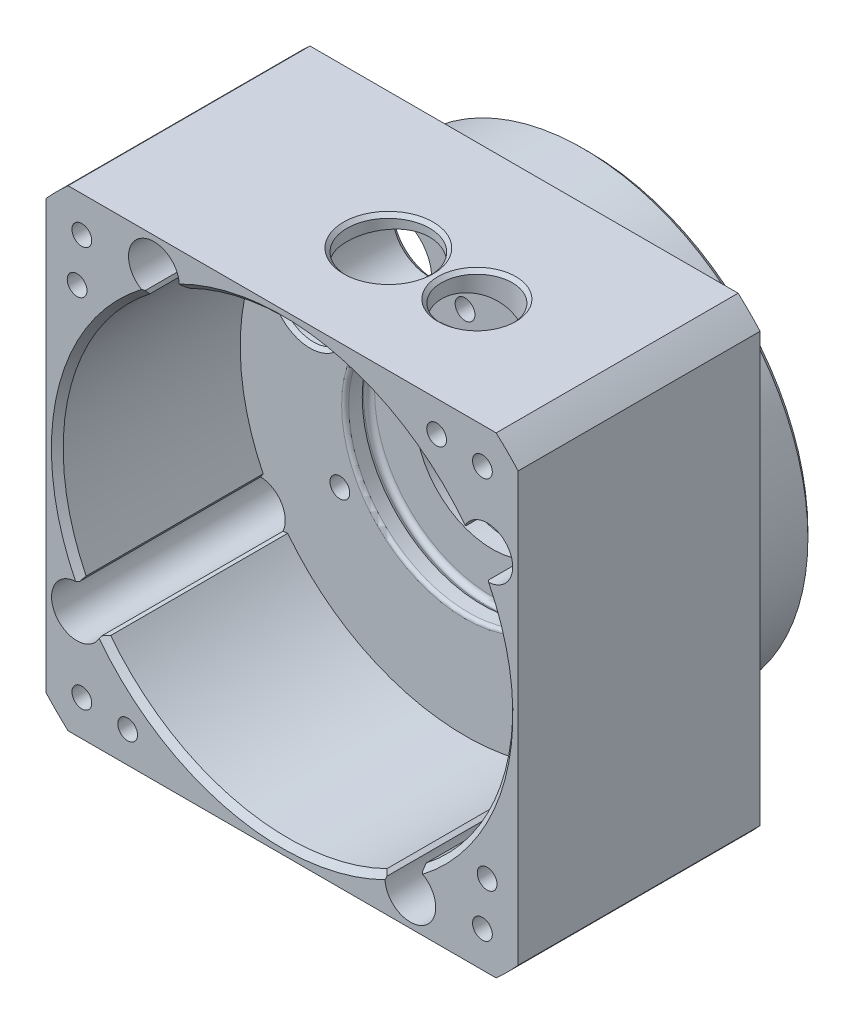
ISO-10303-21;
HEADER;
FILE_DESCRIPTION(('STEP AP214'),'2;1');
FILE_NAME('part.step','',(''),(''),'','','');
FILE_SCHEMA(('AUTOMOTIVE_DESIGN { 1 0 10303 214 1 1 1 1 }'));
ENDSEC;
DATA;
#1=APPLICATION_CONTEXT('core data for automotive mechanical design processes');
#2=APPLICATION_PROTOCOL_DEFINITION('international standard','automotive_design',2000,#1);
#3=PRODUCT_CONTEXT('',#1,'mechanical');
#4=PRODUCT('Part','Part','',(#3));
#5=PRODUCT_RELATED_PRODUCT_CATEGORY('part','',(#4));
#6=PRODUCT_DEFINITION_FORMATION('','',#4);
#7=PRODUCT_DEFINITION_CONTEXT('part definition',#1,'design');
#8=PRODUCT_DEFINITION('design','',#6,#7);
#9=PRODUCT_DEFINITION_SHAPE('','',#8);
#10=(LENGTH_UNIT() NAMED_UNIT(*) SI_UNIT(.MILLI.,.METRE.));
#11=(NAMED_UNIT(*) PLANE_ANGLE_UNIT() SI_UNIT($,.RADIAN.));
#12=(NAMED_UNIT(*) SI_UNIT($,.STERADIAN.) SOLID_ANGLE_UNIT());
#13=UNCERTAINTY_MEASURE_WITH_UNIT(LENGTH_MEASURE(1.E-05),#10,'distance_accuracy_value','');
#14=(GEOMETRIC_REPRESENTATION_CONTEXT(3) GLOBAL_UNCERTAINTY_ASSIGNED_CONTEXT((#13)) GLOBAL_UNIT_ASSIGNED_CONTEXT((#10,
#11,#12)) REPRESENTATION_CONTEXT('',''));
#15=CARTESIAN_POINT('',(0.,0.,0.));
#16=DIRECTION('',(0.,0.,1.));
#17=DIRECTION('',(1.,0.,0.));
#18=AXIS2_PLACEMENT_3D('',#15,#16,#17);
#19=CARTESIAN_POINT('',(0.,0.,1.3));
#20=DIRECTION('',(0.,0.,1.));
#21=DIRECTION('',(1.,0.,0.));
#22=AXIS2_PLACEMENT_3D('',#19,#20,#21);
#23=PLANE('',#22);
#24=CARTESIAN_POINT('',(0.,0.,1.3));
#25=DIRECTION('',(0.,0.,-1.));
#26=DIRECTION('',(-1.,0.,0.));
#27=AXIS2_PLACEMENT_3D('',#24,#25,#26);
#28=CIRCLE('',#27,6.5);
#29=CARTESIAN_POINT('',(-6.5,0.,1.3));
#30=VERTEX_POINT('',#29);
#31=EDGE_CURVE('E21',#30,#30,#28,.F.);
#32=ORIENTED_EDGE('',*,*,#31,.T.);
#33=EDGE_LOOP('',(#32));
#34=FACE_BOUND('',#33,.T.);
#35=CARTESIAN_POINT('',(0.,0.,1.3));
#36=DIRECTION('',(0.,0.,1.));
#37=DIRECTION('',(1.,0.,0.));
#38=AXIS2_PLACEMENT_3D('',#35,#36,#37);
#39=CIRCLE('',#38,9.29999999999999);
#40=CARTESIAN_POINT('',(9.29999999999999,0.,1.3));
#41=VERTEX_POINT('',#40);
#42=EDGE_CURVE('E270',#41,#41,#39,.F.);
#43=ORIENTED_EDGE('',*,*,#42,.T.);
#44=EDGE_LOOP('',(#43));
#45=FACE_BOUND('',#44,.T.);
#46=ADVANCED_FACE('F17',(#34,#45),#23,.F.);
#47=CARTESIAN_POINT('',(0.,0.,0.899999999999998));
#48=DIRECTION('',(0.,0.,1.));
#49=DIRECTION('',(-1.,0.,0.));
#50=AXIS2_PLACEMENT_3D('',#47,#48,#49);
#51=TOROIDAL_SURFACE('',#50,9.29999999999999,0.4);
#52=ORIENTED_EDGE('',*,*,#42,.F.);
#53=EDGE_LOOP('',(#52));
#54=FACE_BOUND('',#53,.T.);
#55=CARTESIAN_POINT('',(0.,0.,0.699999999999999));
#56=DIRECTION('',(0.,0.,1.));
#57=DIRECTION('',(-1.,0.,0.));
#58=AXIS2_PLACEMENT_3D('',#55,#56,#57);
#59=CIRCLE('',#58,9.64641016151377);
#60=CARTESIAN_POINT('',(-9.64641016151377,0.,0.699999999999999));
#61=VERTEX_POINT('',#60);
#62=EDGE_CURVE('E259',#61,#61,#59,.F.);
#63=ORIENTED_EDGE('',*,*,#62,.T.);
#64=EDGE_LOOP('',(#63));
#65=FACE_BOUND('',#64,.T.);
#66=ADVANCED_FACE('F283',(#54,#65),#51,.F.);
#67=CARTESIAN_POINT('',(0.,0.,5.));
#68=DIRECTION('',(0.,0.,-1.));
#69=DIRECTION('',(-1.,0.,0.));
#70=AXIS2_PLACEMENT_3D('',#67,#68,#69);
#71=CYLINDRICAL_SURFACE('',#70,6.5);
#72=ORIENTED_EDGE('',*,*,#31,.F.);
#73=EDGE_LOOP('',(#72));
#74=FACE_BOUND('',#73,.T.);
#75=CARTESIAN_POINT('',(0.,0.,2.7));
#76=DIRECTION('',(0.,0.,-1.));
#77=DIRECTION('',(-1.,0.,0.));
#78=AXIS2_PLACEMENT_3D('',#75,#76,#77);
#79=CIRCLE('',#78,6.5);
#80=CARTESIAN_POINT('',(-6.5,0.,2.7));
#81=VERTEX_POINT('',#80);
#82=EDGE_CURVE('E256',#81,#81,#79,.F.);
#83=ORIENTED_EDGE('',*,*,#82,.T.);
#84=EDGE_LOOP('',(#83));
#85=FACE_BOUND('',#84,.T.);
#86=ADVANCED_FACE('F287',(#74,#85),#71,.F.);
#87=CARTESIAN_POINT('',(0.,0.,0.699999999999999));
#88=DIRECTION('',(0.,0.,1.));
#89=DIRECTION('',(1.,0.,0.));
#90=AXIS2_PLACEMENT_3D('',#87,#88,#89);
#91=CONICAL_SURFACE('',#90,9.64641016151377,0.523598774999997);
#92=ORIENTED_EDGE('',*,*,#62,.F.);
#93=EDGE_LOOP('',(#92));
#94=FACE_BOUND('',#93,.T.);
#95=CARTESIAN_POINT('',(0.,0.,0.446410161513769));
#96=DIRECTION('',(0.,0.,1.));
#97=DIRECTION('',(1.,0.,0.));
#98=AXIS2_PLACEMENT_3D('',#95,#96,#97);
#99=CIRCLE('',#98,9.5);
#100=CARTESIAN_POINT('',(9.5,0.,0.446410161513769));
#101=VERTEX_POINT('',#100);
#102=EDGE_CURVE('E258',#101,#101,#99,.F.);
#103=ORIENTED_EDGE('',*,*,#102,.T.);
#104=EDGE_LOOP('',(#103));
#105=FACE_BOUND('',#104,.T.);
#106=ADVANCED_FACE('F837',(#94,#105),#91,.F.);
#107=CARTESIAN_POINT('',(0.,0.,2.7));
#108=DIRECTION('',(0.,0.,-1.));
#109=DIRECTION('',(-1.,0.,0.));
#110=AXIS2_PLACEMENT_3D('',#107,#108,#109);
#111=PLANE('',#110);
#112=ORIENTED_EDGE('',*,*,#82,.F.);
#113=EDGE_LOOP('',(#112));
#114=FACE_BOUND('',#113,.T.);
#115=CARTESIAN_POINT('',(0.,0.,2.70000000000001));
#116=DIRECTION('',(0.,0.,-1.));
#117=DIRECTION('',(-1.,0.,0.));
#118=AXIS2_PLACEMENT_3D('',#115,#116,#117);
#119=CIRCLE('',#118,9.95999999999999);
#120=CARTESIAN_POINT('',(-9.95999999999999,0.,2.70000000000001));
#121=VERTEX_POINT('',#120);
#122=EDGE_CURVE('E263',#121,#121,#119,.F.);
#123=ORIENTED_EDGE('',*,*,#122,.T.);
#124=EDGE_LOOP('',(#123));
#125=FACE_BOUND('',#124,.T.);
#126=ADVANCED_FACE('F828',(#114,#125),#111,.F.);
#127=CARTESIAN_POINT('',(0.,0.,-5.5));
#128=DIRECTION('',(0.,0.,1.));
#129=DIRECTION('',(1.,0.,0.));
#130=AXIS2_PLACEMENT_3D('',#127,#128,#129);
#131=CYLINDRICAL_SURFACE('',#130,9.5);
#132=CARTESIAN_POINT('',(0.,0.,-4.7));
#133=DIRECTION('',(0.,0.,-1.));
#134=DIRECTION('',(1.,0.,0.));
#135=AXIS2_PLACEMENT_3D('',#132,#133,#134);
#136=CIRCLE('',#135,9.5);
#137=CARTESIAN_POINT('',(9.5,0.,-4.7));
#138=VERTEX_POINT('',#137);
#139=EDGE_CURVE('E805',#138,#138,#136,.F.);
#140=ORIENTED_EDGE('',*,*,#139,.F.);
#141=EDGE_LOOP('',(#140));
#142=FACE_BOUND('',#141,.T.);
#143=ORIENTED_EDGE('',*,*,#102,.F.);
#144=EDGE_LOOP('',(#143));
#145=FACE_BOUND('',#144,.T.);
#146=ADVANCED_FACE('F836',(#142,#145),#131,.F.);
#147=CARTESIAN_POINT('',(0.,0.,3.10000000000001));
#148=DIRECTION('',(0.,0.,-1.));
#149=DIRECTION('',(1.,0.,0.));
#150=AXIS2_PLACEMENT_3D('',#147,#148,#149);
#151=TOROIDAL_SURFACE('',#150,9.95999999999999,0.4);
#152=ORIENTED_EDGE('',*,*,#122,.F.);
#153=EDGE_LOOP('',(#152));
#154=FACE_BOUND('',#153,.T.);
#155=CARTESIAN_POINT('',(0.,0.,3.3));
#156=DIRECTION('',(0.,0.,-1.));
#157=DIRECTION('',(1.,0.,0.));
#158=AXIS2_PLACEMENT_3D('',#155,#156,#157);
#159=CIRCLE('',#158,10.3064101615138);
#160=CARTESIAN_POINT('',(10.3064101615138,0.,3.3));
#161=VERTEX_POINT('',#160);
#162=EDGE_CURVE('E761',#161,#161,#159,.F.);
#163=ORIENTED_EDGE('',*,*,#162,.T.);
#164=EDGE_LOOP('',(#163));
#165=FACE_BOUND('',#164,.T.);
#166=ADVANCED_FACE('F794',(#154,#165),#151,.F.);
#167=CARTESIAN_POINT('',(0.,0.,-4.7));
#168=DIRECTION('',(0.,0.,-1.));
#169=DIRECTION('',(1.,0.,0.));
#170=AXIS2_PLACEMENT_3D('',#167,#168,#169);
#171=TOROIDAL_SURFACE('',#170,10.3,0.8);
#172=CARTESIAN_POINT('',(0.,0.,-5.5));
#173=DIRECTION('',(0.,0.,-1.));
#174=DIRECTION('',(-1.,0.,0.));
#175=AXIS2_PLACEMENT_3D('',#172,#173,#174);
#176=CIRCLE('',#175,10.3);
#177=CARTESIAN_POINT('',(-10.3,0.,-5.5));
#178=VERTEX_POINT('',#177);
#179=EDGE_CURVE('E248',#178,#178,#176,.F.);
#180=ORIENTED_EDGE('',*,*,#179,.F.);
#181=EDGE_LOOP('',(#180));
#182=FACE_BOUND('',#181,.T.);
#183=ORIENTED_EDGE('',*,*,#139,.T.);
#184=EDGE_LOOP('',(#183));
#185=FACE_BOUND('',#184,.T.);
#186=ADVANCED_FACE('F789',(#182,#185),#171,.T.);
#187=CARTESIAN_POINT('',(0.,0.,-5.49999999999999));
#188=DIRECTION('',(0.,0.,-1.));
#189=DIRECTION('',(0.,1.,0.));
#190=AXIS2_PLACEMENT_3D('',#187,#188,#189);
#191=CONICAL_SURFACE('',#190,18.,0.785398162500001);
#192=CARTESIAN_POINT('',(0.,0.,-5.49999999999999));
#193=DIRECTION('',(0.,0.,-1.));
#194=DIRECTION('',(0.,1.,0.));
#195=AXIS2_PLACEMENT_3D('',#192,#193,#194);
#196=CIRCLE('',#195,18.);
#197=CARTESIAN_POINT('',(-7.60712871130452,16.3135401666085,-5.49999999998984));
#198=VERTEX_POINT('',#197);
#199=CARTESIAN_POINT('',(-16.3135401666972,7.60712871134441,-5.49999999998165));
#200=VERTEX_POINT('',#199);
#201=EDGE_CURVE('E252',#198,#200,#196,.F.);
#202=ORIENTED_EDGE('',*,*,#201,.F.);
#203=DIRECTION('',(0.298836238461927,-0.640856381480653,0.707106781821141));
#204=VECTOR('',#203,1.);
#205=CARTESIAN_POINT('',(-210891.794958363,452258.913766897,-499000.));
#206=LINE('',#205,#204);
#207=CARTESIAN_POINT('',(-7.39581958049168,15.8603862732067,-4.99999999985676));
#208=VERTEX_POINT('',#207);
#209=EDGE_CURVE('E239',#198,#208,#206,.T.);
#210=ORIENTED_EDGE('',*,*,#209,.T.);
#211=CARTESIAN_POINT('',(0.,0.,-5.));
#212=DIRECTION('',(0.,0.,-1.));
#213=DIRECTION('',(-1.,0.,0.));
#214=AXIS2_PLACEMENT_3D('',#211,#212,#213);
#215=CIRCLE('',#214,17.5);
#216=CARTESIAN_POINT('',(-15.8603862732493,7.39581958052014,-4.99999999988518));
#217=VERTEX_POINT('',#216);
#218=EDGE_CURVE('E1563',#208,#217,#215,.F.);
#219=ORIENTED_EDGE('',*,*,#218,.T.);
#220=DIRECTION('',(0.640856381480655,-0.298836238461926,0.707106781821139));
#221=VECTOR('',#220,1.);
#222=CARTESIAN_POINT('',(-452258.913766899,210891.794958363,-499000.));
#223=LINE('',#222,#221);
#224=EDGE_CURVE('E1547',#217,#200,#223,.F.);
#225=ORIENTED_EDGE('',*,*,#224,.T.);
#226=EDGE_LOOP('',(#202,#210,#219,#225));
#227=FACE_BOUND('',#226,.T.);
#228=ADVANCED_FACE('F786',(#227),#191,.F.);
#229=CARTESIAN_POINT('',(-6.12796479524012,13.1414629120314,-5.49999999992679));
#230=DIRECTION('',(0.,0.,-1.));
#231=DIRECTION('',(-1.,0.,0.));
#232=AXIS2_PLACEMENT_3D('',#229,#230,#231);
#233=CONICAL_SURFACE('',#232,3.49999999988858,0.785398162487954);
#234=CARTESIAN_POINT('',(-6.12796479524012,13.1414629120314,-5.));
#235=DIRECTION('',(0.,0.,-1.));
#236=DIRECTION('',(-1.,0.,0.));
#237=AXIS2_PLACEMENT_3D('',#234,#235,#236);
#238=CIRCLE('',#237,3.);
#239=CARTESIAN_POINT('',(-4.86011001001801,10.4225395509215,-5.));
#240=VERTEX_POINT('',#239);
#241=EDGE_CURVE('E751',#240,#208,#238,.F.);
#242=ORIENTED_EDGE('',*,*,#241,.T.);
#243=ORIENTED_EDGE('',*,*,#209,.F.);
#244=CARTESIAN_POINT('',(-6.12796479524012,13.1414629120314,-5.49999999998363));
#245=DIRECTION('',(0.,0.,-1.));
#246=DIRECTION('',(-1.,0.,0.));
#247=AXIS2_PLACEMENT_3D('',#244,#245,#246);
#248=CIRCLE('',#247,3.49999999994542);
#249=CARTESIAN_POINT('',(-4.64880087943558,9.96938565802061,-5.50000000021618));
#250=VERTEX_POINT('',#249);
#251=EDGE_CURVE('E245',#250,#198,#248,.F.);
#252=ORIENTED_EDGE('',*,*,#251,.F.);
#253=DIRECTION('',(0.298836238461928,-0.640856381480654,-0.707106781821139));
#254=VECTOR('',#253,1.);
#255=CARTESIAN_POINT('',(-4.86011001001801,10.4225395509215,-5.));
#256=LINE('',#255,#254);
#257=EDGE_CURVE('E229',#240,#250,#256,.T.);
#258=ORIENTED_EDGE('',*,*,#257,.F.);
#259=EDGE_LOOP('',(#242,#243,#252,#258));
#260=FACE_BOUND('',#259,.T.);
#261=ADVANCED_FACE('F250',(#260),#233,.F.);
#262=CARTESIAN_POINT('',(0.,0.,-4.99999999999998));
#263=DIRECTION('',(0.,0.,1.));
#264=DIRECTION('',(0.,-1.,0.));
#265=AXIS2_PLACEMENT_3D('',#262,#263,#264);
#266=CONICAL_SURFACE('',#265,11.5,0.7853981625);
#267=ORIENTED_EDGE('',*,*,#257,.T.);
#268=CARTESIAN_POINT('',(0.,0.,-5.50000000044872));
#269=DIRECTION('',(0.,0.,1.));
#270=DIRECTION('',(0.,-1.,0.));
#271=AXIS2_PLACEMENT_3D('',#268,#269,#270);
#272=CIRCLE('',#271,11.0000000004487);
#273=CARTESIAN_POINT('',(-9.96938565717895,4.64880087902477,-5.5000000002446));
#274=VERTEX_POINT('',#273);
#275=EDGE_CURVE('E232',#274,#250,#272,.F.);
#276=ORIENTED_EDGE('',*,*,#275,.F.);
#277=DIRECTION('',(-0.640856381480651,0.298836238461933,0.707106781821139));
#278=VECTOR('',#277,1.);
#279=CARTESIAN_POINT('',(452232.630841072,-210879.539028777,-499000.));
#280=LINE('',#279,#278);
#281=CARTESIAN_POINT('',(-10.4225395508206,4.86011000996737,-4.99999999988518));
#282=VERTEX_POINT('',#281);
#283=EDGE_CURVE('E222',#274,#282,#280,.T.);
#284=ORIENTED_EDGE('',*,*,#283,.T.);
#285=CARTESIAN_POINT('',(0.,0.,-5.));
#286=DIRECTION('',(0.,0.,-1.));
#287=DIRECTION('',(-1.,0.,0.));
#288=AXIS2_PLACEMENT_3D('',#285,#286,#287);
#289=CIRCLE('',#288,11.5);
#290=EDGE_CURVE('E235',#240,#282,#289,.F.);
#291=ORIENTED_EDGE('',*,*,#290,.F.);
#292=EDGE_LOOP('',(#267,#276,#284,#291));
#293=FACE_BOUND('',#292,.T.);
#294=ADVANCED_FACE('F231',(#293),#266,.T.);
#295=CARTESIAN_POINT('',(-13.1414629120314,6.12796479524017,-5.49999999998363));
#296=DIRECTION('',(0.,0.,-1.));
#297=DIRECTION('',(-1.,0.,0.));
#298=AXIS2_PLACEMENT_3D('',#295,#296,#297);
#299=CONICAL_SURFACE('',#298,3.50000000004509,0.785398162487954);
#300=CARTESIAN_POINT('',(-13.1414629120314,6.12796479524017,-5.));
#301=DIRECTION('',(0.,0.,-1.));
#302=DIRECTION('',(-1.,0.,0.));
#303=AXIS2_PLACEMENT_3D('',#300,#301,#302);
#304=CIRCLE('',#303,3.);
#305=EDGE_CURVE('E728',#217,#282,#304,.F.);
#306=ORIENTED_EDGE('',*,*,#305,.T.);
#307=ORIENTED_EDGE('',*,*,#283,.F.);
#308=CARTESIAN_POINT('',(-13.1414629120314,6.12796479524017,-5.49999999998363));
#309=DIRECTION('',(0.,0.,-1.));
#310=DIRECTION('',(-1.,0.,0.));
#311=AXIS2_PLACEMENT_3D('',#308,#309,#310);
#312=CIRCLE('',#311,3.50000000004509);
#313=EDGE_CURVE('E247',#200,#274,#312,.F.);
#314=ORIENTED_EDGE('',*,*,#313,.F.);
#315=ORIENTED_EDGE('',*,*,#224,.F.);
#316=EDGE_LOOP('',(#306,#307,#314,#315));
#317=FACE_BOUND('',#316,.T.);
#318=ADVANCED_FACE('F778',(#317),#299,.F.);
#319=CARTESIAN_POINT('',(0.,0.,3.3));
#320=DIRECTION('',(0.,0.,-1.));
#321=DIRECTION('',(0.,1.,0.));
#322=AXIS2_PLACEMENT_3D('',#319,#320,#321);
#323=CONICAL_SURFACE('',#322,10.3064101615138,0.523598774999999);
#324=ORIENTED_EDGE('',*,*,#162,.F.);
#325=EDGE_LOOP('',(#324));
#326=FACE_BOUND('',#325,.T.);
#327=CARTESIAN_POINT('',(0.,0.,3.55358983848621));
#328=DIRECTION('',(0.,0.,-1.));
#329=DIRECTION('',(-1.,0.,0.));
#330=AXIS2_PLACEMENT_3D('',#327,#328,#329);
#331=CIRCLE('',#330,10.16);
#332=CARTESIAN_POINT('',(-10.16,0.,3.55358983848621));
#333=VERTEX_POINT('',#332);
#334=EDGE_CURVE('E711',#333,#333,#331,.F.);
#335=ORIENTED_EDGE('',*,*,#334,.T.);
#336=EDGE_LOOP('',(#335));
#337=FACE_BOUND('',#336,.T.);
#338=ADVANCED_FACE('F773',(#326,#337),#323,.F.);
#339=CARTESIAN_POINT('',(0.,0.,-5.5));
#340=DIRECTION('',(0.,0.,-1.));
#341=DIRECTION('',(-1.,0.,0.));
#342=AXIS2_PLACEMENT_3D('',#339,#340,#341);
#343=PLANE('',#342);
#344=CARTESIAN_POINT('',(0.,0.,-5.5));
#345=DIRECTION('',(0.,0.,1.));
#346=DIRECTION('',(1.,0.,0.));
#347=AXIS2_PLACEMENT_3D('',#344,#345,#346);
#348=CIRCLE('',#347,18.55);
#349=CARTESIAN_POINT('',(18.55,0.,-5.5));
#350=VERTEX_POINT('',#349);
#351=EDGE_CURVE('E708',#350,#350,#348,.T.);
#352=ORIENTED_EDGE('',*,*,#351,.F.);
#353=EDGE_LOOP('',(#352));
#354=FACE_BOUND('',#353,.T.);
#355=ORIENTED_EDGE('',*,*,#201,.T.);
#356=ORIENTED_EDGE('',*,*,#313,.T.);
#357=ORIENTED_EDGE('',*,*,#275,.T.);
#358=ORIENTED_EDGE('',*,*,#251,.T.);
#359=EDGE_LOOP('',(#355,#356,#357,#358));
#360=FACE_BOUND('',#359,.T.);
#361=ORIENTED_EDGE('',*,*,#179,.T.);
#362=EDGE_LOOP('',(#361));
#363=FACE_BOUND('',#362,.T.);
#364=ADVANCED_FACE('F243',(#354,#360,#363),#343,.T.);
#365=CARTESIAN_POINT('',(7.28638988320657,-11.6606613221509,-3.00000000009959));
#366=DIRECTION('',(0.,0.,1.));
#367=DIRECTION('',(1.,0.,0.));
#368=AXIS2_PLACEMENT_3D('',#365,#366,#367);
#369=CONICAL_SURFACE('',#368,1.29704999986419,1.02974425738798);
#370=CARTESIAN_POINT('',(7.28638988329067,-11.6606613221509,-3.77934626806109));
#371=VERTEX_POINT('',#370);
#372=VERTEX_LOOP('',#371);
#373=FACE_BOUND('',#372,.T.);
#374=CARTESIAN_POINT('',(7.28638988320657,-11.6606613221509,-3.));
#375=DIRECTION('',(0.,0.,-1.));
#376=DIRECTION('',(-1.,0.,0.));
#377=AXIS2_PLACEMENT_3D('',#374,#375,#376);
#378=CIRCLE('',#377,1.29705);
#379=CARTESIAN_POINT('',(5.98933988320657,-11.6606613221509,-3.));
#380=VERTEX_POINT('',#379);
#381=EDGE_CURVE('E703',#380,#380,#378,.F.);
#382=ORIENTED_EDGE('',*,*,#381,.T.);
#383=EDGE_LOOP('',(#382));
#384=FACE_BOUND('',#383,.T.);
#385=ADVANCED_FACE('F772',(#373,#384),#369,.F.);
#386=CARTESIAN_POINT('',(10.6088111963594,-6.125,-5.6843418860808E-11));
#387=DIRECTION('',(0.,0.,1.));
#388=DIRECTION('',(1.,0.,0.));
#389=AXIS2_PLACEMENT_3D('',#386,#387,#388);
#390=CONICAL_SURFACE('',#389,0.8375999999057,1.02974425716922);
#391=CARTESIAN_POINT('',(10.6088111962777,-6.12500000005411,-0.503280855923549));
#392=VERTEX_POINT('',#391);
#393=VERTEX_LOOP('',#392);
#394=FACE_BOUND('',#393,.T.);
#395=CARTESIAN_POINT('',(10.6088111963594,-6.125,0.));
#396=DIRECTION('',(0.,0.,-1.));
#397=DIRECTION('',(-1.,0.,0.));
#398=AXIS2_PLACEMENT_3D('',#395,#396,#397);
#399=CIRCLE('',#398,0.8376);
#400=CARTESIAN_POINT('',(9.7712111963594,-6.125,0.));
#401=VERTEX_POINT('',#400);
#402=EDGE_CURVE('E698',#401,#401,#399,.F.);
#403=ORIENTED_EDGE('',*,*,#402,.T.);
#404=EDGE_LOOP('',(#403));
#405=FACE_BOUND('',#404,.T.);
#406=ADVANCED_FACE('F1455',(#394,#405),#390,.F.);
#407=CARTESIAN_POINT('',(-10.6088111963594,-6.125,-5.6843418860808E-11));
#408=DIRECTION('',(0.,0.,1.));
#409=DIRECTION('',(1.,0.,0.));
#410=AXIS2_PLACEMENT_3D('',#407,#408,#409);
#411=CONICAL_SURFACE('',#410,0.837599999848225,1.02974425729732);
#412=CARTESIAN_POINT('',(-10.6088111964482,-6.12499999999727,-0.503280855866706));
#413=VERTEX_POINT('',#412);
#414=VERTEX_LOOP('',#413);
#415=FACE_BOUND('',#414,.T.);
#416=CARTESIAN_POINT('',(-10.6088111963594,-6.125,0.));
#417=DIRECTION('',(0.,0.,-1.));
#418=DIRECTION('',(-1.,0.,0.));
#419=AXIS2_PLACEMENT_3D('',#416,#417,#418);
#420=CIRCLE('',#419,0.8376);
#421=CARTESIAN_POINT('',(-11.4464111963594,-6.125,0.));
#422=VERTEX_POINT('',#421);
#423=EDGE_CURVE('E693',#422,#422,#420,.F.);
#424=ORIENTED_EDGE('',*,*,#423,.T.);
#425=EDGE_LOOP('',(#424));
#426=FACE_BOUND('',#425,.T.);
#427=ADVANCED_FACE('F1401',(#415,#426),#411,.F.);
#428=CARTESIAN_POINT('',(0.,12.25,-5.6843418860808E-11));
#429=DIRECTION('',(0.,0.,1.));
#430=DIRECTION('',(1.,0.,0.));
#431=AXIS2_PLACEMENT_3D('',#428,#429,#430);
#432=CONICAL_SURFACE('',#431,0.837599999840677,1.02974425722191);
#433=CARTESIAN_POINT('',(1.13686837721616E-10,12.25,-0.503280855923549));
#434=VERTEX_POINT('',#433);
#435=VERTEX_LOOP('',#434);
#436=FACE_BOUND('',#435,.T.);
#437=CARTESIAN_POINT('',(0.,12.25,0.));
#438=DIRECTION('',(0.,0.,-1.));
#439=DIRECTION('',(-1.,0.,0.));
#440=AXIS2_PLACEMENT_3D('',#437,#438,#439);
#441=CIRCLE('',#440,0.8376);
#442=CARTESIAN_POINT('',(-0.8376,12.25,0.));
#443=VERTEX_POINT('',#442);
#444=EDGE_CURVE('E689',#443,#443,#441,.F.);
#445=ORIENTED_EDGE('',*,*,#444,.T.);
#446=EDGE_LOOP('',(#445));
#447=FACE_BOUND('',#446,.T.);
#448=ADVANCED_FACE('F1397',(#436,#447),#432,.F.);
#449=CARTESIAN_POINT('',(0.,0.,7.5));
#450=DIRECTION('',(0.,0.,-1.));
#451=DIRECTION('',(-1.,0.,0.));
#452=AXIS2_PLACEMENT_3D('',#449,#450,#451);
#453=CYLINDRICAL_SURFACE('',#452,17.5);
#454=CARTESIAN_POINT('',(0.,0.,4.69999999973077));
#455=DIRECTION('',(0.,0.,1.));
#456=DIRECTION('',(-1.,0.,0.));
#457=AXIS2_PLACEMENT_3D('',#454,#455,#456);
#458=CIRCLE('',#457,17.5000000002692);
#459=CARTESIAN_POINT('',(-7.39581958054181,15.8603862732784,4.69999999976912));
#460=VERTEX_POINT('',#459);
#461=CARTESIAN_POINT('',(-15.8603862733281,7.39581958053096,4.69999999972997));
#462=VERTEX_POINT('',#461);
#463=EDGE_CURVE('E692',#460,#462,#458,.T.);
#464=ORIENTED_EDGE('',*,*,#463,.T.);
#465=DIRECTION('',(0.,0.,-1.));
#466=VECTOR('',#465,1.);
#467=CARTESIAN_POINT('',(-15.8603862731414,7.39581958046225,7.5));
#468=LINE('',#467,#466);
#469=EDGE_CURVE('E714',#462,#217,#468,.T.);
#470=ORIENTED_EDGE('',*,*,#469,.T.);
#471=ORIENTED_EDGE('',*,*,#218,.F.);
#472=DIRECTION('',(0.,0.,-1.));
#473=VECTOR('',#472,1.);
#474=CARTESIAN_POINT('',(-7.39581958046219,15.8603862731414,7.5));
#475=LINE('',#474,#473);
#476=EDGE_CURVE('E742',#208,#460,#475,.F.);
#477=ORIENTED_EDGE('',*,*,#476,.T.);
#478=EDGE_LOOP('',(#464,#470,#471,#477));
#479=FACE_BOUND('',#478,.T.);
#480=ADVANCED_FACE('F1400',(#479),#453,.F.);
#481=CARTESIAN_POINT('',(-6.12796479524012,13.1414629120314,7.5));
#482=DIRECTION('',(0.,0.,-1.));
#483=DIRECTION('',(-1.,0.,0.));
#484=AXIS2_PLACEMENT_3D('',#481,#482,#483);
#485=CYLINDRICAL_SURFACE('',#484,3.);
#486=CARTESIAN_POINT('',(-6.12796479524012,13.1414629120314,4.6999999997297));
#487=DIRECTION('',(0.,0.,1.));
#488=DIRECTION('',(-1.,0.,0.));
#489=AXIS2_PLACEMENT_3D('',#486,#487,#488);
#490=CIRCLE('',#489,3.00000000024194);
#491=CARTESIAN_POINT('',(-4.86011000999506,10.4225395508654,4.69999999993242));
#492=VERTEX_POINT('',#491);
#493=EDGE_CURVE('E686',#492,#460,#490,.T.);
#494=ORIENTED_EDGE('',*,*,#493,.T.);
#495=ORIENTED_EDGE('',*,*,#476,.F.);
#496=ORIENTED_EDGE('',*,*,#241,.F.);
#497=DIRECTION('',(0.,0.,-1.));
#498=VECTOR('',#497,1.);
#499=CARTESIAN_POINT('',(-4.86011001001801,10.4225395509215,7.5));
#500=LINE('',#499,#498);
#501=EDGE_CURVE('E739',#492,#240,#500,.T.);
#502=ORIENTED_EDGE('',*,*,#501,.F.);
#503=EDGE_LOOP('',(#494,#495,#496,#502));
#504=FACE_BOUND('',#503,.T.);
#505=ADVANCED_FACE('F1446',(#504),#485,.F.);
#506=CARTESIAN_POINT('',(0.,0.,7.5));
#507=DIRECTION('',(0.,0.,-1.));
#508=DIRECTION('',(-1.,0.,0.));
#509=AXIS2_PLACEMENT_3D('',#506,#507,#508);
#510=CYLINDRICAL_SURFACE('',#509,11.5);
#511=ORIENTED_EDGE('',*,*,#501,.T.);
#512=ORIENTED_EDGE('',*,*,#290,.T.);
#513=DIRECTION('',(0.,0.,-1.));
#514=VECTOR('',#513,1.);
#515=CARTESIAN_POINT('',(-10.4225395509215,4.86011001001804,7.5));
#516=LINE('',#515,#514);
#517=CARTESIAN_POINT('',(-10.4225395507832,4.86011000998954,4.69999999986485));
#518=VERTEX_POINT('',#517);
#519=EDGE_CURVE('E725',#282,#518,#516,.F.);
#520=ORIENTED_EDGE('',*,*,#519,.T.);
#521=CARTESIAN_POINT('',(0.,0.,4.69999999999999));
#522=DIRECTION('',(0.,0.,-1.));
#523=DIRECTION('',(1.,0.,0.));
#524=AXIS2_PLACEMENT_3D('',#521,#522,#523);
#525=CIRCLE('',#524,11.5);
#526=EDGE_CURVE('E675',#492,#518,#525,.F.);
#527=ORIENTED_EDGE('',*,*,#526,.F.);
#528=EDGE_LOOP('',(#511,#512,#520,#527));
#529=FACE_BOUND('',#528,.T.);
#530=ADVANCED_FACE('F1442',(#529),#510,.T.);
#531=CARTESIAN_POINT('',(-13.1414629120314,6.12796479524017,7.5));
#532=DIRECTION('',(0.,0.,-1.));
#533=DIRECTION('',(-1.,0.,0.));
#534=AXIS2_PLACEMENT_3D('',#531,#532,#533);
#535=CYLINDRICAL_SURFACE('',#534,3.);
#536=CARTESIAN_POINT('',(-13.1414629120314,6.12796479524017,4.69999999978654));
#537=DIRECTION('',(0.,0.,1.));
#538=DIRECTION('',(-1.,0.,0.));
#539=AXIS2_PLACEMENT_3D('',#536,#537,#538);
#540=CIRCLE('',#539,3.00000000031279);
#541=EDGE_CURVE('E669',#462,#518,#540,.T.);
#542=ORIENTED_EDGE('',*,*,#541,.T.);
#543=ORIENTED_EDGE('',*,*,#519,.F.);
#544=ORIENTED_EDGE('',*,*,#305,.F.);
#545=ORIENTED_EDGE('',*,*,#469,.F.);
#546=EDGE_LOOP('',(#542,#543,#544,#545));
#547=FACE_BOUND('',#546,.T.);
#548=ADVANCED_FACE('F1438',(#547),#535,.F.);
#549=CARTESIAN_POINT('',(0.,0.,20.5));
#550=DIRECTION('',(0.,0.,-1.));
#551=DIRECTION('',(-1.,0.,0.));
#552=AXIS2_PLACEMENT_3D('',#549,#550,#551);
#553=CYLINDRICAL_SURFACE('',#552,10.16);
#554=CARTESIAN_POINT('',(0.,0.,4.7));
#555=DIRECTION('',(0.,0.,1.));
#556=DIRECTION('',(-1.,0.,0.));
#557=AXIS2_PLACEMENT_3D('',#554,#555,#556);
#558=CIRCLE('',#557,10.16);
#559=CARTESIAN_POINT('',(-10.16,0.,4.7));
#560=VERTEX_POINT('',#559);
#561=EDGE_CURVE('E629',#560,#560,#558,.F.);
#562=ORIENTED_EDGE('',*,*,#561,.F.);
#563=EDGE_LOOP('',(#562));
#564=FACE_BOUND('',#563,.T.);
#565=ORIENTED_EDGE('',*,*,#334,.F.);
#566=EDGE_LOOP('',(#565));
#567=FACE_BOUND('',#566,.T.);
#568=ADVANCED_FACE('F1434',(#564,#567),#553,.F.);
#569=CARTESIAN_POINT('',(0.,0.,-4.99999999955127));
#570=DIRECTION('',(0.,0.,1.));
#571=DIRECTION('',(1.,0.,0.));
#572=AXIS2_PLACEMENT_3D('',#569,#570,#571);
#573=CONICAL_SURFACE('',#572,19.0499999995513,0.7853981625);
#574=ORIENTED_EDGE('',*,*,#351,.T.);
#575=EDGE_LOOP('',(#574));
#576=FACE_BOUND('',#575,.T.);
#577=CARTESIAN_POINT('',(0.,0.,-5.));
#578=DIRECTION('',(0.,0.,-1.));
#579=DIRECTION('',(-1.,0.,0.));
#580=AXIS2_PLACEMENT_3D('',#577,#578,#579);
#581=CIRCLE('',#580,19.05);
#582=CARTESIAN_POINT('',(-19.05,0.,-5.));
#583=VERTEX_POINT('',#582);
#584=EDGE_CURVE('E626',#583,#583,#581,.F.);
#585=ORIENTED_EDGE('',*,*,#584,.F.);
#586=EDGE_LOOP('',(#585));
#587=FACE_BOUND('',#586,.T.);
#588=ADVANCED_FACE('F1430',(#576,#587),#573,.T.);
#589=CARTESIAN_POINT('',(7.28638988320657,-11.6606613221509,5.));
#590=DIRECTION('',(0.,0.,-1.));
#591=DIRECTION('',(-1.,0.,0.));
#592=AXIS2_PLACEMENT_3D('',#589,#590,#591);
#593=CYLINDRICAL_SURFACE('',#592,1.29705);
#594=CARTESIAN_POINT('',(7.28638988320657,-11.6606613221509,5.));
#595=DIRECTION('',(0.,0.,-1.));
#596=DIRECTION('',(-1.,0.,0.));
#597=AXIS2_PLACEMENT_3D('',#594,#595,#596);
#598=CIRCLE('',#597,1.29705);
#599=CARTESIAN_POINT('',(5.98933988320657,-11.6606613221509,5.));
#600=VERTEX_POINT('',#599);
#601=EDGE_CURVE('E1111',#600,#600,#598,.T.);
#602=ORIENTED_EDGE('',*,*,#601,.F.);
#603=EDGE_LOOP('',(#602));
#604=FACE_BOUND('',#603,.T.);
#605=ORIENTED_EDGE('',*,*,#381,.F.);
#606=EDGE_LOOP('',(#605));
#607=FACE_BOUND('',#606,.T.);
#608=ADVANCED_FACE('F1426',(#604,#607),#593,.F.);
#609=CARTESIAN_POINT('',(10.6088111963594,-6.125,5.));
#610=DIRECTION('',(0.,0.,-1.));
#611=DIRECTION('',(-1.,0.,0.));
#612=AXIS2_PLACEMENT_3D('',#609,#610,#611);
#613=CYLINDRICAL_SURFACE('',#612,0.8376);
#614=CARTESIAN_POINT('',(10.6088111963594,-6.125,5.));
#615=DIRECTION('',(0.,0.,-1.));
#616=DIRECTION('',(-1.,0.,0.));
#617=AXIS2_PLACEMENT_3D('',#614,#615,#616);
#618=CIRCLE('',#617,0.8376);
#619=CARTESIAN_POINT('',(9.7712111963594,-6.125,5.));
#620=VERTEX_POINT('',#619);
#621=EDGE_CURVE('E1142',#620,#620,#618,.T.);
#622=ORIENTED_EDGE('',*,*,#621,.F.);
#623=EDGE_LOOP('',(#622));
#624=FACE_BOUND('',#623,.T.);
#625=ORIENTED_EDGE('',*,*,#402,.F.);
#626=EDGE_LOOP('',(#625));
#627=FACE_BOUND('',#626,.T.);
#628=ADVANCED_FACE('F1418',(#624,#627),#613,.F.);
#629=CARTESIAN_POINT('',(-10.6088111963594,-6.125,5.));
#630=DIRECTION('',(0.,0.,-1.));
#631=DIRECTION('',(-1.,0.,0.));
#632=AXIS2_PLACEMENT_3D('',#629,#630,#631);
#633=CYLINDRICAL_SURFACE('',#632,0.8376);
#634=CARTESIAN_POINT('',(-10.6088111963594,-6.125,5.));
#635=DIRECTION('',(0.,0.,-1.));
#636=DIRECTION('',(-1.,0.,0.));
#637=AXIS2_PLACEMENT_3D('',#634,#635,#636);
#638=CIRCLE('',#637,0.8376);
#639=CARTESIAN_POINT('',(-11.4464111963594,-6.125,5.));
#640=VERTEX_POINT('',#639);
#641=EDGE_CURVE('E1144',#640,#640,#638,.T.);
#642=ORIENTED_EDGE('',*,*,#641,.F.);
#643=EDGE_LOOP('',(#642));
#644=FACE_BOUND('',#643,.T.);
#645=ORIENTED_EDGE('',*,*,#423,.F.);
#646=EDGE_LOOP('',(#645));
#647=FACE_BOUND('',#646,.T.);
#648=ADVANCED_FACE('F1408',(#644,#647),#633,.F.);
#649=CARTESIAN_POINT('',(0.,12.25,5.));
#650=DIRECTION('',(0.,0.,-1.));
#651=DIRECTION('',(-1.,0.,0.));
#652=AXIS2_PLACEMENT_3D('',#649,#650,#651);
#653=CYLINDRICAL_SURFACE('',#652,0.8376);
#654=CARTESIAN_POINT('',(0.,12.25,5.));
#655=DIRECTION('',(0.,0.,-1.));
#656=DIRECTION('',(-1.,0.,0.));
#657=AXIS2_PLACEMENT_3D('',#654,#655,#656);
#658=CIRCLE('',#657,0.8376);
#659=CARTESIAN_POINT('',(-0.8376,12.25,5.));
#660=VERTEX_POINT('',#659);
#661=EDGE_CURVE('E1148',#660,#660,#658,.T.);
#662=ORIENTED_EDGE('',*,*,#661,.F.);
#663=EDGE_LOOP('',(#662));
#664=FACE_BOUND('',#663,.T.);
#665=ORIENTED_EDGE('',*,*,#444,.F.);
#666=EDGE_LOOP('',(#665));
#667=FACE_BOUND('',#666,.T.);
#668=ADVANCED_FACE('F1405',(#664,#667),#653,.F.);
#669=CARTESIAN_POINT('',(0.,0.,5.00000000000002));
#670=DIRECTION('',(0.,0.,1.));
#671=DIRECTION('',(1.,0.,0.));
#672=AXIS2_PLACEMENT_3D('',#669,#670,#671);
#673=CONICAL_SURFACE('',#672,17.8,0.785398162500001);
#674=ORIENTED_EDGE('',*,*,#463,.F.);
#675=DIRECTION('',(0.298836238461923,-0.640856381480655,-0.707106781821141));
#676=VECTOR('',#675,1.);
#677=CARTESIAN_POINT('',(-210890.05078357,452255.17337199,498995.572930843));
#678=LINE('',#677,#676);
#679=CARTESIAN_POINT('',(-7.52260505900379,16.1322786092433,4.99999999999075));
#680=VERTEX_POINT('',#679);
#681=EDGE_CURVE('E681',#460,#680,#678,.F.);
#682=ORIENTED_EDGE('',*,*,#681,.T.);
#683=CARTESIAN_POINT('',(0.,0.,5.00000000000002));
#684=DIRECTION('',(0.,0.,1.));
#685=DIRECTION('',(1.,0.,0.));
#686=AXIS2_PLACEMENT_3D('',#683,#684,#685);
#687=CIRCLE('',#686,17.8);
#688=CARTESIAN_POINT('',(-16.1322786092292,7.52260505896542,4.99999999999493));
#689=VERTEX_POINT('',#688);
#690=EDGE_CURVE('E1153',#689,#680,#687,.F.);
#691=ORIENTED_EDGE('',*,*,#690,.F.);
#692=DIRECTION('',(0.640856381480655,-0.298836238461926,-0.707106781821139));
#693=VECTOR('',#692,1.);
#694=CARTESIAN_POINT('',(-452248.816984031,210887.086751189,498988.559432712));
#695=LINE('',#694,#693);
#696=EDGE_CURVE('E672',#689,#462,#695,.T.);
#697=ORIENTED_EDGE('',*,*,#696,.T.);
#698=EDGE_LOOP('',(#674,#682,#691,#697));
#699=FACE_BOUND('',#698,.T.);
#700=ADVANCED_FACE('F1407',(#699),#673,.F.);
#701=CARTESIAN_POINT('',(-6.12796479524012,13.1414629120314,4.99999999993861));
#702=DIRECTION('',(0.,0.,1.));
#703=DIRECTION('',(1.,0.,0.));
#704=AXIS2_PLACEMENT_3D('',#701,#702,#703);
#705=CONICAL_SURFACE('',#704,3.2999999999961,0.785398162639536);
#706=ORIENTED_EDGE('',*,*,#493,.F.);
#707=DIRECTION('',(0.298836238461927,-0.640856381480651,0.707106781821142));
#708=VECTOR('',#707,1.);
#709=CARTESIAN_POINT('',(-4.86011001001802,10.4225395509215,4.7));
#710=LINE('',#709,#708);
#711=CARTESIAN_POINT('',(-4.73332453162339,10.1506472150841,4.99999999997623));
#712=VERTEX_POINT('',#711);
#713=EDGE_CURVE('E678',#712,#492,#710,.F.);
#714=ORIENTED_EDGE('',*,*,#713,.F.);
#715=CARTESIAN_POINT('',(-6.12796479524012,13.1414629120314,4.99999999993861));
#716=DIRECTION('',(0.,0.,1.));
#717=DIRECTION('',(1.,0.,0.));
#718=AXIS2_PLACEMENT_3D('',#715,#716,#717);
#719=CIRCLE('',#718,3.2999999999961);
#720=EDGE_CURVE('E1155',#680,#712,#719,.F.);
#721=ORIENTED_EDGE('',*,*,#720,.F.);
#722=ORIENTED_EDGE('',*,*,#681,.F.);
#723=EDGE_LOOP('',(#706,#714,#721,#722));
#724=FACE_BOUND('',#723,.T.);
#725=ADVANCED_FACE('F1415',(#724),#705,.F.);
#726=CARTESIAN_POINT('',(0.,0.,4.69999999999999));
#727=DIRECTION('',(0.,0.,-1.));
#728=DIRECTION('',(0.,1.,0.));
#729=AXIS2_PLACEMENT_3D('',#726,#727,#728);
#730=CONICAL_SURFACE('',#729,11.5,0.785398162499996);
#731=ORIENTED_EDGE('',*,*,#713,.T.);
#732=ORIENTED_EDGE('',*,*,#526,.T.);
#733=DIRECTION('',(-0.64085638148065,0.298836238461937,-0.707106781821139));
#734=VECTOR('',#733,1.);
#735=CARTESIAN_POINT('',(452222.534058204,-210874.830821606,498988.559432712));
#736=LINE('',#735,#734);
#737=CARTESIAN_POINT('',(-10.1506472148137,4.7333245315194,5.00000000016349));
#738=VERTEX_POINT('',#737);
#739=EDGE_CURVE('E661',#518,#738,#736,.F.);
#740=ORIENTED_EDGE('',*,*,#739,.T.);
#741=CARTESIAN_POINT('',(0.,0.,5.00000000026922));
#742=DIRECTION('',(0.,0.,-1.));
#743=DIRECTION('',(0.,1.,0.));
#744=AXIS2_PLACEMENT_3D('',#741,#742,#743);
#745=CIRCLE('',#744,11.2000000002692);
#746=EDGE_CURVE('E1157',#712,#738,#745,.F.);
#747=ORIENTED_EDGE('',*,*,#746,.F.);
#748=EDGE_LOOP('',(#731,#732,#740,#747));
#749=FACE_BOUND('',#748,.T.);
#750=ADVANCED_FACE('F1580',(#749),#730,.T.);
#751=CARTESIAN_POINT('',(-13.1414629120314,6.12796479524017,4.99999999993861));
#752=DIRECTION('',(0.,0.,1.));
#753=DIRECTION('',(1.,0.,0.));
#754=AXIS2_PLACEMENT_3D('',#751,#752,#753);
#755=CONICAL_SURFACE('',#754,3.29999999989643,0.785398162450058);
#756=ORIENTED_EDGE('',*,*,#541,.F.);
#757=ORIENTED_EDGE('',*,*,#696,.F.);
#758=CARTESIAN_POINT('',(-13.1414629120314,6.12796479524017,4.99999999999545));
#759=DIRECTION('',(0.,0.,1.));
#760=DIRECTION('',(1.,0.,0.));
#761=AXIS2_PLACEMENT_3D('',#758,#759,#760);
#762=CIRCLE('',#761,3.29999999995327);
#763=EDGE_CURVE('E1159',#738,#689,#762,.F.);
#764=ORIENTED_EDGE('',*,*,#763,.F.);
#765=ORIENTED_EDGE('',*,*,#739,.F.);
#766=EDGE_LOOP('',(#756,#757,#764,#765));
#767=FACE_BOUND('',#766,.T.);
#768=ADVANCED_FACE('F652',(#767),#755,.F.);
#769=CARTESIAN_POINT('',(0.,0.,4.7));
#770=DIRECTION('',(0.,0.,1.));
#771=DIRECTION('',(-1.,0.,0.));
#772=AXIS2_PLACEMENT_3D('',#769,#770,#771);
#773=TOROIDAL_SURFACE('',#772,10.46,0.3);
#774=ORIENTED_EDGE('',*,*,#561,.T.);
#775=EDGE_LOOP('',(#774));
#776=FACE_BOUND('',#775,.T.);
#777=CARTESIAN_POINT('',(0.,0.,5.));
#778=DIRECTION('',(0.,0.,1.));
#779=DIRECTION('',(1.,0.,0.));
#780=AXIS2_PLACEMENT_3D('',#777,#778,#779);
#781=CIRCLE('',#780,10.46);
#782=CARTESIAN_POINT('',(10.46,0.,5.));
#783=VERTEX_POINT('',#782);
#784=EDGE_CURVE('E636',#783,#783,#781,.F.);
#785=ORIENTED_EDGE('',*,*,#784,.F.);
#786=EDGE_LOOP('',(#785));
#787=FACE_BOUND('',#786,.T.);
#788=ADVANCED_FACE('F647',(#776,#787),#773,.T.);
#789=CARTESIAN_POINT('',(0.,0.,0.));
#790=DIRECTION('',(0.,0.,-1.));
#791=DIRECTION('',(-1.,0.,0.));
#792=AXIS2_PLACEMENT_3D('',#789,#790,#791);
#793=CYLINDRICAL_SURFACE('',#792,19.05);
#794=ORIENTED_EDGE('',*,*,#584,.T.);
#795=EDGE_LOOP('',(#794));
#796=FACE_BOUND('',#795,.T.);
#797=CARTESIAN_POINT('',(0.,0.,-0.853589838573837));
#798=DIRECTION('',(0.,0.,-1.));
#799=DIRECTION('',(1.,0.,0.));
#800=AXIS2_PLACEMENT_3D('',#797,#798,#799);
#801=CIRCLE('',#800,19.0499999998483);
#802=CARTESIAN_POINT('',(19.0499999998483,0.,-0.853589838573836));
#803=VERTEX_POINT('',#802);
#804=EDGE_CURVE('E640',#803,#803,#801,.F.);
#805=ORIENTED_EDGE('',*,*,#804,.F.);
#806=EDGE_LOOP('',(#805));
#807=FACE_BOUND('',#806,.T.);
#808=ADVANCED_FACE('F651',(#796,#807),#793,.T.);
#809=CARTESIAN_POINT('',(7.5,20.,11.5));
#810=DIRECTION('',(0.,-1.,0.));
#811=DIRECTION('',(0.,0.,-1.));
#812=AXIS2_PLACEMENT_3D('',#809,#810,#811);
#813=CYLINDRICAL_SURFACE('',#812,3.);
#814=CARTESIAN_POINT('',(7.5,17.5114962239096,8.5));
#815=CARTESIAN_POINT('',(7.68650839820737,17.4316119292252,8.50000538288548));
#816=CARTESIAN_POINT('',(7.87181976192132,17.3486857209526,8.51742619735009));
#817=CARTESIAN_POINT('',(8.23474353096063,17.1793987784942,8.58549674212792));
#818=CARTESIAN_POINT('',(8.4123464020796,17.0930340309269,8.63618643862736));
#819=CARTESIAN_POINT('',(8.75499553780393,16.9200865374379,8.76893831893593));
#820=CARTESIAN_POINT('',(8.92005736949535,16.8335042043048,8.85096082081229));
#821=CARTESIAN_POINT('',(9.23368131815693,16.6635370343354,9.04473390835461));
#822=CARTESIAN_POINT('',(9.38223957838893,16.5801529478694,9.15649142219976));
#823=CARTESIAN_POINT('',(9.65857398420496,16.4207170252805,9.4082153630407));
#824=CARTESIAN_POINT('',(9.78631375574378,16.3446781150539,9.54823022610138));
#825=CARTESIAN_POINT('',(10.0152865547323,16.2053852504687,9.85390444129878));
#826=CARTESIAN_POINT('',(10.1165669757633,16.142108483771,10.0195170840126));
#827=CARTESIAN_POINT('',(10.264552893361,16.0482722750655,10.3260282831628));
#828=CARTESIAN_POINT('',(10.3186027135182,16.0134840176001,10.4621100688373));
#829=CARTESIAN_POINT('',(10.4066658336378,15.9563962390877,10.7430918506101));
#830=CARTESIAN_POINT('',(10.4406960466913,15.9340861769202,10.8879842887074));
#831=CARTESIAN_POINT('',(10.4869863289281,15.9036604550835,11.1832628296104));
#832=CARTESIAN_POINT('',(10.4991652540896,15.8955977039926,11.3336673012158));
#833=CARTESIAN_POINT('',(10.5007511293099,15.8945503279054,11.634656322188));
#834=CARTESIAN_POINT('',(10.4901588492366,15.9015651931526,11.7852408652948));
#835=CARTESIAN_POINT('',(10.4481837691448,15.9291717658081,12.0727598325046));
#836=CARTESIAN_POINT('',(10.4180939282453,15.9489187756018,12.2099696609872));
#837=CARTESIAN_POINT('',(10.3398940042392,15.999726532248,12.4769135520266));
#838=CARTESIAN_POINT('',(10.2917805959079,16.0307893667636,12.606646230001));
#839=CARTESIAN_POINT('',(10.1762124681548,16.1044136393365,12.8633975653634));
#840=CARTESIAN_POINT('',(10.1077933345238,16.147540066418,12.9898165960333));
#841=CARTESIAN_POINT('',(9.95539845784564,16.2419387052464,13.229513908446));
#842=CARTESIAN_POINT('',(9.8714156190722,16.2932146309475,13.3427861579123));
#843=CARTESIAN_POINT('',(9.67712030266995,16.4094605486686,13.5701693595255));
#844=CARTESIAN_POINT('',(9.56475861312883,16.4753396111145,13.6820637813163));
#845=CARTESIAN_POINT('',(9.32563013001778,16.6118665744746,13.8857448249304));
#846=CARTESIAN_POINT('',(9.19885470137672,16.6825173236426,13.9775192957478));
#847=CARTESIAN_POINT('',(8.91528049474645,16.8359629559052,14.1510882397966));
#848=CARTESIAN_POINT('',(8.75675056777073,16.9190915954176,14.2297737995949));
#849=CARTESIAN_POINT('',(8.42822029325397,17.0851254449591,14.3582403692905));
#850=CARTESIAN_POINT('',(8.25821528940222,17.1680305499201,14.4080095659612));
#851=CARTESIAN_POINT('',(7.90133672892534,17.3352878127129,14.4788849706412));
#852=CARTESIAN_POINT('',(7.7140476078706,17.4194784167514,14.498307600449));
#853=CARTESIAN_POINT('',(7.33652094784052,17.5818127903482,14.5014792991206));
#854=CARTESIAN_POINT('',(7.14628402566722,17.6599578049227,14.4852357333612));
#855=CARTESIAN_POINT('',(6.77702082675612,17.804836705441,14.4173730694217));
#856=CARTESIAN_POINT('',(6.59785605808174,17.8719086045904,14.3672428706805));
#857=CARTESIAN_POINT('',(6.24918637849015,17.9967894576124,14.2331833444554));
#858=CARTESIAN_POINT('',(6.07967640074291,18.0546032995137,14.1492719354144));
#859=CARTESIAN_POINT('',(5.76996391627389,18.1558397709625,13.9571409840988));
#860=CARTESIAN_POINT('',(5.62850492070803,18.2000366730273,13.8513525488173));
#861=CARTESIAN_POINT('',(5.3650676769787,18.2794282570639,13.6150262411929));
#862=CARTESIAN_POINT('',(5.24308237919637,18.3146261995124,13.4844973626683));
#863=CARTESIAN_POINT('',(5.03000998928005,18.3742496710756,13.2109667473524));
#864=CARTESIAN_POINT('',(4.93751436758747,18.3991923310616,13.0691725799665));
#865=CARTESIAN_POINT('',(4.77735982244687,18.4414268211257,12.7711522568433));
#866=CARTESIAN_POINT('',(4.70969650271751,18.4587200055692,12.6149286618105));
#867=CARTESIAN_POINT('',(4.6031723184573,18.4855688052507,12.2972850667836));
#868=CARTESIAN_POINT('',(4.56355146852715,18.4953292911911,12.1361367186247));
#869=CARTESIAN_POINT('',(4.51139722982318,18.5081206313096,11.8092558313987));
#870=CARTESIAN_POINT('',(4.49886205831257,18.5111519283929,11.6435235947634));
#871=CARTESIAN_POINT('',(4.50128947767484,18.5105615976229,11.3138071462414));
#872=CARTESIAN_POINT('',(4.5159998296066,18.5070009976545,11.1498208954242));
#873=CARTESIAN_POINT('',(4.5719327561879,18.4932622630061,10.8267247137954));
#874=CARTESIAN_POINT('',(4.61315462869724,18.4830843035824,10.667614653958));
#875=CARTESIAN_POINT('',(4.72072834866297,18.4559009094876,10.3587800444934));
#876=CARTESIAN_POINT('',(4.78707667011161,18.4388964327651,10.2090541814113));
#877=CARTESIAN_POINT('',(4.94267819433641,18.3977954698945,9.92310408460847));
#878=CARTESIAN_POINT('',(5.03193093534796,18.3736991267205,9.78687957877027));
#879=CARTESIAN_POINT('',(5.23119716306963,18.3179648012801,9.53045203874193));
#880=CARTESIAN_POINT('',(5.34137837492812,18.2862653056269,9.41039284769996));
#881=CARTESIAN_POINT('',(5.57834232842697,18.2153743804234,9.19059352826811));
#882=CARTESIAN_POINT('',(5.70512794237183,18.1761816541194,9.09085692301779));
#883=CARTESIAN_POINT('',(5.97457442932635,18.0894296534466,8.91157967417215));
#884=CARTESIAN_POINT('',(6.11755391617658,18.0416850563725,8.8326088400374));
#885=CARTESIAN_POINT('',(6.41216516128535,17.9390895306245,8.69951111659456));
#886=CARTESIAN_POINT('',(6.56379424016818,17.8842407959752,8.64537658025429));
#887=CARTESIAN_POINT('',(6.84642112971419,17.7777392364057,8.56901663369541));
#888=CARTESIAN_POINT('',(6.97677464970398,17.7270118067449,8.54303902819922));
#889=CARTESIAN_POINT('',(7.23828090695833,17.6218523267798,8.50852737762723));
#890=CARTESIAN_POINT('',(7.36943377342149,17.5674196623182,8.49999623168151));
#891=CARTESIAN_POINT('',(7.5,17.5114962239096,8.5));
#892=B_SPLINE_CURVE_WITH_KNOTS('',3,(#814,#815,#816,#817,#818,#819,#820,#821,#822,#823,#824,
#825,#826,#827,#828,#829,#830,#831,#832,#833,#834,#835,#836,#837,#838,#839,#840,#841,#842,#843,
#844,#845,#846,#847,#848,#849,#850,#851,#852,#853,#854,#855,#856,#857,#858,#859,#860,#861,#862,
#863,#864,#865,#866,#867,#868,#869,#870,#871,#872,#873,#874,#875,#876,#877,#878,#879,#880,#881,
#882,#883,#884,#885,#886,#887,#888,#889,#890,#891),.UNSPECIFIED.,.T.,.F.,(4,2,2,2,2,2,2,2,2,2,2,
2,2,2,2,2,2,2,2,2,2,2,2,2,2,2,2,2,2,2,2,2,2,2,2,2,2,2,4),(0.,0.608156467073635,1.21704485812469,
1.82516465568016,2.43342626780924,3.04273949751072,3.65095373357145,4.10056750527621,
4.54980088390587,5.00069904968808,5.45158197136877,5.87526079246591,6.29901781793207,
6.74749061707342,7.19616838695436,7.70929306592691,8.22272678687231,8.80678027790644,
9.39107220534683,10.0067553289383,10.6223113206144,11.2124417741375,11.8022596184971,
12.345684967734,12.8889131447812,13.3997546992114,13.9105057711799,14.4068216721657,
14.9031049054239,15.3948164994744,15.8865150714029,16.3781446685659,16.8697643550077,
17.3655042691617,17.8613300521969,18.3696021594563,18.8777176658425,19.3033902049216,
19.7291334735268),.UNSPECIFIED.);
#893=CARTESIAN_POINT('',(7.5,17.5114962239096,8.5));
#894=VERTEX_POINT('',#893);
#895=EDGE_CURVE('E458',#894,#894,#892,.T.);
#896=ORIENTED_EDGE('',*,*,#895,.T.);
#897=EDGE_LOOP('',(#896));
#898=FACE_BOUND('',#897,.T.);
#899=CARTESIAN_POINT('',(7.5,19.6999999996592,11.5));
#900=DIRECTION('',(0.,1.,0.));
#901=DIRECTION('',(0.,0.,-1.));
#902=AXIS2_PLACEMENT_3D('',#899,#900,#901);
#903=CIRCLE('',#902,3.00000000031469);
#904=CARTESIAN_POINT('',(7.5,19.6999999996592,8.49999999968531));
#905=VERTEX_POINT('',#904);
#906=EDGE_CURVE('E967',#905,#905,#903,.T.);
#907=ORIENTED_EDGE('',*,*,#906,.T.);
#908=EDGE_LOOP('',(#907));
#909=FACE_BOUND('',#908,.T.);
#910=ADVANCED_FACE('F517',(#898,#909),#813,.F.);
#911=CARTESIAN_POINT('',(0.,20.,11.5));
#912=DIRECTION('',(0.,-1.,0.));
#913=DIRECTION('',(0.,0.,-1.));
#914=AXIS2_PLACEMENT_3D('',#911,#912,#913);
#915=CYLINDRICAL_SURFACE('',#914,3.5);
#916=CARTESIAN_POINT('',(0.,19.05,8.));
#917=CARTESIAN_POINT('',(0.194839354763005,19.0499964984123,8.00000751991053));
#918=CARTESIAN_POINT('',(0.389777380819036,19.0469799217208,8.01632456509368));
#919=CARTESIAN_POINT('',(0.774165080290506,19.0352369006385,8.08112242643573));
#920=CARTESIAN_POINT('',(0.963609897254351,19.0265055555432,8.12963084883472));
#921=CARTESIAN_POINT('',(1.33139607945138,19.004310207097,8.25728003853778));
#922=CARTESIAN_POINT('',(1.50974713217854,18.9908504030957,8.3363936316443));
#923=CARTESIAN_POINT('',(1.85062646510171,18.9606698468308,8.52293138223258));
#924=CARTESIAN_POINT('',(2.01315612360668,18.9439493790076,8.63035307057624));
#925=CARTESIAN_POINT('',(2.31966894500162,18.908879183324,8.87177180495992));
#926=CARTESIAN_POINT('',(2.46344347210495,18.8905144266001,9.00603158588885));
#927=CARTESIAN_POINT('',(2.72656039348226,18.8543376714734,9.2967501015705));
#928=CARTESIAN_POINT('',(2.84590107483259,18.8365257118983,9.45321039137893));
#929=CARTESIAN_POINT('',(3.05762449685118,18.8033253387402,9.78535531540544));
#930=CARTESIAN_POINT('',(3.14979611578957,18.7879563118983,9.96117663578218));
#931=CARTESIAN_POINT('',(3.30321376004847,18.7615931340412,10.3261376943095));
#932=CARTESIAN_POINT('',(3.36446234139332,18.750598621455,10.5152763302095));
#933=CARTESIAN_POINT('',(3.45362798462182,18.7343802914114,10.8992744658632));
#934=CARTESIAN_POINT('',(3.48190822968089,18.7290936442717,11.0940469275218));
#935=CARTESIAN_POINT('',(3.50546149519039,18.7247000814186,11.4856385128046));
#936=CARTESIAN_POINT('',(3.50073735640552,18.725592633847,11.6824574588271));
#937=CARTESIAN_POINT('',(3.4587107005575,18.7333993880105,12.0699312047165));
#938=CARTESIAN_POINT('',(3.42182020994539,18.7402374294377,12.2606324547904));
#939=CARTESIAN_POINT('',(3.31715648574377,18.7590451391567,12.63309220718));
#940=CARTESIAN_POINT('',(3.24938198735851,18.7710150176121,12.8148503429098));
#941=CARTESIAN_POINT('',(3.08446838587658,18.7988178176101,13.1654752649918));
#942=CARTESIAN_POINT('',(2.98716202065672,18.8146726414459,13.3342615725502));
#943=CARTESIAN_POINT('',(2.76606523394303,18.8484442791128,13.6532660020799));
#944=CARTESIAN_POINT('',(2.64227222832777,18.8663612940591,13.8034823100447));
#945=CARTESIAN_POINT('',(2.36949027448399,18.9025709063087,14.08346408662));
#946=CARTESIAN_POINT('',(2.22014869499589,18.9208650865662,14.2128860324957));
#947=CARTESIAN_POINT('',(1.90169120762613,18.9555185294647,14.4448905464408));
#948=CARTESIAN_POINT('',(1.73257511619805,18.9718777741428,14.5474728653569));
#949=CARTESIAN_POINT('',(1.37901755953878,19.0008491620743,14.7229331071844));
#950=CARTESIAN_POINT('',(1.19455848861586,19.0134569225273,14.7957763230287));
#951=CARTESIAN_POINT('',(0.815739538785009,19.0334707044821,14.9093487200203));
#952=CARTESIAN_POINT('',(0.621380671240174,19.0408772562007,14.9500811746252));
#953=CARTESIAN_POINT('',(0.231235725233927,19.0495815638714,14.9978000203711));
#954=CARTESIAN_POINT('',(0.0355090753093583,19.0509645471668,15.00525725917));
#955=CARTESIAN_POINT('',(-0.354394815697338,19.0477009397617,14.9874755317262));
#956=CARTESIAN_POINT('',(-0.548572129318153,19.0430546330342,14.9622381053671));
#957=CARTESIAN_POINT('',(-0.928379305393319,19.028307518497,14.8801749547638));
#958=CARTESIAN_POINT('',(-1.11406216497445,19.018247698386,14.823586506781));
#959=CARTESIAN_POINT('',(-1.47330506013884,18.9937968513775,14.6806836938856));
#960=CARTESIAN_POINT('',(-1.64686429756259,18.9794055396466,14.5943673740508));
#961=CARTESIAN_POINT('',(-1.97894950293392,18.9476755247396,14.3934100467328));
#962=CARTESIAN_POINT('',(-2.13729776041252,18.9303073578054,14.2784801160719));
#963=CARTESIAN_POINT('',(-2.43262925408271,18.8946284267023,14.0239501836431));
#964=CARTESIAN_POINT('',(-2.56961057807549,18.8763175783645,13.884347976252));
#965=CARTESIAN_POINT('',(-2.82010070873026,18.8405356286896,13.5823082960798));
#966=CARTESIAN_POINT('',(-2.93328877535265,18.8230781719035,13.4196029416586));
#967=CARTESIAN_POINT('',(-3.13072719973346,18.7912503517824,13.077211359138));
#968=CARTESIAN_POINT('',(-3.21497860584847,18.7768798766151,12.8975257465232));
#969=CARTESIAN_POINT('',(-3.35169261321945,18.7529593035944,12.5271041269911));
#970=CARTESIAN_POINT('',(-3.40430460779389,18.7433865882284,12.3364247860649));
#971=CARTESIAN_POINT('',(-3.47670898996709,18.7300927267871,11.9487413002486));
#972=CARTESIAN_POINT('',(-3.49650491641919,18.7263709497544,11.7517378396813));
#973=CARTESIAN_POINT('',(-3.5026005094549,18.7252314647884,11.360209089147));
#974=CARTESIAN_POINT('',(-3.48940588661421,18.727718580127,11.1656917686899));
#975=CARTESIAN_POINT('',(-3.43099951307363,18.73850606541,10.7816976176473));
#976=CARTESIAN_POINT('',(-3.38578793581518,18.7468064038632,10.5922207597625));
#977=CARTESIAN_POINT('',(-3.26484078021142,18.7682457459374,10.2239436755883));
#978=CARTESIAN_POINT('',(-3.18915785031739,18.7813764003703,10.0451256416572));
#979=CARTESIAN_POINT('',(-3.00947095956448,18.8110031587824,9.702644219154));
#980=CARTESIAN_POINT('',(-2.90546510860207,18.8274994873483,9.53898184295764));
#981=CARTESIAN_POINT('',(-2.67031768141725,18.8622955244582,9.22892009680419));
#982=CARTESIAN_POINT('',(-2.53880727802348,18.8806177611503,9.08280292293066));
#983=CARTESIAN_POINT('',(-2.25315481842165,18.9168305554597,8.81454097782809));
#984=CARTESIAN_POINT('',(-2.09900756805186,18.9347210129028,8.69240172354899));
#985=CARTESIAN_POINT('',(-1.77087207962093,18.9682344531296,8.47458580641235));
#986=CARTESIAN_POINT('',(-1.59672473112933,18.9838366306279,8.37914555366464));
#987=CARTESIAN_POINT('',(-1.23463959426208,19.0108126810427,8.2190284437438));
#988=CARTESIAN_POINT('',(-1.04671510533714,19.0221905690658,8.15432235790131));
#989=CARTESIAN_POINT('',(-0.71516907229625,19.0370851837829,8.07082168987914));
#990=CARTESIAN_POINT('',(-0.573499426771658,19.0419011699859,8.04430839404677));
#991=CARTESIAN_POINT('',(-0.287904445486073,19.0483598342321,8.00889497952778));
#992=CARTESIAN_POINT('',(-0.143979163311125,19.0500025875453,7.99999444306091));
#993=CARTESIAN_POINT('',(0.,19.05,8.));
#994=B_SPLINE_CURVE_WITH_KNOTS('',3,(#916,#917,#918,#919,#920,#921,#922,#923,#924,#925,#926,
#927,#928,#929,#930,#931,#932,#933,#934,#935,#936,#937,#938,#939,#940,#941,#942,#943,#944,#945,
#946,#947,#948,#949,#950,#951,#952,#953,#954,#955,#956,#957,#958,#959,#960,#961,#962,#963,#964,
#965,#966,#967,#968,#969,#970,#971,#972,#973,#974,#975,#976,#977,#978,#979,#980,#981,#982,#983,
#984,#985,#986,#987,#988,#989,#990,#991,#992,#993),.UNSPECIFIED.,.T.,.F.,(4,2,2,2,2,2,2,2,2,2,2,
2,2,2,2,2,2,2,2,2,2,2,2,2,2,2,2,2,2,2,2,2,2,2,2,2,2,2,4),(0.,0.583991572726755,1.16848460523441,
1.75245985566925,2.33638418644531,2.92633264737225,3.51632245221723,4.11078281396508,
4.70519403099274,5.2929933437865,5.88074206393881,6.46107096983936,7.04142364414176,
7.62512667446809,8.20888667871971,8.8014723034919,9.39406342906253,9.98734417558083,
10.5805644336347,11.1653633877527,11.7501347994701,12.3305397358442,12.9109828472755,
13.4975431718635,14.0841559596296,14.6782305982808,15.2722837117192,15.8635093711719,
16.4546712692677,17.0368269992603,17.6189795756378,18.2001305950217,18.7813204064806,
19.3708706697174,19.9605564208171,20.5553093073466,21.149495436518,21.5810541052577,
22.0126025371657),.UNSPECIFIED.);
#995=CARTESIAN_POINT('',(0.,19.05,8.));
#996=VERTEX_POINT('',#995);
#997=EDGE_CURVE('E521',#996,#996,#994,.T.);
#998=ORIENTED_EDGE('',*,*,#997,.T.);
#999=EDGE_LOOP('',(#998));
#1000=FACE_BOUND('',#999,.T.);
#1001=CARTESIAN_POINT('',(0.,19.6999999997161,11.5));
#1002=DIRECTION('',(0.,1.,0.));
#1003=DIRECTION('',(0.,0.,-1.));
#1004=AXIS2_PLACEMENT_3D('',#1001,#1002,#1003);
#1005=CIRCLE('',#1004,3.50000000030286);
#1006=CARTESIAN_POINT('',(0.,19.6999999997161,7.99999999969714));
#1007=VERTEX_POINT('',#1006);
#1008=EDGE_CURVE('E962',#1007,#1007,#1005,.T.);
#1009=ORIENTED_EDGE('',*,*,#1008,.T.);
#1010=EDGE_LOOP('',(#1009));
#1011=FACE_BOUND('',#1010,.T.);
#1012=ADVANCED_FACE('F513',(#1000,#1011),#915,.F.);
#1013=CARTESIAN_POINT('',(16.9705627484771,-16.9705627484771,12.4999999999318));
#1014=DIRECTION('',(0.,0.,1.));
#1015=DIRECTION('',(1.,0.,0.));
#1016=AXIS2_PLACEMENT_3D('',#1013,#1014,#1015);
#1017=CONICAL_SURFACE('',#1016,0.837599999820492,1.02974425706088);
#1018=CARTESIAN_POINT('',(16.9705627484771,-16.9705627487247,11.9967191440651));
#1019=VERTEX_POINT('',#1018);
#1020=VERTEX_LOOP('',#1019);
#1021=FACE_BOUND('',#1020,.T.);
#1022=CARTESIAN_POINT('',(16.9705627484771,-16.9705627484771,12.5));
#1023=DIRECTION('',(0.,0.,-1.));
#1024=DIRECTION('',(-1.,0.,0.));
#1025=AXIS2_PLACEMENT_3D('',#1022,#1023,#1024);
#1026=CIRCLE('',#1025,0.8376);
#1027=CARTESIAN_POINT('',(16.1329627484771,-16.9705627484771,12.5));
#1028=VERTEX_POINT('',#1027);
#1029=EDGE_CURVE('E957',#1028,#1028,#1026,.F.);
#1030=ORIENTED_EDGE('',*,*,#1029,.T.);
#1031=EDGE_LOOP('',(#1030));
#1032=FACE_BOUND('',#1031,.T.);
#1033=ADVANCED_FACE('F509',(#1021,#1032),#1017,.F.);
#1034=CARTESIAN_POINT('',(-16.9705627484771,-16.9705627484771,12.4999999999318));
#1035=DIRECTION('',(0.,0.,1.));
#1036=DIRECTION('',(0.,-1.,0.));
#1037=AXIS2_PLACEMENT_3D('',#1034,#1035,#1036);
#1038=CONICAL_SURFACE('',#1037,0.837599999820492,1.02974425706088);
#1039=CARTESIAN_POINT('',(-16.9705627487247,-16.9705627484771,11.9967191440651));
#1040=VERTEX_POINT('',#1039);
#1041=VERTEX_LOOP('',#1040);
#1042=FACE_BOUND('',#1041,.T.);
#1043=CARTESIAN_POINT('',(-16.9705627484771,-16.9705627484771,12.5));
#1044=DIRECTION('',(0.,0.,-1.));
#1045=DIRECTION('',(-1.,0.,0.));
#1046=AXIS2_PLACEMENT_3D('',#1043,#1044,#1045);
#1047=CIRCLE('',#1046,0.8376);
#1048=CARTESIAN_POINT('',(-17.8081627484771,-16.9705627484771,12.5));
#1049=VERTEX_POINT('',#1048);
#1050=EDGE_CURVE('E952',#1049,#1049,#1047,.F.);
#1051=ORIENTED_EDGE('',*,*,#1050,.T.);
#1052=EDGE_LOOP('',(#1051));
#1053=FACE_BOUND('',#1052,.T.);
#1054=ADVANCED_FACE('F505',(#1042,#1053),#1038,.F.);
#1055=CARTESIAN_POINT('',(-16.9705627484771,16.9705627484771,12.4999999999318));
#1056=DIRECTION('',(0.,0.,1.));
#1057=DIRECTION('',(1.,0.,0.));
#1058=AXIS2_PLACEMENT_3D('',#1055,#1056,#1057);
#1059=CONICAL_SURFACE('',#1058,0.837599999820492,1.02974425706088);
#1060=CARTESIAN_POINT('',(-16.9705627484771,16.9705627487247,11.9967191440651));
#1061=VERTEX_POINT('',#1060);
#1062=VERTEX_LOOP('',#1061);
#1063=FACE_BOUND('',#1062,.T.);
#1064=CARTESIAN_POINT('',(-16.9705627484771,16.9705627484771,12.5));
#1065=DIRECTION('',(0.,0.,-1.));
#1066=DIRECTION('',(-1.,0.,0.));
#1067=AXIS2_PLACEMENT_3D('',#1064,#1065,#1066);
#1068=CIRCLE('',#1067,0.8376);
#1069=CARTESIAN_POINT('',(-17.8081627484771,16.9705627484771,12.5));
#1070=VERTEX_POINT('',#1069);
#1071=EDGE_CURVE('E947',#1070,#1070,#1068,.F.);
#1072=ORIENTED_EDGE('',*,*,#1071,.T.);
#1073=EDGE_LOOP('',(#1072));
#1074=FACE_BOUND('',#1073,.T.);
#1075=ADVANCED_FACE('F501',(#1063,#1074),#1059,.F.);
#1076=CARTESIAN_POINT('',(17.3703223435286,-13.089476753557,14.4999999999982));
#1077=DIRECTION('',(0.,0.,1.));
#1078=DIRECTION('',(1.,0.,0.));
#1079=AXIS2_PLACEMENT_3D('',#1076,#1077,#1078);
#1080=CONICAL_SURFACE('',#1079,0.837599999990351,1.02974425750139);
#1081=CARTESIAN_POINT('',(17.3703223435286,-13.089476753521,13.9967191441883));
#1082=VERTEX_POINT('',#1081);
#1083=VERTEX_LOOP('',#1082);
#1084=FACE_BOUND('',#1083,.T.);
#1085=CARTESIAN_POINT('',(17.3703223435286,-13.089476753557,14.5));
#1086=DIRECTION('',(0.,0.,-1.));
#1087=DIRECTION('',(-1.,0.,0.));
#1088=AXIS2_PLACEMENT_3D('',#1085,#1086,#1087);
#1089=CIRCLE('',#1088,0.8376);
#1090=CARTESIAN_POINT('',(16.5327223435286,-13.089476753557,14.5));
#1091=VERTEX_POINT('',#1090);
#1092=EDGE_CURVE('E942',#1091,#1091,#1089,.F.);
#1093=ORIENTED_EDGE('',*,*,#1092,.T.);
#1094=EDGE_LOOP('',(#1093));
#1095=FACE_BOUND('',#1094,.T.);
#1096=ADVANCED_FACE('F497',(#1084,#1095),#1080,.F.);
#1097=CARTESIAN_POINT('',(-13.089476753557,-17.3703223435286,14.4999999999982));
#1098=DIRECTION('',(0.,0.,1.));
#1099=DIRECTION('',(0.,-1.,0.));
#1100=AXIS2_PLACEMENT_3D('',#1097,#1098,#1099);
#1101=CONICAL_SURFACE('',#1100,0.837599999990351,1.02974425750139);
#1102=CARTESIAN_POINT('',(-13.089476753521,-17.3703223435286,13.9967191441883));
#1103=VERTEX_POINT('',#1102);
#1104=VERTEX_LOOP('',#1103);
#1105=FACE_BOUND('',#1104,.T.);
#1106=CARTESIAN_POINT('',(-13.089476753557,-17.3703223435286,14.5));
#1107=DIRECTION('',(0.,0.,-1.));
#1108=DIRECTION('',(-1.,0.,0.));
#1109=AXIS2_PLACEMENT_3D('',#1106,#1107,#1108);
#1110=CIRCLE('',#1109,0.8376);
#1111=CARTESIAN_POINT('',(-13.927076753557,-17.3703223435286,14.5));
#1112=VERTEX_POINT('',#1111);
#1113=EDGE_CURVE('E937',#1112,#1112,#1110,.F.);
#1114=ORIENTED_EDGE('',*,*,#1113,.T.);
#1115=EDGE_LOOP('',(#1114));
#1116=FACE_BOUND('',#1115,.T.);
#1117=ADVANCED_FACE('F493',(#1105,#1116),#1101,.F.);
#1118=CARTESIAN_POINT('',(-17.3703223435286,13.089476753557,14.4999999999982));
#1119=DIRECTION('',(0.,0.,1.));
#1120=DIRECTION('',(1.,0.,0.));
#1121=AXIS2_PLACEMENT_3D('',#1118,#1119,#1120);
#1122=CONICAL_SURFACE('',#1121,0.837599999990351,1.02974425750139);
#1123=CARTESIAN_POINT('',(-17.3703223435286,13.089476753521,13.9967191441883));
#1124=VERTEX_POINT('',#1123);
#1125=VERTEX_LOOP('',#1124);
#1126=FACE_BOUND('',#1125,.T.);
#1127=CARTESIAN_POINT('',(-17.3703223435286,13.089476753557,14.5));
#1128=DIRECTION('',(0.,0.,-1.));
#1129=DIRECTION('',(-1.,0.,0.));
#1130=AXIS2_PLACEMENT_3D('',#1127,#1128,#1129);
#1131=CIRCLE('',#1130,0.8376);
#1132=CARTESIAN_POINT('',(-18.2079223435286,13.089476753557,14.5));
#1133=VERTEX_POINT('',#1132);
#1134=EDGE_CURVE('E932',#1133,#1133,#1131,.F.);
#1135=ORIENTED_EDGE('',*,*,#1134,.T.);
#1136=EDGE_LOOP('',(#1135));
#1137=FACE_BOUND('',#1136,.T.);
#1138=ADVANCED_FACE('F489',(#1126,#1137),#1122,.F.);
#1139=CARTESIAN_POINT('',(13.089476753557,17.3703223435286,14.4999999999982));
#1140=DIRECTION('',(0.,0.,1.));
#1141=DIRECTION('',(0.,-1.,0.));
#1142=AXIS2_PLACEMENT_3D('',#1139,#1140,#1141);
#1143=CONICAL_SURFACE('',#1142,0.837599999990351,1.02974425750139);
#1144=CARTESIAN_POINT('',(13.089476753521,17.3703223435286,13.9967191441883));
#1145=VERTEX_POINT('',#1144);
#1146=VERTEX_LOOP('',#1145);
#1147=FACE_BOUND('',#1146,.T.);
#1148=CARTESIAN_POINT('',(13.089476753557,17.3703223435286,14.5));
#1149=DIRECTION('',(0.,0.,-1.));
#1150=DIRECTION('',(-1.,0.,0.));
#1151=AXIS2_PLACEMENT_3D('',#1148,#1149,#1150);
#1152=CIRCLE('',#1151,0.8376);
#1153=CARTESIAN_POINT('',(12.251876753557,17.3703223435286,14.5));
#1154=VERTEX_POINT('',#1153);
#1155=EDGE_CURVE('E927',#1154,#1154,#1152,.F.);
#1156=ORIENTED_EDGE('',*,*,#1155,.T.);
#1157=EDGE_LOOP('',(#1156));
#1158=FACE_BOUND('',#1157,.T.);
#1159=ADVANCED_FACE('F485',(#1147,#1158),#1143,.F.);
#1160=CARTESIAN_POINT('',(16.9705627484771,16.9705627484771,12.4999999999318));
#1161=DIRECTION('',(0.,0.,1.));
#1162=DIRECTION('',(0.,-1.,0.));
#1163=AXIS2_PLACEMENT_3D('',#1160,#1161,#1162);
#1164=CONICAL_SURFACE('',#1163,0.837599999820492,1.02974425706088);
#1165=CARTESIAN_POINT('',(16.9705627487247,16.9705627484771,11.9967191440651));
#1166=VERTEX_POINT('',#1165);
#1167=VERTEX_LOOP('',#1166);
#1168=FACE_BOUND('',#1167,.T.);
#1169=CARTESIAN_POINT('',(16.9705627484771,16.9705627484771,12.5));
#1170=DIRECTION('',(0.,0.,-1.));
#1171=DIRECTION('',(-1.,0.,0.));
#1172=AXIS2_PLACEMENT_3D('',#1169,#1170,#1171);
#1173=CIRCLE('',#1172,0.8376);
#1174=CARTESIAN_POINT('',(16.1329627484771,16.9705627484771,12.5));
#1175=VERTEX_POINT('',#1174);
#1176=EDGE_CURVE('E625',#1175,#1175,#1173,.F.);
#1177=ORIENTED_EDGE('',*,*,#1176,.T.);
#1178=EDGE_LOOP('',(#1177));
#1179=FACE_BOUND('',#1178,.T.);
#1180=ADVANCED_FACE('F481',(#1168,#1179),#1164,.F.);
#1181=CARTESIAN_POINT('',(15.4266083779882,11.7506200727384,23.));
#1182=DIRECTION('',(-0.117816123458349,0.993035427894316,0.));
#1183=DIRECTION('',(-0.993035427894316,-0.117816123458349,0.));
#1184=AXIS2_PLACEMENT_3D('',#1181,#1182,#1183);
#1185=PLANE('',#1184);
#1186=DIRECTION('',(0.,0.,-1.));
#1187=VECTOR('',#1186,1.);
#1188=CARTESIAN_POINT('',(15.0308573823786,11.7036672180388,23.));
#1189=LINE('',#1188,#1187);
#1190=CARTESIAN_POINT('',(15.0308573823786,11.7036672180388,20.));
#1191=VERTEX_POINT('',#1190);
#1192=CARTESIAN_POINT('',(15.0308573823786,11.7036672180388,5.));
#1193=VERTEX_POINT('',#1192);
#1194=EDGE_CURVE('E527',#1191,#1193,#1189,.T.);
#1195=ORIENTED_EDGE('',*,*,#1194,.T.);
#1196=DIRECTION('',(-0.993035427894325,-0.117816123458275,0.));
#1197=VECTOR('',#1196,1.);
#1198=CARTESIAN_POINT('',(15.4266083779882,11.7506200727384,5.));
#1199=LINE('',#1198,#1197);
#1200=CARTESIAN_POINT('',(15.4266083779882,11.7506200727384,5.));
#1201=VERTEX_POINT('',#1200);
#1202=EDGE_CURVE('E1110',#1201,#1193,#1199,.T.);
#1203=ORIENTED_EDGE('',*,*,#1202,.F.);
#1204=DIRECTION('',(0.,0.,-1.));
#1205=VECTOR('',#1204,1.);
#1206=CARTESIAN_POINT('',(15.4266083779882,11.7506200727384,20.5));
#1207=LINE('',#1206,#1205);
#1208=CARTESIAN_POINT('',(15.4266083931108,11.7506200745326,20.3421973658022));
#1209=VERTEX_POINT('',#1208);
#1210=EDGE_CURVE('E621',#1201,#1209,#1207,.F.);
#1211=ORIENTED_EDGE('',*,*,#1210,.T.);
#1212=CARTESIAN_POINT('',(15.0308573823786,11.7036672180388,20.));
#1213=CARTESIAN_POINT('',(15.0969046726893,11.7115032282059,20.0569287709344));
#1214=CARTESIAN_POINT('',(15.1629075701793,11.7193339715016,20.1139096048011));
#1215=CARTESIAN_POINT('',(15.2948245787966,11.7349849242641,20.2279753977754));
#1216=CARTESIAN_POINT('',(15.3607386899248,11.7428051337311,20.2850603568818));
#1217=CARTESIAN_POINT('',(15.4266084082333,11.7506200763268,20.3421973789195));
#1218=B_SPLINE_CURVE_WITH_KNOTS('',3,(#1212,#1213,#1214,#1215,#1216,#1217),.UNSPECIFIED.,.F.,
.F.,(4,2,4),(0.,0.26264170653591,0.525283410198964),.UNSPECIFIED.);
#1219=EDGE_CURVE('E459',#1191,#1209,#1218,.T.);
#1220=ORIENTED_EDGE('',*,*,#1219,.F.);
#1221=EDGE_LOOP('',(#1195,#1203,#1211,#1220));
#1222=FACE_BOUND('',#1221,.T.);
#1223=ADVANCED_FACE('F474',(#1222),#1185,.F.);
#1224=CARTESIAN_POINT('',(17.3239673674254,8.71421096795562,23.));
#1225=DIRECTION('',(0.840887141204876,-0.541210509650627,0.));
#1226=DIRECTION('',(0.541210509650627,0.840887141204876,0.));
#1227=AXIS2_PLACEMENT_3D('',#1224,#1225,#1226);
#1228=PLANE('',#1227);
#1229=DIRECTION('',(0.,0.,-1.));
#1230=VECTOR('',#1229,1.);
#1231=CARTESIAN_POINT('',(17.1082806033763,8.3790951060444,23.));
#1232=LINE('',#1231,#1230);
#1233=CARTESIAN_POINT('',(17.1082806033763,8.37909510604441,5.));
#1234=VERTEX_POINT('',#1233);
#1235=CARTESIAN_POINT('',(17.1082806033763,8.37909510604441,20.));
#1236=VERTEX_POINT('',#1235);
#1237=EDGE_CURVE('E637',#1234,#1236,#1232,.F.);
#1238=ORIENTED_EDGE('',*,*,#1237,.T.);
#1239=CARTESIAN_POINT('',(17.3239673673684,8.71421096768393,20.3421973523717));
#1240=CARTESIAN_POINT('',(17.2880679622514,8.65843350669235,20.2850603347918));
#1241=CARTESIAN_POINT('',(17.2521443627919,8.6026184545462,20.2279753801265));
#1242=CARTESIAN_POINT('',(17.1802487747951,8.49091316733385,20.1139095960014));
#1243=CARTESIAN_POINT('',(17.1442767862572,8.43502293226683,20.0569287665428));
#1244=CARTESIAN_POINT('',(17.1082806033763,8.37909510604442,20.));
#1245=B_SPLINE_CURVE_WITH_KNOTS('',3,(#1239,#1240,#1241,#1242,#1243,#1244),.UNSPECIFIED.,.F.,
.F.,(4,2,4),(0.,0.262641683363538,0.52528336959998),.UNSPECIFIED.);
#1246=CARTESIAN_POINT('',(17.3239673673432,8.71421096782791,20.3421973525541));
#1247=VERTEX_POINT('',#1246);
#1248=EDGE_CURVE('E451',#1247,#1236,#1245,.T.);
#1249=ORIENTED_EDGE('',*,*,#1248,.F.);
#1250=DIRECTION('',(0.,0.,-1.));
#1251=VECTOR('',#1250,1.);
#1252=CARTESIAN_POINT('',(17.3239673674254,8.7142109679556,20.5));
#1253=LINE('',#1252,#1251);
#1254=CARTESIAN_POINT('',(17.3239673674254,8.7142109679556,5.));
#1255=VERTEX_POINT('',#1254);
#1256=EDGE_CURVE('E624',#1247,#1255,#1253,.T.);
#1257=ORIENTED_EDGE('',*,*,#1256,.T.);
#1258=DIRECTION('',(0.541210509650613,0.840887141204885,0.));
#1259=VECTOR('',#1258,1.);
#1260=CARTESIAN_POINT('',(17.1082806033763,8.37909510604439,5.));
#1261=LINE('',#1260,#1259);
#1262=EDGE_CURVE('E1116',#1234,#1255,#1261,.T.);
#1263=ORIENTED_EDGE('',*,*,#1262,.F.);
#1264=EDGE_LOOP('',(#1238,#1249,#1257,#1263));
#1265=FACE_BOUND('',#1264,.T.);
#1266=ADVANCED_FACE('F470',(#1265),#1228,.F.);
#1267=CARTESIAN_POINT('',(0.,0.,23.));
#1268=DIRECTION('',(0.,0.,-1.));
#1269=DIRECTION('',(-1.,0.,0.));
#1270=AXIS2_PLACEMENT_3D('',#1267,#1268,#1269);
#1271=CYLINDRICAL_SURFACE('',#1270,19.05);
#1272=ORIENTED_EDGE('',*,*,#997,.F.);
#1273=EDGE_LOOP('',(#1272));
#1274=FACE_BOUND('',#1273,.T.);
#1275=DIRECTION('',(0.,0.,1.));
#1276=VECTOR('',#1275,1.);
#1277=CARTESIAN_POINT('',(-8.37909510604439,17.1082806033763,23.));
#1278=LINE('',#1277,#1276);
#1279=CARTESIAN_POINT('',(-8.37909510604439,17.1082806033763,20.));
#1280=VERTEX_POINT('',#1279);
#1281=CARTESIAN_POINT('',(-8.3790951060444,17.1082806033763,5.));
#1282=VERTEX_POINT('',#1281);
#1283=EDGE_CURVE('E532',#1280,#1282,#1278,.F.);
#1284=ORIENTED_EDGE('',*,*,#1283,.T.);
#1285=CARTESIAN_POINT('',(0.,0.,5.));
#1286=DIRECTION('',(0.,0.,-1.));
#1287=DIRECTION('',(-1.,0.,0.));
#1288=AXIS2_PLACEMENT_3D('',#1285,#1286,#1287);
#1289=CIRCLE('',#1288,19.05);
#1290=EDGE_CURVE('E1109',#1193,#1282,#1289,.F.);
#1291=ORIENTED_EDGE('',*,*,#1290,.F.);
#1292=ORIENTED_EDGE('',*,*,#1194,.F.);
#1293=CARTESIAN_POINT('',(0.,0.,20.));
#1294=DIRECTION('',(0.,0.,1.));
#1295=DIRECTION('',(-1.,0.,0.));
#1296=AXIS2_PLACEMENT_3D('',#1293,#1294,#1295);
#1297=CIRCLE('',#1296,19.05);
#1298=EDGE_CURVE('E561',#1191,#1280,#1297,.T.);
#1299=ORIENTED_EDGE('',*,*,#1298,.T.);
#1300=EDGE_LOOP('',(#1284,#1291,#1292,#1299));
#1301=FACE_BOUND('',#1300,.T.);
#1302=ORIENTED_EDGE('',*,*,#895,.F.);
#1303=EDGE_LOOP('',(#1302));
#1304=FACE_BOUND('',#1303,.T.);
#1305=ADVANCED_FACE('F473',(#1274,#1301,#1304),#1271,.F.);
#1306=CARTESIAN_POINT('',(-11.7506200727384,15.4266083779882,23.));
#1307=DIRECTION('',(-0.993035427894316,-0.117816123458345,0.));
#1308=DIRECTION('',(0.117816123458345,-0.993035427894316,0.));
#1309=AXIS2_PLACEMENT_3D('',#1306,#1307,#1308);
#1310=PLANE('',#1309);
#1311=DIRECTION('',(0.,0.,-1.));
#1312=VECTOR('',#1311,1.);
#1313=CARTESIAN_POINT('',(-11.7036672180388,15.0308573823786,23.));
#1314=LINE('',#1313,#1312);
#1315=CARTESIAN_POINT('',(-11.7036672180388,15.0308573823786,20.));
#1316=VERTEX_POINT('',#1315);
#1317=CARTESIAN_POINT('',(-11.7036672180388,15.0308573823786,5.));
#1318=VERTEX_POINT('',#1317);
#1319=EDGE_CURVE('E616',#1316,#1318,#1314,.T.);
#1320=ORIENTED_EDGE('',*,*,#1319,.T.);
#1321=DIRECTION('',(0.117816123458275,-0.993035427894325,0.));
#1322=VECTOR('',#1321,1.);
#1323=CARTESIAN_POINT('',(-11.7506200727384,15.4266083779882,5.));
#1324=LINE('',#1323,#1322);
#1325=CARTESIAN_POINT('',(-11.7506200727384,15.4266083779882,5.));
#1326=VERTEX_POINT('',#1325);
#1327=EDGE_CURVE('E1100',#1326,#1318,#1324,.T.);
#1328=ORIENTED_EDGE('',*,*,#1327,.F.);
#1329=DIRECTION('',(0.,0.,-1.));
#1330=VECTOR('',#1329,1.);
#1331=CARTESIAN_POINT('',(-11.7506200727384,15.4266083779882,20.5));
#1332=LINE('',#1331,#1330);
#1333=CARTESIAN_POINT('',(-11.7506200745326,15.4266083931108,20.3421973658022));
#1334=VERTEX_POINT('',#1333);
#1335=EDGE_CURVE('E560',#1326,#1334,#1332,.F.);
#1336=ORIENTED_EDGE('',*,*,#1335,.T.);
#1337=CARTESIAN_POINT('',(-11.7036672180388,15.0308573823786,20.));
#1338=CARTESIAN_POINT('',(-11.7115032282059,15.0969046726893,20.0569287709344));
#1339=CARTESIAN_POINT('',(-11.7193339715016,15.1629075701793,20.1139096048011));
#1340=CARTESIAN_POINT('',(-11.7349849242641,15.2948245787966,20.2279753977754));
#1341=CARTESIAN_POINT('',(-11.7428051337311,15.3607386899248,20.2850603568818));
#1342=CARTESIAN_POINT('',(-11.7506200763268,15.4266084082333,20.3421973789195));
#1343=B_SPLINE_CURVE_WITH_KNOTS('',3,(#1337,#1338,#1339,#1340,#1341,#1342),.UNSPECIFIED.,.F.,
.F.,(4,2,4),(0.,0.262641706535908,0.525283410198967),.UNSPECIFIED.);
#1344=EDGE_CURVE('E526',#1316,#1334,#1343,.T.);
#1345=ORIENTED_EDGE('',*,*,#1344,.F.);
#1346=EDGE_LOOP('',(#1320,#1328,#1336,#1345));
#1347=FACE_BOUND('',#1346,.T.);
#1348=ADVANCED_FACE('F542',(#1347),#1310,.F.);
#1349=CARTESIAN_POINT('',(-8.71421096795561,17.3239673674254,23.));
#1350=DIRECTION('',(0.541210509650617,0.840887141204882,0.));
#1351=DIRECTION('',(-0.840887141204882,0.541210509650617,0.));
#1352=AXIS2_PLACEMENT_3D('',#1349,#1350,#1351);
#1353=PLANE('',#1352);
#1354=ORIENTED_EDGE('',*,*,#1283,.F.);
#1355=CARTESIAN_POINT('',(-8.3790951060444,17.1082806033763,20.));
#1356=CARTESIAN_POINT('',(-8.43502292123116,17.1442767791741,20.0569287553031));
#1357=CARTESIAN_POINT('',(-8.49091314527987,17.1802487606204,20.1139095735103));
#1358=CARTESIAN_POINT('',(-8.60261841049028,17.2521443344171,20.2279753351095));
#1359=CARTESIAN_POINT('',(-8.65843345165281,17.288067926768,20.2850602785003));
#1360=CARTESIAN_POINT('',(-8.71421090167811,17.323967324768,20.3421972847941));
#1361=B_SPLINE_CURVE_WITH_KNOTS('',3,(#1355,#1356,#1357,#1358,#1359,#1360),.UNSPECIFIED.,.F.,
.F.,(4,2,4),(0.,0.262641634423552,0.525283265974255),.UNSPECIFIED.);
#1362=CARTESIAN_POINT('',(-8.71421093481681,17.3239673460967,20.3421973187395));
#1363=VERTEX_POINT('',#1362);
#1364=EDGE_CURVE('E554',#1280,#1363,#1361,.T.);
#1365=ORIENTED_EDGE('',*,*,#1364,.T.);
#1366=DIRECTION('',(0.,0.,-1.));
#1367=VECTOR('',#1366,1.);
#1368=CARTESIAN_POINT('',(-8.7142109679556,17.3239673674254,20.5));
#1369=LINE('',#1368,#1367);
#1370=CARTESIAN_POINT('',(-8.7142109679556,17.3239673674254,5.));
#1371=VERTEX_POINT('',#1370);
#1372=EDGE_CURVE('E603',#1363,#1371,#1369,.T.);
#1373=ORIENTED_EDGE('',*,*,#1372,.T.);
#1374=DIRECTION('',(-0.840887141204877,0.541210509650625,0.));
#1375=VECTOR('',#1374,1.);
#1376=CARTESIAN_POINT('',(-8.37909510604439,17.1082806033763,5.));
#1377=LINE('',#1376,#1375);
#1378=EDGE_CURVE('E1103',#1282,#1371,#1377,.T.);
#1379=ORIENTED_EDGE('',*,*,#1378,.F.);
#1380=EDGE_LOOP('',(#1354,#1365,#1373,#1379));
#1381=FACE_BOUND('',#1380,.T.);
#1382=ADVANCED_FACE('F546',(#1381),#1353,.F.);
#1383=CARTESIAN_POINT('',(0.,0.,23.));
#1384=DIRECTION('',(0.,0.,-1.));
#1385=DIRECTION('',(-1.,0.,0.));
#1386=AXIS2_PLACEMENT_3D('',#1383,#1384,#1385);
#1387=CYLINDRICAL_SURFACE('',#1386,19.05);
#1388=DIRECTION('',(0.,0.,1.));
#1389=VECTOR('',#1388,1.);
#1390=CARTESIAN_POINT('',(-17.1082806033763,-8.37909510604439,23.));
#1391=LINE('',#1390,#1389);
#1392=CARTESIAN_POINT('',(-17.1082806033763,-8.37909510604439,20.));
#1393=VERTEX_POINT('',#1392);
#1394=CARTESIAN_POINT('',(-17.1082806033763,-8.3790951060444,5.));
#1395=VERTEX_POINT('',#1394);
#1396=EDGE_CURVE('E1071',#1393,#1395,#1391,.F.);
#1397=ORIENTED_EDGE('',*,*,#1396,.T.);
#1398=CARTESIAN_POINT('',(0.,0.,5.));
#1399=DIRECTION('',(0.,0.,-1.));
#1400=DIRECTION('',(-1.,0.,0.));
#1401=AXIS2_PLACEMENT_3D('',#1398,#1399,#1400);
#1402=CIRCLE('',#1401,19.05);
#1403=EDGE_CURVE('E1099',#1318,#1395,#1402,.F.);
#1404=ORIENTED_EDGE('',*,*,#1403,.F.);
#1405=ORIENTED_EDGE('',*,*,#1319,.F.);
#1406=CARTESIAN_POINT('',(0.,0.,20.));
#1407=DIRECTION('',(0.,0.,1.));
#1408=DIRECTION('',(-1.,0.,0.));
#1409=AXIS2_PLACEMENT_3D('',#1406,#1407,#1408);
#1410=CIRCLE('',#1409,19.05);
#1411=EDGE_CURVE('E592',#1316,#1393,#1410,.T.);
#1412=ORIENTED_EDGE('',*,*,#1411,.T.);
#1413=EDGE_LOOP('',(#1397,#1404,#1405,#1412));
#1414=FACE_BOUND('',#1413,.T.);
#1415=ADVANCED_FACE('F551',(#1414),#1387,.F.);
#1416=CARTESIAN_POINT('',(-15.4266083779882,-11.7506200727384,23.));
#1417=DIRECTION('',(0.117816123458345,-0.993035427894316,0.));
#1418=DIRECTION('',(0.993035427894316,0.117816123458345,0.));
#1419=AXIS2_PLACEMENT_3D('',#1416,#1417,#1418);
#1420=PLANE('',#1419);
#1421=DIRECTION('',(0.,0.,-1.));
#1422=VECTOR('',#1421,1.);
#1423=CARTESIAN_POINT('',(-15.0308573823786,-11.7036672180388,23.));
#1424=LINE('',#1423,#1422);
#1425=CARTESIAN_POINT('',(-15.0308573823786,-11.7036672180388,20.));
#1426=VERTEX_POINT('',#1425);
#1427=CARTESIAN_POINT('',(-15.0308573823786,-11.7036672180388,5.));
#1428=VERTEX_POINT('',#1427);
#1429=EDGE_CURVE('E1068',#1426,#1428,#1424,.T.);
#1430=ORIENTED_EDGE('',*,*,#1429,.T.);
#1431=DIRECTION('',(0.993035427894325,0.117816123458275,0.));
#1432=VECTOR('',#1431,1.);
#1433=CARTESIAN_POINT('',(-15.4266083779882,-11.7506200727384,5.));
#1434=LINE('',#1433,#1432);
#1435=CARTESIAN_POINT('',(-15.4266083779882,-11.7506200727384,5.));
#1436=VERTEX_POINT('',#1435);
#1437=EDGE_CURVE('E1088',#1436,#1428,#1434,.T.);
#1438=ORIENTED_EDGE('',*,*,#1437,.F.);
#1439=DIRECTION('',(0.,0.,-1.));
#1440=VECTOR('',#1439,1.);
#1441=CARTESIAN_POINT('',(-15.4266083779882,-11.7506200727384,20.5));
#1442=LINE('',#1441,#1440);
#1443=CARTESIAN_POINT('',(-15.4266083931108,-11.7506200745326,20.3421973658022));
#1444=VERTEX_POINT('',#1443);
#1445=EDGE_CURVE('E1049',#1436,#1444,#1442,.F.);
#1446=ORIENTED_EDGE('',*,*,#1445,.T.);
#1447=CARTESIAN_POINT('',(-15.0308573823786,-11.7036672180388,20.));
#1448=CARTESIAN_POINT('',(-15.0969046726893,-11.7115032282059,20.0569287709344));
#1449=CARTESIAN_POINT('',(-15.1629075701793,-11.7193339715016,20.1139096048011));
#1450=CARTESIAN_POINT('',(-15.2948245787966,-11.7349849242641,20.2279753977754));
#1451=CARTESIAN_POINT('',(-15.3607386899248,-11.7428051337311,20.2850603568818));
#1452=CARTESIAN_POINT('',(-15.4266084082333,-11.7506200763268,20.3421973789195));
#1453=B_SPLINE_CURVE_WITH_KNOTS('',3,(#1447,#1448,#1449,#1450,#1451,#1452),.UNSPECIFIED.,.F.,
.F.,(4,2,4),(0.,0.262641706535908,0.525283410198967),.UNSPECIFIED.);
#1454=EDGE_CURVE('E533',#1426,#1444,#1453,.T.);
#1455=ORIENTED_EDGE('',*,*,#1454,.F.);
#1456=EDGE_LOOP('',(#1430,#1438,#1446,#1455));
#1457=FACE_BOUND('',#1456,.T.);
#1458=ADVANCED_FACE('F1087',(#1457),#1420,.F.);
#1459=CARTESIAN_POINT('',(-17.3239673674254,-8.71421096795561,23.));
#1460=DIRECTION('',(-0.840887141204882,0.541210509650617,0.));
#1461=DIRECTION('',(-0.541210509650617,-0.840887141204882,0.));
#1462=AXIS2_PLACEMENT_3D('',#1459,#1460,#1461);
#1463=PLANE('',#1462);
#1464=ORIENTED_EDGE('',*,*,#1396,.F.);
#1465=CARTESIAN_POINT('',(-17.1082806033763,-8.3790951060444,20.));
#1466=CARTESIAN_POINT('',(-17.1442767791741,-8.43502292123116,20.0569287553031));
#1467=CARTESIAN_POINT('',(-17.1802487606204,-8.49091314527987,20.1139095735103));
#1468=CARTESIAN_POINT('',(-17.2521443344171,-8.60261841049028,20.2279753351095));
#1469=CARTESIAN_POINT('',(-17.288067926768,-8.65843345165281,20.2850602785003));
#1470=CARTESIAN_POINT('',(-17.323967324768,-8.71421090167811,20.3421972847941));
#1471=B_SPLINE_CURVE_WITH_KNOTS('',3,(#1465,#1466,#1467,#1468,#1469,#1470),.UNSPECIFIED.,.F.,
.F.,(4,2,4),(0.,0.262641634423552,0.525283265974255),.UNSPECIFIED.);
#1472=CARTESIAN_POINT('',(-17.3239673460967,-8.71421093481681,20.3421973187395));
#1473=VERTEX_POINT('',#1472);
#1474=EDGE_CURVE('E594',#1393,#1473,#1471,.T.);
#1475=ORIENTED_EDGE('',*,*,#1474,.T.);
#1476=DIRECTION('',(0.,0.,-1.));
#1477=VECTOR('',#1476,1.);
#1478=CARTESIAN_POINT('',(-17.3239673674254,-8.7142109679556,20.5));
#1479=LINE('',#1478,#1477);
#1480=CARTESIAN_POINT('',(-17.3239673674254,-8.7142109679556,5.));
#1481=VERTEX_POINT('',#1480);
#1482=EDGE_CURVE('E1048',#1473,#1481,#1479,.T.);
#1483=ORIENTED_EDGE('',*,*,#1482,.T.);
#1484=DIRECTION('',(-0.541210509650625,-0.840887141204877,0.));
#1485=VECTOR('',#1484,1.);
#1486=CARTESIAN_POINT('',(-17.1082806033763,-8.37909510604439,5.));
#1487=LINE('',#1486,#1485);
#1488=EDGE_CURVE('E1094',#1395,#1481,#1487,.T.);
#1489=ORIENTED_EDGE('',*,*,#1488,.F.);
#1490=EDGE_LOOP('',(#1464,#1475,#1483,#1489));
#1491=FACE_BOUND('',#1490,.T.);
#1492=ADVANCED_FACE('F1093',(#1491),#1463,.F.);
#1493=CARTESIAN_POINT('',(0.,0.,23.));
#1494=DIRECTION('',(0.,0.,-1.));
#1495=DIRECTION('',(-1.,0.,0.));
#1496=AXIS2_PLACEMENT_3D('',#1493,#1494,#1495);
#1497=CYLINDRICAL_SURFACE('',#1496,19.05);
#1498=DIRECTION('',(0.,0.,1.));
#1499=VECTOR('',#1498,1.);
#1500=CARTESIAN_POINT('',(8.37909510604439,-17.1082806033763,23.));
#1501=LINE('',#1500,#1499);
#1502=CARTESIAN_POINT('',(8.37909510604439,-17.1082806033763,20.));
#1503=VERTEX_POINT('',#1502);
#1504=CARTESIAN_POINT('',(8.3790951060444,-17.1082806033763,5.));
#1505=VERTEX_POINT('',#1504);
#1506=EDGE_CURVE('E1066',#1503,#1505,#1501,.F.);
#1507=ORIENTED_EDGE('',*,*,#1506,.T.);
#1508=CARTESIAN_POINT('',(0.,0.,5.));
#1509=DIRECTION('',(0.,0.,-1.));
#1510=DIRECTION('',(-1.,0.,0.));
#1511=AXIS2_PLACEMENT_3D('',#1508,#1509,#1510);
#1512=CIRCLE('',#1511,19.05);
#1513=EDGE_CURVE('E1107',#1428,#1505,#1512,.F.);
#1514=ORIENTED_EDGE('',*,*,#1513,.F.);
#1515=ORIENTED_EDGE('',*,*,#1429,.F.);
#1516=CARTESIAN_POINT('',(0.,0.,20.));
#1517=DIRECTION('',(0.,0.,1.));
#1518=DIRECTION('',(-1.,0.,0.));
#1519=AXIS2_PLACEMENT_3D('',#1516,#1517,#1518);
#1520=CIRCLE('',#1519,19.05);
#1521=EDGE_CURVE('E1020',#1426,#1503,#1520,.T.);
#1522=ORIENTED_EDGE('',*,*,#1521,.T.);
#1523=EDGE_LOOP('',(#1507,#1514,#1515,#1522));
#1524=FACE_BOUND('',#1523,.T.);
#1525=ADVANCED_FACE('F1645',(#1524),#1497,.F.);
#1526=CARTESIAN_POINT('',(11.7506200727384,-15.4266083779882,23.));
#1527=DIRECTION('',(0.993035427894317,0.117816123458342,0.));
#1528=DIRECTION('',(-0.117816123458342,0.993035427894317,0.));
#1529=AXIS2_PLACEMENT_3D('',#1526,#1527,#1528);
#1530=PLANE('',#1529);
#1531=DIRECTION('',(0.,0.,-1.));
#1532=VECTOR('',#1531,1.);
#1533=CARTESIAN_POINT('',(11.7036672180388,-15.0308573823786,23.));
#1534=LINE('',#1533,#1532);
#1535=CARTESIAN_POINT('',(11.7036672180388,-15.0308573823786,20.));
#1536=VERTEX_POINT('',#1535);
#1537=CARTESIAN_POINT('',(11.7036672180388,-15.0308573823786,5.));
#1538=VERTEX_POINT('',#1537);
#1539=EDGE_CURVE('E632',#1536,#1538,#1534,.T.);
#1540=ORIENTED_EDGE('',*,*,#1539,.T.);
#1541=DIRECTION('',(-0.117816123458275,0.993035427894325,0.));
#1542=VECTOR('',#1541,1.);
#1543=CARTESIAN_POINT('',(11.7506200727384,-15.4266083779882,5.));
#1544=LINE('',#1543,#1542);
#1545=CARTESIAN_POINT('',(11.7506200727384,-15.4266083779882,5.));
#1546=VERTEX_POINT('',#1545);
#1547=EDGE_CURVE('E1113',#1546,#1538,#1544,.T.);
#1548=ORIENTED_EDGE('',*,*,#1547,.F.);
#1549=DIRECTION('',(0.,0.,-1.));
#1550=VECTOR('',#1549,1.);
#1551=CARTESIAN_POINT('',(11.7506200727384,-15.4266083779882,20.5));
#1552=LINE('',#1551,#1550);
#1553=CARTESIAN_POINT('',(11.7506200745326,-15.4266083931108,20.3421973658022));
#1554=VERTEX_POINT('',#1553);
#1555=EDGE_CURVE('E981',#1546,#1554,#1552,.F.);
#1556=ORIENTED_EDGE('',*,*,#1555,.T.);
#1557=CARTESIAN_POINT('',(11.7036672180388,-15.0308573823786,20.));
#1558=CARTESIAN_POINT('',(11.7115032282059,-15.0969046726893,20.0569287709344));
#1559=CARTESIAN_POINT('',(11.7193339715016,-15.1629075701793,20.1139096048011));
#1560=CARTESIAN_POINT('',(11.7349849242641,-15.2948245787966,20.2279753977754));
#1561=CARTESIAN_POINT('',(11.7428051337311,-15.3607386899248,20.2850603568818));
#1562=CARTESIAN_POINT('',(11.7506200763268,-15.4266084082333,20.3421973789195));
#1563=B_SPLINE_CURVE_WITH_KNOTS('',3,(#1557,#1558,#1559,#1560,#1561,#1562),.UNSPECIFIED.,.F.,
.F.,(4,2,4),(0.,0.262641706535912,0.52528341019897),.UNSPECIFIED.);
#1564=EDGE_CURVE('E442',#1536,#1554,#1563,.T.);
#1565=ORIENTED_EDGE('',*,*,#1564,.F.);
#1566=EDGE_LOOP('',(#1540,#1548,#1556,#1565));
#1567=FACE_BOUND('',#1566,.T.);
#1568=ADVANCED_FACE('F1010',(#1567),#1530,.F.);
#1569=CARTESIAN_POINT('',(8.71421096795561,-17.3239673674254,23.));
#1570=DIRECTION('',(-0.541210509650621,-0.84088714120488,0.));
#1571=DIRECTION('',(0.84088714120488,-0.541210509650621,0.));
#1572=AXIS2_PLACEMENT_3D('',#1569,#1570,#1571);
#1573=PLANE('',#1572);
#1574=ORIENTED_EDGE('',*,*,#1506,.F.);
#1575=CARTESIAN_POINT('',(8.37909510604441,-17.1082806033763,20.));
#1576=CARTESIAN_POINT('',(8.43502292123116,-17.1442767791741,20.0569287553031));
#1577=CARTESIAN_POINT('',(8.49091314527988,-17.1802487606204,20.1139095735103));
#1578=CARTESIAN_POINT('',(8.60261841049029,-17.2521443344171,20.2279753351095));
#1579=CARTESIAN_POINT('',(8.65843345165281,-17.288067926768,20.2850602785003));
#1580=CARTESIAN_POINT('',(8.71421090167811,-17.323967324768,20.3421972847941));
#1581=B_SPLINE_CURVE_WITH_KNOTS('',3,(#1575,#1576,#1577,#1578,#1579,#1580),.UNSPECIFIED.,.F.,
.F.,(4,2,4),(0.,0.262641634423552,0.525283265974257),.UNSPECIFIED.);
#1582=CARTESIAN_POINT('',(8.71421093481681,-17.3239673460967,20.3421973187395));
#1583=VERTEX_POINT('',#1582);
#1584=EDGE_CURVE('E985',#1503,#1583,#1581,.T.);
#1585=ORIENTED_EDGE('',*,*,#1584,.T.);
#1586=DIRECTION('',(0.,0.,-1.));
#1587=VECTOR('',#1586,1.);
#1588=CARTESIAN_POINT('',(8.7142109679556,-17.3239673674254,20.5));
#1589=LINE('',#1588,#1587);
#1590=CARTESIAN_POINT('',(8.7142109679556,-17.3239673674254,5.));
#1591=VERTEX_POINT('',#1590);
#1592=EDGE_CURVE('E1136',#1583,#1591,#1589,.T.);
#1593=ORIENTED_EDGE('',*,*,#1592,.T.);
#1594=DIRECTION('',(0.840887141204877,-0.541210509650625,0.));
#1595=VECTOR('',#1594,1.);
#1596=CARTESIAN_POINT('',(8.37909510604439,-17.1082806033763,5.));
#1597=LINE('',#1596,#1595);
#1598=EDGE_CURVE('E993',#1505,#1591,#1597,.T.);
#1599=ORIENTED_EDGE('',*,*,#1598,.F.);
#1600=EDGE_LOOP('',(#1574,#1585,#1593,#1599));
#1601=FACE_BOUND('',#1600,.T.);
#1602=ADVANCED_FACE('F1006',(#1601),#1573,.F.);
#1603=CARTESIAN_POINT('',(0.,0.,5.));
#1604=DIRECTION('',(0.,0.,1.));
#1605=DIRECTION('',(1.,0.,0.));
#1606=AXIS2_PLACEMENT_3D('',#1603,#1604,#1605);
#1607=PLANE('',#1606);
#1608=ORIENTED_EDGE('',*,*,#784,.T.);
#1609=EDGE_LOOP('',(#1608));
#1610=FACE_BOUND('',#1609,.T.);
#1611=ORIENTED_EDGE('',*,*,#746,.T.);
#1612=ORIENTED_EDGE('',*,*,#763,.T.);
#1613=ORIENTED_EDGE('',*,*,#690,.T.);
#1614=ORIENTED_EDGE('',*,*,#720,.T.);
#1615=EDGE_LOOP('',(#1611,#1612,#1613,#1614));
#1616=FACE_BOUND('',#1615,.T.);
#1617=ORIENTED_EDGE('',*,*,#661,.T.);
#1618=EDGE_LOOP('',(#1617));
#1619=FACE_BOUND('',#1618,.T.);
#1620=ORIENTED_EDGE('',*,*,#641,.T.);
#1621=EDGE_LOOP('',(#1620));
#1622=FACE_BOUND('',#1621,.T.);
#1623=ORIENTED_EDGE('',*,*,#621,.T.);
#1624=EDGE_LOOP('',(#1623));
#1625=FACE_BOUND('',#1624,.T.);
#1626=ORIENTED_EDGE('',*,*,#1513,.T.);
#1627=ORIENTED_EDGE('',*,*,#1598,.T.);
#1628=CARTESIAN_POINT('',(10.8633449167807,-17.3849859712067,5.));
#1629=DIRECTION('',(0.,0.,-1.));
#1630=DIRECTION('',(-1.,0.,0.));
#1631=AXIS2_PLACEMENT_3D('',#1628,#1629,#1630);
#1632=CIRCLE('',#1631,2.15);
#1633=EDGE_CURVE('E1133',#1591,#1546,#1632,.T.);
#1634=ORIENTED_EDGE('',*,*,#1633,.T.);
#1635=ORIENTED_EDGE('',*,*,#1547,.T.);
#1636=CARTESIAN_POINT('',(0.,0.,5.));
#1637=DIRECTION('',(0.,0.,-1.));
#1638=DIRECTION('',(-1.,0.,0.));
#1639=AXIS2_PLACEMENT_3D('',#1636,#1637,#1638);
#1640=CIRCLE('',#1639,19.05);
#1641=EDGE_CURVE('E635',#1538,#1234,#1640,.F.);
#1642=ORIENTED_EDGE('',*,*,#1641,.T.);
#1643=ORIENTED_EDGE('',*,*,#1262,.T.);
#1644=CARTESIAN_POINT('',(17.3849859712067,10.8633449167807,5.));
#1645=DIRECTION('',(0.,0.,-1.));
#1646=DIRECTION('',(-1.,0.,0.));
#1647=AXIS2_PLACEMENT_3D('',#1644,#1645,#1646);
#1648=CIRCLE('',#1647,2.15);
#1649=EDGE_CURVE('E980',#1255,#1201,#1648,.T.);
#1650=ORIENTED_EDGE('',*,*,#1649,.T.);
#1651=ORIENTED_EDGE('',*,*,#1202,.T.);
#1652=ORIENTED_EDGE('',*,*,#1290,.T.);
#1653=ORIENTED_EDGE('',*,*,#1378,.T.);
#1654=CARTESIAN_POINT('',(-10.8633449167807,17.3849859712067,5.));
#1655=DIRECTION('',(0.,0.,-1.));
#1656=DIRECTION('',(-1.,0.,0.));
#1657=AXIS2_PLACEMENT_3D('',#1654,#1655,#1656);
#1658=CIRCLE('',#1657,2.15);
#1659=EDGE_CURVE('E601',#1371,#1326,#1658,.T.);
#1660=ORIENTED_EDGE('',*,*,#1659,.T.);
#1661=ORIENTED_EDGE('',*,*,#1327,.T.);
#1662=ORIENTED_EDGE('',*,*,#1403,.T.);
#1663=ORIENTED_EDGE('',*,*,#1488,.T.);
#1664=CARTESIAN_POINT('',(-17.3849859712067,-10.8633449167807,5.));
#1665=DIRECTION('',(0.,0.,-1.));
#1666=DIRECTION('',(-1.,0.,0.));
#1667=AXIS2_PLACEMENT_3D('',#1664,#1665,#1666);
#1668=CIRCLE('',#1667,2.15);
#1669=EDGE_CURVE('E1050',#1481,#1436,#1668,.T.);
#1670=ORIENTED_EDGE('',*,*,#1669,.T.);
#1671=ORIENTED_EDGE('',*,*,#1437,.T.);
#1672=EDGE_LOOP('',(#1626,#1627,#1634,#1635,#1642,#1643,#1650,#1651,#1652,#1653,#1660,#1661,
#1662,#1663,#1670,#1671));
#1673=FACE_BOUND('',#1672,.T.);
#1674=ORIENTED_EDGE('',*,*,#601,.T.);
#1675=EDGE_LOOP('',(#1674));
#1676=FACE_BOUND('',#1675,.T.);
#1677=ADVANCED_FACE('F995',(#1610,#1616,#1619,#1622,#1625,#1673,#1676),#1607,.T.);
#1678=CARTESIAN_POINT('',(0.,0.,23.));
#1679=DIRECTION('',(0.,0.,-1.));
#1680=DIRECTION('',(-1.,0.,0.));
#1681=AXIS2_PLACEMENT_3D('',#1678,#1679,#1680);
#1682=CYLINDRICAL_SURFACE('',#1681,19.05);
#1683=ORIENTED_EDGE('',*,*,#1237,.F.);
#1684=ORIENTED_EDGE('',*,*,#1641,.F.);
#1685=ORIENTED_EDGE('',*,*,#1539,.F.);
#1686=CARTESIAN_POINT('',(0.,0.,20.));
#1687=DIRECTION('',(0.,0.,1.));
#1688=DIRECTION('',(-1.,0.,0.));
#1689=AXIS2_PLACEMENT_3D('',#1686,#1687,#1688);
#1690=CIRCLE('',#1689,19.05);
#1691=EDGE_CURVE('E418',#1536,#1236,#1690,.T.);
#1692=ORIENTED_EDGE('',*,*,#1691,.T.);
#1693=EDGE_LOOP('',(#1683,#1684,#1685,#1692));
#1694=FACE_BOUND('',#1693,.T.);
#1695=ADVANCED_FACE('F1005',(#1694),#1682,.F.);
#1696=CARTESIAN_POINT('',(10.8633449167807,-17.3849859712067,1.));
#1697=DIRECTION('',(0.,0.,-1.));
#1698=DIRECTION('',(-1.,0.,0.));
#1699=AXIS2_PLACEMENT_3D('',#1696,#1697,#1698);
#1700=PLANE('',#1699);
#1701=CARTESIAN_POINT('',(10.8633449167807,-17.3849859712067,1.));
#1702=DIRECTION('',(0.,0.,-1.));
#1703=DIRECTION('',(-1.,0.,0.));
#1704=AXIS2_PLACEMENT_3D('',#1701,#1702,#1703);
#1705=CIRCLE('',#1704,2.15);
#1706=CARTESIAN_POINT('',(8.7133449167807,-17.3849859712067,1.));
#1707=VERTEX_POINT('',#1706);
#1708=EDGE_CURVE('E1131',#1707,#1707,#1705,.F.);
#1709=ORIENTED_EDGE('',*,*,#1708,.T.);
#1710=EDGE_LOOP('',(#1709));
#1711=FACE_BOUND('',#1710,.T.);
#1712=CARTESIAN_POINT('',(10.8633449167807,-17.3849859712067,0.999999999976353));
#1713=DIRECTION('',(0.,0.,-1.));
#1714=DIRECTION('',(-1.,0.,0.));
#1715=AXIS2_PLACEMENT_3D('',#1712,#1713,#1714);
#1716=CIRCLE('',#1715,1.2);
#1717=CARTESIAN_POINT('',(9.6633449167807,-17.3849859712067,0.999999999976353));
#1718=VERTEX_POINT('',#1717);
#1719=EDGE_CURVE('E407',#1718,#1718,#1716,.T.);
#1720=ORIENTED_EDGE('',*,*,#1719,.T.);
#1721=EDGE_LOOP('',(#1720));
#1722=FACE_BOUND('',#1721,.T.);
#1723=ADVANCED_FACE('F1194',(#1711,#1722),#1700,.F.);
#1724=CARTESIAN_POINT('',(17.3849859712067,10.8633449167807,1.));
#1725=DIRECTION('',(0.,0.,-1.));
#1726=DIRECTION('',(-1.,0.,0.));
#1727=AXIS2_PLACEMENT_3D('',#1724,#1725,#1726);
#1728=PLANE('',#1727);
#1729=CARTESIAN_POINT('',(17.3849859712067,10.8633449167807,1.));
#1730=DIRECTION('',(0.,0.,-1.));
#1731=DIRECTION('',(-1.,0.,0.));
#1732=AXIS2_PLACEMENT_3D('',#1729,#1730,#1731);
#1733=CIRCLE('',#1732,2.15);
#1734=CARTESIAN_POINT('',(15.2349859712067,10.8633449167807,1.));
#1735=VERTEX_POINT('',#1734);
#1736=EDGE_CURVE('E1165',#1735,#1735,#1733,.F.);
#1737=ORIENTED_EDGE('',*,*,#1736,.T.);
#1738=EDGE_LOOP('',(#1737));
#1739=FACE_BOUND('',#1738,.T.);
#1740=CARTESIAN_POINT('',(17.3849859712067,10.8633449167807,0.999999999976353));
#1741=DIRECTION('',(0.,0.,-1.));
#1742=DIRECTION('',(-1.,0.,0.));
#1743=AXIS2_PLACEMENT_3D('',#1740,#1741,#1742);
#1744=CIRCLE('',#1743,1.2);
#1745=CARTESIAN_POINT('',(16.1849859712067,10.8633449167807,0.999999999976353));
#1746=VERTEX_POINT('',#1745);
#1747=EDGE_CURVE('E404',#1746,#1746,#1744,.T.);
#1748=ORIENTED_EDGE('',*,*,#1747,.T.);
#1749=EDGE_LOOP('',(#1748));
#1750=FACE_BOUND('',#1749,.T.);
#1751=ADVANCED_FACE('F1198',(#1739,#1750),#1728,.F.);
#1752=CARTESIAN_POINT('',(-10.8633449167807,17.3849859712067,1.));
#1753=DIRECTION('',(0.,0.,-1.));
#1754=DIRECTION('',(-1.,0.,0.));
#1755=AXIS2_PLACEMENT_3D('',#1752,#1753,#1754);
#1756=PLANE('',#1755);
#1757=CARTESIAN_POINT('',(-10.8633449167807,17.3849859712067,1.));
#1758=DIRECTION('',(0.,0.,-1.));
#1759=DIRECTION('',(-1.,0.,0.));
#1760=AXIS2_PLACEMENT_3D('',#1757,#1758,#1759);
#1761=CIRCLE('',#1760,2.15);
#1762=CARTESIAN_POINT('',(-13.0133449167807,17.3849859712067,1.));
#1763=VERTEX_POINT('',#1762);
#1764=EDGE_CURVE('E593',#1763,#1763,#1761,.F.);
#1765=ORIENTED_EDGE('',*,*,#1764,.T.);
#1766=EDGE_LOOP('',(#1765));
#1767=FACE_BOUND('',#1766,.T.);
#1768=CARTESIAN_POINT('',(-10.8633449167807,17.3849859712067,0.999999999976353));
#1769=DIRECTION('',(0.,0.,-1.));
#1770=DIRECTION('',(-1.,0.,0.));
#1771=AXIS2_PLACEMENT_3D('',#1768,#1769,#1770);
#1772=CIRCLE('',#1771,1.2);
#1773=CARTESIAN_POINT('',(-12.0633449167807,17.3849859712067,0.999999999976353));
#1774=VERTEX_POINT('',#1773);
#1775=EDGE_CURVE('E401',#1774,#1774,#1772,.T.);
#1776=ORIENTED_EDGE('',*,*,#1775,.T.);
#1777=EDGE_LOOP('',(#1776));
#1778=FACE_BOUND('',#1777,.T.);
#1779=ADVANCED_FACE('F1202',(#1767,#1778),#1756,.F.);
#1780=CARTESIAN_POINT('',(-17.3849859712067,-10.8633449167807,1.));
#1781=DIRECTION('',(0.,0.,-1.));
#1782=DIRECTION('',(-1.,0.,0.));
#1783=AXIS2_PLACEMENT_3D('',#1780,#1781,#1782);
#1784=PLANE('',#1783);
#1785=CARTESIAN_POINT('',(-17.3849859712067,-10.8633449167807,1.));
#1786=DIRECTION('',(0.,0.,-1.));
#1787=DIRECTION('',(-1.,0.,0.));
#1788=AXIS2_PLACEMENT_3D('',#1785,#1786,#1787);
#1789=CIRCLE('',#1788,2.15);
#1790=CARTESIAN_POINT('',(-19.5349859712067,-10.8633449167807,1.));
#1791=VERTEX_POINT('',#1790);
#1792=EDGE_CURVE('E1052',#1791,#1791,#1789,.F.);
#1793=ORIENTED_EDGE('',*,*,#1792,.T.);
#1794=EDGE_LOOP('',(#1793));
#1795=FACE_BOUND('',#1794,.T.);
#1796=CARTESIAN_POINT('',(-17.3849859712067,-10.8633449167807,0.999999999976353));
#1797=DIRECTION('',(0.,0.,-1.));
#1798=DIRECTION('',(-1.,0.,0.));
#1799=AXIS2_PLACEMENT_3D('',#1796,#1797,#1798);
#1800=CIRCLE('',#1799,1.2);
#1801=CARTESIAN_POINT('',(-18.5849859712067,-10.8633449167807,0.999999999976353));
#1802=VERTEX_POINT('',#1801);
#1803=EDGE_CURVE('E397',#1802,#1802,#1800,.T.);
#1804=ORIENTED_EDGE('',*,*,#1803,.T.);
#1805=EDGE_LOOP('',(#1804));
#1806=FACE_BOUND('',#1805,.T.);
#1807=ADVANCED_FACE('F1208',(#1795,#1806),#1784,.F.);
#1808=CARTESIAN_POINT('',(0.,0.,-0.853589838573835));
#1809=DIRECTION('',(0.,0.,-1.));
#1810=DIRECTION('',(0.,1.,0.));
#1811=AXIS2_PLACEMENT_3D('',#1808,#1809,#1810);
#1812=CONICAL_SURFACE('',#1811,19.0499999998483,0.523598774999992);
#1813=CARTESIAN_POINT('',(0.,0.,-0.599999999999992));
#1814=DIRECTION('',(0.,0.,-1.));
#1815=DIRECTION('',(1.,0.,0.));
#1816=AXIS2_PLACEMENT_3D('',#1813,#1814,#1815);
#1817=CIRCLE('',#1816,18.9035898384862);
#1818=CARTESIAN_POINT('',(18.9035898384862,0.,-0.599999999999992));
#1819=VERTEX_POINT('',#1818);
#1820=EDGE_CURVE('E400',#1819,#1819,#1817,.T.);
#1821=ORIENTED_EDGE('',*,*,#1820,.T.);
#1822=EDGE_LOOP('',(#1821));
#1823=FACE_BOUND('',#1822,.T.);
#1824=ORIENTED_EDGE('',*,*,#804,.T.);
#1825=EDGE_LOOP('',(#1824));
#1826=FACE_BOUND('',#1825,.T.);
#1827=ADVANCED_FACE('F1212',(#1823,#1826),#1812,.T.);
#1828=CARTESIAN_POINT('',(7.5,19.9999999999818,11.5));
#1829=DIRECTION('',(0.,1.,0.));
#1830=DIRECTION('',(0.,0.,1.));
#1831=AXIS2_PLACEMENT_3D('',#1828,#1829,#1830);
#1832=CONICAL_SURFACE('',#1831,3.30000000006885,0.785398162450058);
#1833=CARTESIAN_POINT('',(7.5,19.9999999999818,11.5));
#1834=DIRECTION('',(0.,1.,0.));
#1835=DIRECTION('',(0.,0.,1.));
#1836=AXIS2_PLACEMENT_3D('',#1833,#1834,#1835);
#1837=CIRCLE('',#1836,3.30000000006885);
#1838=CARTESIAN_POINT('',(7.5,19.9999999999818,14.8000000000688));
#1839=VERTEX_POINT('',#1838);
#1840=EDGE_CURVE('E393',#1839,#1839,#1837,.F.);
#1841=ORIENTED_EDGE('',*,*,#1840,.F.);
#1842=EDGE_LOOP('',(#1841));
#1843=FACE_BOUND('',#1842,.T.);
#1844=ORIENTED_EDGE('',*,*,#906,.F.);
#1845=EDGE_LOOP('',(#1844));
#1846=FACE_BOUND('',#1845,.T.);
#1847=ADVANCED_FACE('F1215',(#1843,#1846),#1832,.F.);
#1848=CARTESIAN_POINT('',(0.,19.999999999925,11.5));
#1849=DIRECTION('',(0.,1.,0.));
#1850=DIRECTION('',(0.,0.,1.));
#1851=AXIS2_PLACEMENT_3D('',#1848,#1849,#1850);
#1852=CONICAL_SURFACE('',#1851,3.79999999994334,0.785398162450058);
#1853=CARTESIAN_POINT('',(0.,19.9999999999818,11.5));
#1854=DIRECTION('',(0.,1.,0.));
#1855=DIRECTION('',(0.,0.,1.));
#1856=AXIS2_PLACEMENT_3D('',#1853,#1854,#1855);
#1857=CIRCLE('',#1856,3.80000000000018);
#1858=CARTESIAN_POINT('',(0.,19.9999999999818,15.3000000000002));
#1859=VERTEX_POINT('',#1858);
#1860=EDGE_CURVE('E389',#1859,#1859,#1857,.F.);
#1861=ORIENTED_EDGE('',*,*,#1860,.F.);
#1862=EDGE_LOOP('',(#1861));
#1863=FACE_BOUND('',#1862,.T.);
#1864=ORIENTED_EDGE('',*,*,#1008,.F.);
#1865=EDGE_LOOP('',(#1864));
#1866=FACE_BOUND('',#1865,.T.);
#1867=ADVANCED_FACE('F1219',(#1863,#1866),#1852,.F.);
#1868=CARTESIAN_POINT('',(16.9705627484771,-16.9705627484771,20.5));
#1869=DIRECTION('',(0.,0.,-1.));
#1870=DIRECTION('',(-1.,0.,0.));
#1871=AXIS2_PLACEMENT_3D('',#1868,#1869,#1870);
#1872=CYLINDRICAL_SURFACE('',#1871,0.8376);
#1873=CARTESIAN_POINT('',(16.9705627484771,-16.9705627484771,20.5));
#1874=DIRECTION('',(0.,0.,-1.));
#1875=DIRECTION('',(-1.,0.,0.));
#1876=AXIS2_PLACEMENT_3D('',#1873,#1874,#1875);
#1877=CIRCLE('',#1876,0.8376);
#1878=CARTESIAN_POINT('',(16.1329627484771,-16.9705627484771,20.5));
#1879=VERTEX_POINT('',#1878);
#1880=EDGE_CURVE('E385',#1879,#1879,#1877,.F.);
#1881=ORIENTED_EDGE('',*,*,#1880,.T.);
#1882=EDGE_LOOP('',(#1881));
#1883=FACE_BOUND('',#1882,.T.);
#1884=ORIENTED_EDGE('',*,*,#1029,.F.);
#1885=EDGE_LOOP('',(#1884));
#1886=FACE_BOUND('',#1885,.T.);
#1887=ADVANCED_FACE('F1223',(#1883,#1886),#1872,.F.);
#1888=CARTESIAN_POINT('',(-16.9705627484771,-16.9705627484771,20.5));
#1889=DIRECTION('',(0.,0.,-1.));
#1890=DIRECTION('',(-1.,0.,0.));
#1891=AXIS2_PLACEMENT_3D('',#1888,#1889,#1890);
#1892=CYLINDRICAL_SURFACE('',#1891,0.8376);
#1893=CARTESIAN_POINT('',(-16.9705627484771,-16.9705627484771,20.5));
#1894=DIRECTION('',(0.,0.,-1.));
#1895=DIRECTION('',(-1.,0.,0.));
#1896=AXIS2_PLACEMENT_3D('',#1893,#1894,#1895);
#1897=CIRCLE('',#1896,0.8376);
#1898=CARTESIAN_POINT('',(-17.8081627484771,-16.9705627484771,20.5));
#1899=VERTEX_POINT('',#1898);
#1900=EDGE_CURVE('E382',#1899,#1899,#1897,.F.);
#1901=ORIENTED_EDGE('',*,*,#1900,.T.);
#1902=EDGE_LOOP('',(#1901));
#1903=FACE_BOUND('',#1902,.T.);
#1904=ORIENTED_EDGE('',*,*,#1050,.F.);
#1905=EDGE_LOOP('',(#1904));
#1906=FACE_BOUND('',#1905,.T.);
#1907=ADVANCED_FACE('F1227',(#1903,#1906),#1892,.F.);
#1908=CARTESIAN_POINT('',(-16.9705627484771,16.9705627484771,20.5));
#1909=DIRECTION('',(0.,0.,-1.));
#1910=DIRECTION('',(-1.,0.,0.));
#1911=AXIS2_PLACEMENT_3D('',#1908,#1909,#1910);
#1912=CYLINDRICAL_SURFACE('',#1911,0.8376);
#1913=CARTESIAN_POINT('',(-16.9705627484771,16.9705627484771,20.5));
#1914=DIRECTION('',(0.,0.,-1.));
#1915=DIRECTION('',(-1.,0.,0.));
#1916=AXIS2_PLACEMENT_3D('',#1913,#1914,#1915);
#1917=CIRCLE('',#1916,0.8376);
#1918=CARTESIAN_POINT('',(-17.8081627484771,16.9705627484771,20.5));
#1919=VERTEX_POINT('',#1918);
#1920=EDGE_CURVE('E379',#1919,#1919,#1917,.F.);
#1921=ORIENTED_EDGE('',*,*,#1920,.T.);
#1922=EDGE_LOOP('',(#1921));
#1923=FACE_BOUND('',#1922,.T.);
#1924=ORIENTED_EDGE('',*,*,#1071,.F.);
#1925=EDGE_LOOP('',(#1924));
#1926=FACE_BOUND('',#1925,.T.);
#1927=ADVANCED_FACE('F1231',(#1923,#1926),#1912,.F.);
#1928=CARTESIAN_POINT('',(17.3703223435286,-13.089476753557,20.5));
#1929=DIRECTION('',(0.,0.,-1.));
#1930=DIRECTION('',(-1.,0.,0.));
#1931=AXIS2_PLACEMENT_3D('',#1928,#1929,#1930);
#1932=CYLINDRICAL_SURFACE('',#1931,0.8376);
#1933=CARTESIAN_POINT('',(17.3703223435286,-13.089476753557,20.5));
#1934=DIRECTION('',(0.,0.,-1.));
#1935=DIRECTION('',(-1.,0.,0.));
#1936=AXIS2_PLACEMENT_3D('',#1933,#1934,#1935);
#1937=CIRCLE('',#1936,0.8376);
#1938=CARTESIAN_POINT('',(16.5327223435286,-13.089476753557,20.5));
#1939=VERTEX_POINT('',#1938);
#1940=EDGE_CURVE('E376',#1939,#1939,#1937,.F.);
#1941=ORIENTED_EDGE('',*,*,#1940,.T.);
#1942=EDGE_LOOP('',(#1941));
#1943=FACE_BOUND('',#1942,.T.);
#1944=ORIENTED_EDGE('',*,*,#1092,.F.);
#1945=EDGE_LOOP('',(#1944));
#1946=FACE_BOUND('',#1945,.T.);
#1947=ADVANCED_FACE('F1235',(#1943,#1946),#1932,.F.);
#1948=CARTESIAN_POINT('',(-13.089476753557,-17.3703223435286,20.5));
#1949=DIRECTION('',(0.,0.,-1.));
#1950=DIRECTION('',(-1.,0.,0.));
#1951=AXIS2_PLACEMENT_3D('',#1948,#1949,#1950);
#1952=CYLINDRICAL_SURFACE('',#1951,0.8376);
#1953=CARTESIAN_POINT('',(-13.089476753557,-17.3703223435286,20.5));
#1954=DIRECTION('',(0.,0.,-1.));
#1955=DIRECTION('',(-1.,0.,0.));
#1956=AXIS2_PLACEMENT_3D('',#1953,#1954,#1955);
#1957=CIRCLE('',#1956,0.8376);
#1958=CARTESIAN_POINT('',(-13.927076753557,-17.3703223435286,20.5));
#1959=VERTEX_POINT('',#1958);
#1960=EDGE_CURVE('E373',#1959,#1959,#1957,.F.);
#1961=ORIENTED_EDGE('',*,*,#1960,.T.);
#1962=EDGE_LOOP('',(#1961));
#1963=FACE_BOUND('',#1962,.T.);
#1964=ORIENTED_EDGE('',*,*,#1113,.F.);
#1965=EDGE_LOOP('',(#1964));
#1966=FACE_BOUND('',#1965,.T.);
#1967=ADVANCED_FACE('F1239',(#1963,#1966),#1952,.F.);
#1968=CARTESIAN_POINT('',(-17.3703223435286,13.089476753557,20.5));
#1969=DIRECTION('',(0.,0.,-1.));
#1970=DIRECTION('',(-1.,0.,0.));
#1971=AXIS2_PLACEMENT_3D('',#1968,#1969,#1970);
#1972=CYLINDRICAL_SURFACE('',#1971,0.8376);
#1973=CARTESIAN_POINT('',(-17.3703223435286,13.089476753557,20.5));
#1974=DIRECTION('',(0.,0.,-1.));
#1975=DIRECTION('',(-1.,0.,0.));
#1976=AXIS2_PLACEMENT_3D('',#1973,#1974,#1975);
#1977=CIRCLE('',#1976,0.8376);
#1978=CARTESIAN_POINT('',(-18.2079223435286,13.089476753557,20.5));
#1979=VERTEX_POINT('',#1978);
#1980=EDGE_CURVE('E370',#1979,#1979,#1977,.F.);
#1981=ORIENTED_EDGE('',*,*,#1980,.T.);
#1982=EDGE_LOOP('',(#1981));
#1983=FACE_BOUND('',#1982,.T.);
#1984=ORIENTED_EDGE('',*,*,#1134,.F.);
#1985=EDGE_LOOP('',(#1984));
#1986=FACE_BOUND('',#1985,.T.);
#1987=ADVANCED_FACE('F1243',(#1983,#1986),#1972,.F.);
#1988=CARTESIAN_POINT('',(13.089476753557,17.3703223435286,20.5));
#1989=DIRECTION('',(0.,0.,-1.));
#1990=DIRECTION('',(-1.,0.,0.));
#1991=AXIS2_PLACEMENT_3D('',#1988,#1989,#1990);
#1992=CYLINDRICAL_SURFACE('',#1991,0.8376);
#1993=CARTESIAN_POINT('',(13.089476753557,17.3703223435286,20.5));
#1994=DIRECTION('',(0.,0.,-1.));
#1995=DIRECTION('',(-1.,0.,0.));
#1996=AXIS2_PLACEMENT_3D('',#1993,#1994,#1995);
#1997=CIRCLE('',#1996,0.8376);
#1998=CARTESIAN_POINT('',(12.251876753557,17.3703223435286,20.5));
#1999=VERTEX_POINT('',#1998);
#2000=EDGE_CURVE('E367',#1999,#1999,#1997,.F.);
#2001=ORIENTED_EDGE('',*,*,#2000,.T.);
#2002=EDGE_LOOP('',(#2001));
#2003=FACE_BOUND('',#2002,.T.);
#2004=ORIENTED_EDGE('',*,*,#1155,.F.);
#2005=EDGE_LOOP('',(#2004));
#2006=FACE_BOUND('',#2005,.T.);
#2007=ADVANCED_FACE('F1247',(#2003,#2006),#1992,.F.);
#2008=CARTESIAN_POINT('',(16.9705627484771,16.9705627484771,20.5));
#2009=DIRECTION('',(0.,0.,-1.));
#2010=DIRECTION('',(-1.,0.,0.));
#2011=AXIS2_PLACEMENT_3D('',#2008,#2009,#2010);
#2012=CYLINDRICAL_SURFACE('',#2011,0.8376);
#2013=CARTESIAN_POINT('',(16.9705627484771,16.9705627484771,20.5));
#2014=DIRECTION('',(0.,0.,-1.));
#2015=DIRECTION('',(-1.,0.,0.));
#2016=AXIS2_PLACEMENT_3D('',#2013,#2014,#2015);
#2017=CIRCLE('',#2016,0.8376);
#2018=CARTESIAN_POINT('',(16.1329627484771,16.9705627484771,20.5));
#2019=VERTEX_POINT('',#2018);
#2020=EDGE_CURVE('E364',#2019,#2019,#2017,.F.);
#2021=ORIENTED_EDGE('',*,*,#2020,.T.);
#2022=EDGE_LOOP('',(#2021));
#2023=FACE_BOUND('',#2022,.T.);
#2024=ORIENTED_EDGE('',*,*,#1176,.F.);
#2025=EDGE_LOOP('',(#2024));
#2026=FACE_BOUND('',#2025,.T.);
#2027=ADVANCED_FACE('F1250',(#2023,#2026),#2012,.F.);
#2028=CARTESIAN_POINT('',(17.3849859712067,10.8633449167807,20.5));
#2029=DIRECTION('',(0.,0.,-1.));
#2030=DIRECTION('',(-1.,0.,0.));
#2031=AXIS2_PLACEMENT_3D('',#2028,#2029,#2030);
#2032=CYLINDRICAL_SURFACE('',#2031,2.15);
#2033=ORIENTED_EDGE('',*,*,#1736,.F.);
#2034=EDGE_LOOP('',(#2033));
#2035=FACE_BOUND('',#2034,.T.);
#2036=ORIENTED_EDGE('',*,*,#1256,.F.);
#2037=CARTESIAN_POINT('',(17.3239673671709,8.71421096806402,20.3421973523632));
#2038=CARTESIAN_POINT('',(17.3534830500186,8.71338454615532,20.3681962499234));
#2039=CARTESIAN_POINT('',(17.3828556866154,8.71315279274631,20.3943459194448));
#2040=CARTESIAN_POINT('',(17.4413148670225,8.7138786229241,20.4469468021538));
#2041=CARTESIAN_POINT('',(17.4704014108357,8.71483620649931,20.4733980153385));
#2042=CARTESIAN_POINT('',(17.4993449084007,8.71638845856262,20.5000000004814));
#2043=B_SPLINE_CURVE_WITH_KNOTS('',3,(#2037,#2038,#2039,#2040,#2041,#2042),.UNSPECIFIED.,.F.,
.F.,(4,2,4),(0.,0.117980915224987,0.235961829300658),.UNSPECIFIED.);
#2044=CARTESIAN_POINT('',(17.4993449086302,8.71638845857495,20.5000000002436));
#2045=VERTEX_POINT('',#2044);
#2046=EDGE_CURVE('E410',#1247,#2045,#2043,.T.);
#2047=ORIENTED_EDGE('',*,*,#2046,.T.);
#2048=CARTESIAN_POINT('',(17.3849859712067,10.8633449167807,20.5));
#2049=DIRECTION('',(0.,0.,-1.));
#2050=DIRECTION('',(-1.,0.,0.));
#2051=AXIS2_PLACEMENT_3D('',#2048,#2049,#2050);
#2052=CIRCLE('',#2051,2.15);
#2053=CARTESIAN_POINT('',(15.5054459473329,11.907293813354,20.500000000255));
#2054=VERTEX_POINT('',#2053);
#2055=EDGE_CURVE('E361',#2045,#2054,#2052,.F.);
#2056=ORIENTED_EDGE('',*,*,#2055,.T.);
#2057=CARTESIAN_POINT('',(15.5054459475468,11.9072938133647,20.5000000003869));
#2058=CARTESIAN_POINT('',(15.4913628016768,11.8819600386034,20.4733980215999));
#2059=CARTESIAN_POINT('',(15.4777514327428,11.8562370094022,20.4469468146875));
#2060=CARTESIAN_POINT('',(15.4514722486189,11.8040124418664,20.3943459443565));
#2061=CARTESIAN_POINT('',(15.4388044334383,11.7775109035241,20.3681962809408));
#2062=CARTESIAN_POINT('',(15.4266083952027,11.7506201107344,20.3421973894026));
#2063=B_SPLINE_CURVE_WITH_KNOTS('',3,(#2057,#2058,#2059,#2060,#2061,#2062),.UNSPECIFIED.,.F.,
.F.,(4,2,4),(0.,0.117980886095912,0.235961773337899),.UNSPECIFIED.);
#2064=EDGE_CURVE('E567',#2054,#1209,#2063,.T.);
#2065=ORIENTED_EDGE('',*,*,#2064,.T.);
#2066=ORIENTED_EDGE('',*,*,#1210,.F.);
#2067=ORIENTED_EDGE('',*,*,#1649,.F.);
#2068=EDGE_LOOP('',(#2036,#2047,#2056,#2065,#2066,#2067));
#2069=FACE_BOUND('',#2068,.T.);
#2070=ADVANCED_FACE('F425',(#2035,#2069),#2032,.F.);
#2071=CARTESIAN_POINT('',(0.,0.,20.5000000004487));
#2072=DIRECTION('',(0.,0.,1.));
#2073=DIRECTION('',(1.,0.,0.));
#2074=AXIS2_PLACEMENT_3D('',#2071,#2072,#2073);
#2075=CONICAL_SURFACE('',#2074,19.5499999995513,0.785398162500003);
#2076=ORIENTED_EDGE('',*,*,#1364,.F.);
#2077=ORIENTED_EDGE('',*,*,#1298,.F.);
#2078=ORIENTED_EDGE('',*,*,#1219,.T.);
#2079=ORIENTED_EDGE('',*,*,#2064,.F.);
#2080=CARTESIAN_POINT('',(0.,0.,20.5000000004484));
#2081=DIRECTION('',(0.,0.,1.));
#2082=DIRECTION('',(1.,0.,0.));
#2083=AXIS2_PLACEMENT_3D('',#2080,#2081,#2082);
#2084=CIRCLE('',#2083,19.549999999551);
#2085=CARTESIAN_POINT('',(-8.71638845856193,17.4993449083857,20.5000000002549));
#2086=VERTEX_POINT('',#2085);
#2087=EDGE_CURVE('E358',#2054,#2086,#2084,.T.);
#2088=ORIENTED_EDGE('',*,*,#2087,.T.);
#2089=CARTESIAN_POINT('',(-8.71638845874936,17.4993449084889,20.5000000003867));
#2090=CARTESIAN_POINT('',(-8.71483620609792,17.4704014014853,20.4733980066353));
#2091=CARTESIAN_POINT('',(-8.71387862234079,17.4413148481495,20.4469467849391));
#2092=CARTESIAN_POINT('',(-8.71315279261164,17.3828556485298,20.3943458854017));
#2093=CARTESIAN_POINT('',(-8.71338454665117,17.353483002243,20.3681962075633));
#2094=CARTESIAN_POINT('',(-8.71421096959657,17.3239673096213,20.3421973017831));
#2095=B_SPLINE_CURVE_WITH_KNOTS('',3,(#2089,#2090,#2091,#2092,#2093,#2094),.UNSPECIFIED.,.F.,
.F.,(4,2,4),(0.,0.117980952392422,0.235961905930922),.UNSPECIFIED.);
#2096=EDGE_CURVE('E562',#2086,#1363,#2095,.T.);
#2097=ORIENTED_EDGE('',*,*,#2096,.T.);
#2098=EDGE_LOOP('',(#2076,#2077,#2078,#2079,#2088,#2097));
#2099=FACE_BOUND('',#2098,.T.);
#2100=ADVANCED_FACE('F572',(#2099),#2075,.F.);
#2101=CARTESIAN_POINT('',(-10.8633449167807,17.3849859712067,20.5));
#2102=DIRECTION('',(0.,0.,-1.));
#2103=DIRECTION('',(-1.,0.,0.));
#2104=AXIS2_PLACEMENT_3D('',#2101,#2102,#2103);
#2105=CYLINDRICAL_SURFACE('',#2104,2.15);
#2106=ORIENTED_EDGE('',*,*,#1764,.F.);
#2107=EDGE_LOOP('',(#2106));
#2108=FACE_BOUND('',#2107,.T.);
#2109=ORIENTED_EDGE('',*,*,#1372,.F.);
#2110=ORIENTED_EDGE('',*,*,#2096,.F.);
#2111=CARTESIAN_POINT('',(-10.8633449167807,17.3849859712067,20.5));
#2112=DIRECTION('',(0.,0.,-1.));
#2113=DIRECTION('',(-1.,0.,0.));
#2114=AXIS2_PLACEMENT_3D('',#2111,#2112,#2113);
#2115=CIRCLE('',#2114,2.15);
#2116=CARTESIAN_POINT('',(-11.9072938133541,15.505445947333,20.500000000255));
#2117=VERTEX_POINT('',#2116);
#2118=EDGE_CURVE('E355',#2086,#2117,#2115,.F.);
#2119=ORIENTED_EDGE('',*,*,#2118,.T.);
#2120=CARTESIAN_POINT('',(-11.9072938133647,15.5054459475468,20.5000000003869));
#2121=CARTESIAN_POINT('',(-11.8819600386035,15.4913628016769,20.4733980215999));
#2122=CARTESIAN_POINT('',(-11.8562370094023,15.4777514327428,20.4469468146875));
#2123=CARTESIAN_POINT('',(-11.8040124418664,15.4514722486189,20.3943459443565));
#2124=CARTESIAN_POINT('',(-11.7775109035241,15.4388044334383,20.3681962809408));
#2125=CARTESIAN_POINT('',(-11.7506201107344,15.4266083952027,20.3421973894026));
#2126=B_SPLINE_CURVE_WITH_KNOTS('',3,(#2120,#2121,#2122,#2123,#2124,#2125),.UNSPECIFIED.,.F.,
.F.,(4,2,4),(0.,0.117980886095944,0.235961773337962),.UNSPECIFIED.);
#2127=EDGE_CURVE('E585',#2117,#1334,#2126,.T.);
#2128=ORIENTED_EDGE('',*,*,#2127,.T.);
#2129=ORIENTED_EDGE('',*,*,#1335,.F.);
#2130=ORIENTED_EDGE('',*,*,#1659,.F.);
#2131=EDGE_LOOP('',(#2109,#2110,#2119,#2128,#2129,#2130));
#2132=FACE_BOUND('',#2131,.T.);
#2133=ADVANCED_FACE('F575',(#2108,#2132),#2105,.F.);
#2134=CARTESIAN_POINT('',(0.,0.,20.5000000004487));
#2135=DIRECTION('',(0.,0.,1.));
#2136=DIRECTION('',(1.,0.,0.));
#2137=AXIS2_PLACEMENT_3D('',#2134,#2135,#2136);
#2138=CONICAL_SURFACE('',#2137,19.5499999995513,0.785398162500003);
#2139=ORIENTED_EDGE('',*,*,#1474,.F.);
#2140=ORIENTED_EDGE('',*,*,#1411,.F.);
#2141=ORIENTED_EDGE('',*,*,#1344,.T.);
#2142=ORIENTED_EDGE('',*,*,#2127,.F.);
#2143=CARTESIAN_POINT('',(0.,0.,20.5000000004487));
#2144=DIRECTION('',(0.,0.,1.));
#2145=DIRECTION('',(1.,0.,0.));
#2146=AXIS2_PLACEMENT_3D('',#2143,#2144,#2145);
#2147=CIRCLE('',#2146,19.5499999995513);
#2148=CARTESIAN_POINT('',(-17.499344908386,-8.71638845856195,20.500000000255));
#2149=VERTEX_POINT('',#2148);
#2150=EDGE_CURVE('E352',#2117,#2149,#2147,.T.);
#2151=ORIENTED_EDGE('',*,*,#2150,.T.);
#2152=CARTESIAN_POINT('',(-17.4993449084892,-8.7163884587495,20.5000000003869));
#2153=CARTESIAN_POINT('',(-17.4704014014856,-8.71483620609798,20.4733980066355));
#2154=CARTESIAN_POINT('',(-17.4413148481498,-8.71387862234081,20.4469467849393));
#2155=CARTESIAN_POINT('',(-17.3828556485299,-8.71315279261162,20.3943458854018));
#2156=CARTESIAN_POINT('',(-17.3534830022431,-8.71338454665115,20.3681962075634));
#2157=CARTESIAN_POINT('',(-17.3239673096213,-8.71421096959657,20.3421973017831));
#2158=B_SPLINE_CURVE_WITH_KNOTS('',3,(#2152,#2153,#2154,#2155,#2156,#2157),.UNSPECIFIED.,.F.,
.F.,(4,2,4),(0.,0.117980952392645,0.235961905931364),.UNSPECIFIED.);
#2159=EDGE_CURVE('E1042',#2149,#1473,#2158,.T.);
#2160=ORIENTED_EDGE('',*,*,#2159,.T.);
#2161=EDGE_LOOP('',(#2139,#2140,#2141,#2142,#2151,#2160));
#2162=FACE_BOUND('',#2161,.T.);
#2163=ADVANCED_FACE('F538',(#2162),#2138,.F.);
#2164=CARTESIAN_POINT('',(-17.3849859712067,-10.8633449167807,20.5));
#2165=DIRECTION('',(0.,0.,-1.));
#2166=DIRECTION('',(-1.,0.,0.));
#2167=AXIS2_PLACEMENT_3D('',#2164,#2165,#2166);
#2168=CYLINDRICAL_SURFACE('',#2167,2.15);
#2169=ORIENTED_EDGE('',*,*,#1792,.F.);
#2170=EDGE_LOOP('',(#2169));
#2171=FACE_BOUND('',#2170,.T.);
#2172=ORIENTED_EDGE('',*,*,#1482,.F.);
#2173=ORIENTED_EDGE('',*,*,#2159,.F.);
#2174=CARTESIAN_POINT('',(-17.3849859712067,-10.8633449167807,20.5));
#2175=DIRECTION('',(0.,0.,-1.));
#2176=DIRECTION('',(-1.,0.,0.));
#2177=AXIS2_PLACEMENT_3D('',#2174,#2175,#2176);
#2178=CIRCLE('',#2177,2.15);
#2179=CARTESIAN_POINT('',(-15.505445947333,-11.9072938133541,20.500000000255));
#2180=VERTEX_POINT('',#2179);
#2181=EDGE_CURVE('E349',#2149,#2180,#2178,.F.);
#2182=ORIENTED_EDGE('',*,*,#2181,.T.);
#2183=CARTESIAN_POINT('',(-15.5054459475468,-11.9072938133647,20.5000000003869));
#2184=CARTESIAN_POINT('',(-15.4913628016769,-11.8819600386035,20.4733980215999));
#2185=CARTESIAN_POINT('',(-15.4777514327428,-11.8562370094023,20.4469468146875));
#2186=CARTESIAN_POINT('',(-15.4514722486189,-11.8040124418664,20.3943459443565));
#2187=CARTESIAN_POINT('',(-15.4388044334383,-11.7775109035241,20.3681962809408));
#2188=CARTESIAN_POINT('',(-15.4266083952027,-11.7506201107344,20.3421973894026));
#2189=B_SPLINE_CURVE_WITH_KNOTS('',3,(#2183,#2184,#2185,#2186,#2187,#2188),.UNSPECIFIED.,.F.,
.F.,(4,2,4),(0.,0.117980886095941,0.235961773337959),.UNSPECIFIED.);
#2190=EDGE_CURVE('E1025',#2180,#1444,#2189,.T.);
#2191=ORIENTED_EDGE('',*,*,#2190,.T.);
#2192=ORIENTED_EDGE('',*,*,#1445,.F.);
#2193=ORIENTED_EDGE('',*,*,#1669,.F.);
#2194=EDGE_LOOP('',(#2172,#2173,#2182,#2191,#2192,#2193));
#2195=FACE_BOUND('',#2194,.T.);
#2196=ADVANCED_FACE('F1033',(#2171,#2195),#2168,.F.);
#2197=CARTESIAN_POINT('',(0.,0.,20.5000000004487));
#2198=DIRECTION('',(0.,0.,1.));
#2199=DIRECTION('',(1.,0.,0.));
#2200=AXIS2_PLACEMENT_3D('',#2197,#2198,#2199);
#2201=CONICAL_SURFACE('',#2200,19.5499999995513,0.785398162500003);
#2202=ORIENTED_EDGE('',*,*,#1584,.F.);
#2203=ORIENTED_EDGE('',*,*,#1521,.F.);
#2204=ORIENTED_EDGE('',*,*,#1454,.T.);
#2205=ORIENTED_EDGE('',*,*,#2190,.F.);
#2206=CARTESIAN_POINT('',(0.,0.,20.5000000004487));
#2207=DIRECTION('',(0.,0.,1.));
#2208=DIRECTION('',(1.,0.,0.));
#2209=AXIS2_PLACEMENT_3D('',#2206,#2207,#2208);
#2210=CIRCLE('',#2209,19.5499999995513);
#2211=CARTESIAN_POINT('',(8.71638845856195,-17.499344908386,20.500000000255));
#2212=VERTEX_POINT('',#2211);
#2213=EDGE_CURVE('E346',#2180,#2212,#2210,.T.);
#2214=ORIENTED_EDGE('',*,*,#2213,.T.);
#2215=CARTESIAN_POINT('',(8.71638845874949,-17.4993449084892,20.5000000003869));
#2216=CARTESIAN_POINT('',(8.71483620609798,-17.4704014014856,20.4733980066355));
#2217=CARTESIAN_POINT('',(8.71387862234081,-17.4413148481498,20.4469467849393));
#2218=CARTESIAN_POINT('',(8.71315279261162,-17.3828556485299,20.3943458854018));
#2219=CARTESIAN_POINT('',(8.71338454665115,-17.3534830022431,20.3681962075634));
#2220=CARTESIAN_POINT('',(8.71421096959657,-17.3239673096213,20.3421973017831));
#2221=B_SPLINE_CURVE_WITH_KNOTS('',3,(#2215,#2216,#2217,#2218,#2219,#2220),.UNSPECIFIED.,.F.,
.F.,(4,2,4),(0.,0.117980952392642,0.235961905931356),.UNSPECIFIED.);
#2222=EDGE_CURVE('E984',#2212,#1583,#2221,.T.);
#2223=ORIENTED_EDGE('',*,*,#2222,.T.);
#2224=EDGE_LOOP('',(#2202,#2203,#2204,#2205,#2214,#2223));
#2225=FACE_BOUND('',#2224,.T.);
#2226=ADVANCED_FACE('F1030',(#2225),#2201,.F.);
#2227=CARTESIAN_POINT('',(10.8633449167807,-17.3849859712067,20.5));
#2228=DIRECTION('',(0.,0.,-1.));
#2229=DIRECTION('',(-1.,0.,0.));
#2230=AXIS2_PLACEMENT_3D('',#2227,#2228,#2229);
#2231=CYLINDRICAL_SURFACE('',#2230,2.15);
#2232=ORIENTED_EDGE('',*,*,#1708,.F.);
#2233=EDGE_LOOP('',(#2232));
#2234=FACE_BOUND('',#2233,.T.);
#2235=ORIENTED_EDGE('',*,*,#1592,.F.);
#2236=ORIENTED_EDGE('',*,*,#2222,.F.);
#2237=CARTESIAN_POINT('',(10.8633449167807,-17.3849859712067,20.5));
#2238=DIRECTION('',(0.,0.,-1.));
#2239=DIRECTION('',(-1.,0.,0.));
#2240=AXIS2_PLACEMENT_3D('',#2237,#2238,#2239);
#2241=CIRCLE('',#2240,2.15);
#2242=CARTESIAN_POINT('',(11.9072938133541,-15.505445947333,20.500000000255));
#2243=VERTEX_POINT('',#2242);
#2244=EDGE_CURVE('E343',#2212,#2243,#2241,.F.);
#2245=ORIENTED_EDGE('',*,*,#2244,.T.);
#2246=CARTESIAN_POINT('',(11.9072938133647,-15.5054459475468,20.5000000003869));
#2247=CARTESIAN_POINT('',(11.8819600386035,-15.4913628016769,20.4733980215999));
#2248=CARTESIAN_POINT('',(11.8562370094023,-15.4777514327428,20.4469468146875));
#2249=CARTESIAN_POINT('',(11.8040124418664,-15.4514722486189,20.3943459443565));
#2250=CARTESIAN_POINT('',(11.7775109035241,-15.4388044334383,20.3681962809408));
#2251=CARTESIAN_POINT('',(11.7506201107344,-15.4266083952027,20.3421973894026));
#2252=B_SPLINE_CURVE_WITH_KNOTS('',3,(#2246,#2247,#2248,#2249,#2250,#2251),.UNSPECIFIED.,.F.,
.F.,(4,2,4),(0.,0.117980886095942,0.23596177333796),.UNSPECIFIED.);
#2253=EDGE_CURVE('E419',#2243,#1554,#2252,.T.);
#2254=ORIENTED_EDGE('',*,*,#2253,.T.);
#2255=ORIENTED_EDGE('',*,*,#1555,.F.);
#2256=ORIENTED_EDGE('',*,*,#1633,.F.);
#2257=EDGE_LOOP('',(#2235,#2236,#2245,#2254,#2255,#2256));
#2258=FACE_BOUND('',#2257,.T.);
#2259=ADVANCED_FACE('F434',(#2234,#2258),#2231,.F.);
#2260=CARTESIAN_POINT('',(0.,0.,20.5000000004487));
#2261=DIRECTION('',(0.,0.,1.));
#2262=DIRECTION('',(1.,0.,0.));
#2263=AXIS2_PLACEMENT_3D('',#2260,#2261,#2262);
#2264=CONICAL_SURFACE('',#2263,19.5499999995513,0.785398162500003);
#2265=ORIENTED_EDGE('',*,*,#1248,.T.);
#2266=ORIENTED_EDGE('',*,*,#1691,.F.);
#2267=ORIENTED_EDGE('',*,*,#1564,.T.);
#2268=ORIENTED_EDGE('',*,*,#2253,.F.);
#2269=CARTESIAN_POINT('',(0.,0.,20.5000000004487));
#2270=DIRECTION('',(0.,0.,1.));
#2271=DIRECTION('',(1.,0.,0.));
#2272=AXIS2_PLACEMENT_3D('',#2269,#2270,#2271);
#2273=CIRCLE('',#2272,19.5499999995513);
#2274=EDGE_CURVE('E340',#2243,#2045,#2273,.T.);
#2275=ORIENTED_EDGE('',*,*,#2274,.T.);
#2276=ORIENTED_EDGE('',*,*,#2046,.F.);
#2277=EDGE_LOOP('',(#2265,#2266,#2267,#2268,#2275,#2276));
#2278=FACE_BOUND('',#2277,.T.);
#2279=ADVANCED_FACE('F429',(#2278),#2264,.F.);
#2280=CARTESIAN_POINT('',(10.8633449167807,-17.3849859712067,-495002.49957576));
#2281=DIRECTION('',(0.,0.,-1.));
#2282=DIRECTION('',(-1.,0.,0.));
#2283=AXIS2_PLACEMENT_3D('',#2280,#2281,#2282);
#2284=CYLINDRICAL_SURFACE('',#2283,1.2);
#2285=ORIENTED_EDGE('',*,*,#1719,.F.);
#2286=EDGE_LOOP('',(#2285));
#2287=FACE_BOUND('',#2286,.T.);
#2288=CARTESIAN_POINT('',(10.8633449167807,-17.3849859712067,0.));
#2289=DIRECTION('',(0.,0.,-1.));
#2290=DIRECTION('',(-1.,0.,0.));
#2291=AXIS2_PLACEMENT_3D('',#2288,#2289,#2290);
#2292=CIRCLE('',#2291,1.2);
#2293=CARTESIAN_POINT('',(9.6633449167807,-17.3849859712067,0.));
#2294=VERTEX_POINT('',#2293);
#2295=EDGE_CURVE('E322',#2294,#2294,#2292,.F.);
#2296=ORIENTED_EDGE('',*,*,#2295,.F.);
#2297=EDGE_LOOP('',(#2296));
#2298=FACE_BOUND('',#2297,.T.);
#2299=ADVANCED_FACE('F433',(#2287,#2298),#2284,.F.);
#2300=CARTESIAN_POINT('',(17.3849859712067,10.8633449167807,-495002.49957576));
#2301=DIRECTION('',(0.,0.,-1.));
#2302=DIRECTION('',(-1.,0.,0.));
#2303=AXIS2_PLACEMENT_3D('',#2300,#2301,#2302);
#2304=CYLINDRICAL_SURFACE('',#2303,1.2);
#2305=ORIENTED_EDGE('',*,*,#1747,.F.);
#2306=EDGE_LOOP('',(#2305));
#2307=FACE_BOUND('',#2306,.T.);
#2308=CARTESIAN_POINT('',(17.3849859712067,10.8633449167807,0.));
#2309=DIRECTION('',(0.,0.,-1.));
#2310=DIRECTION('',(-1.,0.,0.));
#2311=AXIS2_PLACEMENT_3D('',#2308,#2309,#2310);
#2312=CIRCLE('',#2311,1.2);
#2313=CARTESIAN_POINT('',(16.1849859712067,10.8633449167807,0.));
#2314=VERTEX_POINT('',#2313);
#2315=EDGE_CURVE('E319',#2314,#2314,#2312,.F.);
#2316=ORIENTED_EDGE('',*,*,#2315,.F.);
#2317=EDGE_LOOP('',(#2316));
#2318=FACE_BOUND('',#2317,.T.);
#2319=ADVANCED_FACE('F1763',(#2307,#2318),#2304,.F.);
#2320=CARTESIAN_POINT('',(-10.8633449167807,17.3849859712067,-495002.49957576));
#2321=DIRECTION('',(0.,0.,-1.));
#2322=DIRECTION('',(-1.,0.,0.));
#2323=AXIS2_PLACEMENT_3D('',#2320,#2321,#2322);
#2324=CYLINDRICAL_SURFACE('',#2323,1.2);
#2325=ORIENTED_EDGE('',*,*,#1775,.F.);
#2326=EDGE_LOOP('',(#2325));
#2327=FACE_BOUND('',#2326,.T.);
#2328=CARTESIAN_POINT('',(-10.8633449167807,17.3849859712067,0.));
#2329=DIRECTION('',(0.,0.,-1.));
#2330=DIRECTION('',(-1.,0.,0.));
#2331=AXIS2_PLACEMENT_3D('',#2328,#2329,#2330);
#2332=CIRCLE('',#2331,1.2);
#2333=CARTESIAN_POINT('',(-12.0633449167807,17.3849859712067,0.));
#2334=VERTEX_POINT('',#2333);
#2335=EDGE_CURVE('E316',#2334,#2334,#2332,.F.);
#2336=ORIENTED_EDGE('',*,*,#2335,.F.);
#2337=EDGE_LOOP('',(#2336));
#2338=FACE_BOUND('',#2337,.T.);
#2339=ADVANCED_FACE('F1770',(#2327,#2338),#2324,.F.);
#2340=CARTESIAN_POINT('',(-17.3849859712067,-10.8633449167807,-495002.49957576));
#2341=DIRECTION('',(0.,0.,-1.));
#2342=DIRECTION('',(-1.,0.,0.));
#2343=AXIS2_PLACEMENT_3D('',#2340,#2341,#2342);
#2344=CYLINDRICAL_SURFACE('',#2343,1.2);
#2345=ORIENTED_EDGE('',*,*,#1803,.F.);
#2346=EDGE_LOOP('',(#2345));
#2347=FACE_BOUND('',#2346,.T.);
#2348=CARTESIAN_POINT('',(-17.3849859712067,-10.8633449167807,0.));
#2349=DIRECTION('',(0.,0.,-1.));
#2350=DIRECTION('',(-1.,0.,0.));
#2351=AXIS2_PLACEMENT_3D('',#2348,#2349,#2350);
#2352=CIRCLE('',#2351,1.2);
#2353=CARTESIAN_POINT('',(-18.5849859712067,-10.8633449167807,0.));
#2354=VERTEX_POINT('',#2353);
#2355=EDGE_CURVE('E313',#2354,#2354,#2352,.F.);
#2356=ORIENTED_EDGE('',*,*,#2355,.F.);
#2357=EDGE_LOOP('',(#2356));
#2358=FACE_BOUND('',#2357,.T.);
#2359=ADVANCED_FACE('F910',(#2347,#2358),#2344,.F.);
#2360=CARTESIAN_POINT('',(0.,0.,-0.400000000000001));
#2361=DIRECTION('',(0.,0.,-1.));
#2362=DIRECTION('',(1.,0.,0.));
#2363=AXIS2_PLACEMENT_3D('',#2360,#2361,#2362);
#2364=TOROIDAL_SURFACE('',#2363,19.25,0.400000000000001);
#2365=CARTESIAN_POINT('',(0.,0.,0.));
#2366=DIRECTION('',(0.,0.,-1.));
#2367=DIRECTION('',(-1.,0.,0.));
#2368=AXIS2_PLACEMENT_3D('',#2365,#2366,#2367);
#2369=CIRCLE('',#2368,19.25);
#2370=CARTESIAN_POINT('',(-19.25,0.,0.));
#2371=VERTEX_POINT('',#2370);
#2372=EDGE_CURVE('E312',#2371,#2371,#2369,.F.);
#2373=ORIENTED_EDGE('',*,*,#2372,.F.);
#2374=EDGE_LOOP('',(#2373));
#2375=FACE_BOUND('',#2374,.T.);
#2376=ORIENTED_EDGE('',*,*,#1820,.F.);
#2377=EDGE_LOOP('',(#2376));
#2378=FACE_BOUND('',#2377,.T.);
#2379=ADVANCED_FACE('F904',(#2375,#2378),#2364,.F.);
#2380=CARTESIAN_POINT('',(0.,0.,20.5));
#2381=DIRECTION('',(0.,0.,-1.));
#2382=DIRECTION('',(-1.,0.,0.));
#2383=AXIS2_PLACEMENT_3D('',#2380,#2381,#2382);
#2384=CYLINDRICAL_SURFACE('',#2383,27.);
#2385=CARTESIAN_POINT('',(0.,0.,20.5));
#2386=DIRECTION('',(0.,0.,-1.));
#2387=DIRECTION('',(-1.,0.,0.));
#2388=AXIS2_PLACEMENT_3D('',#2385,#2386,#2387);
#2389=CIRCLE('',#2388,27.);
#2390=CARTESIAN_POINT('',(-18.1383571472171,-20.,20.5));
#2391=VERTEX_POINT('',#2390);
#2392=CARTESIAN_POINT('',(-20.,-18.1383571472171,20.5));
#2393=VERTEX_POINT('',#2392);
#2394=EDGE_CURVE('E328',#2391,#2393,#2389,.T.);
#2395=ORIENTED_EDGE('',*,*,#2394,.T.);
#2396=DIRECTION('',(0.,0.,-1.));
#2397=VECTOR('',#2396,1.);
#2398=CARTESIAN_POINT('',(-20.,-18.1383571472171,20.5));
#2399=LINE('',#2398,#2397);
#2400=CARTESIAN_POINT('',(-20.,-18.1383571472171,0.));
#2401=VERTEX_POINT('',#2400);
#2402=EDGE_CURVE('E897',#2393,#2401,#2399,.T.);
#2403=ORIENTED_EDGE('',*,*,#2402,.T.);
#2404=CARTESIAN_POINT('',(0.,0.,0.));
#2405=DIRECTION('',(0.,0.,-1.));
#2406=DIRECTION('',(-1.,0.,0.));
#2407=AXIS2_PLACEMENT_3D('',#2404,#2405,#2406);
#2408=CIRCLE('',#2407,27.);
#2409=CARTESIAN_POINT('',(-18.1383571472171,-20.,0.));
#2410=VERTEX_POINT('',#2409);
#2411=EDGE_CURVE('E310',#2410,#2401,#2408,.T.);
#2412=ORIENTED_EDGE('',*,*,#2411,.F.);
#2413=DIRECTION('',(0.,0.,-1.));
#2414=VECTOR('',#2413,1.);
#2415=CARTESIAN_POINT('',(-18.1383571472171,-20.,20.5));
#2416=LINE('',#2415,#2414);
#2417=EDGE_CURVE('E890',#2391,#2410,#2416,.T.);
#2418=ORIENTED_EDGE('',*,*,#2417,.F.);
#2419=EDGE_LOOP('',(#2395,#2403,#2412,#2418));
#2420=FACE_BOUND('',#2419,.T.);
#2421=ADVANCED_FACE('F909',(#2420),#2384,.T.);
#2422=CARTESIAN_POINT('',(-20.,18.1383571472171,20.5));
#2423=DIRECTION('',(1.,0.,0.));
#2424=DIRECTION('',(0.,0.,-1.));
#2425=AXIS2_PLACEMENT_3D('',#2422,#2423,#2424);
#2426=PLANE('',#2425);
#2427=ORIENTED_EDGE('',*,*,#2402,.F.);
#2428=DIRECTION('',(0.,1.,0.));
#2429=VECTOR('',#2428,1.);
#2430=CARTESIAN_POINT('',(-20.,0.,20.5));
#2431=LINE('',#2430,#2429);
#2432=CARTESIAN_POINT('',(-20.,18.1383571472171,20.5));
#2433=VERTEX_POINT('',#2432);
#2434=EDGE_CURVE('E339',#2393,#2433,#2431,.T.);
#2435=ORIENTED_EDGE('',*,*,#2434,.T.);
#2436=DIRECTION('',(0.,0.,-1.));
#2437=VECTOR('',#2436,1.);
#2438=CARTESIAN_POINT('',(-20.,18.1383571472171,20.5));
#2439=LINE('',#2438,#2437);
#2440=CARTESIAN_POINT('',(-20.,18.1383571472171,0.));
#2441=VERTEX_POINT('',#2440);
#2442=EDGE_CURVE('E396',#2441,#2433,#2439,.F.);
#2443=ORIENTED_EDGE('',*,*,#2442,.F.);
#2444=DIRECTION('',(0.,1.,0.));
#2445=VECTOR('',#2444,1.);
#2446=CARTESIAN_POINT('',(-20.,0.,0.));
#2447=LINE('',#2446,#2445);
#2448=EDGE_CURVE('E309',#2401,#2441,#2447,.T.);
#2449=ORIENTED_EDGE('',*,*,#2448,.F.);
#2450=EDGE_LOOP('',(#2427,#2435,#2443,#2449));
#2451=FACE_BOUND('',#2450,.T.);
#2452=ADVANCED_FACE('F1319',(#2451),#2426,.F.);
#2453=CARTESIAN_POINT('',(0.,0.,20.5));
#2454=DIRECTION('',(0.,0.,-1.));
#2455=DIRECTION('',(-1.,0.,0.));
#2456=AXIS2_PLACEMENT_3D('',#2453,#2454,#2455);
#2457=CYLINDRICAL_SURFACE('',#2456,27.);
#2458=CARTESIAN_POINT('',(0.,0.,20.5));
#2459=DIRECTION('',(0.,0.,-1.));
#2460=DIRECTION('',(-1.,0.,0.));
#2461=AXIS2_PLACEMENT_3D('',#2458,#2459,#2460);
#2462=CIRCLE('',#2461,27.);
#2463=CARTESIAN_POINT('',(-18.1383571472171,20.,20.5));
#2464=VERTEX_POINT('',#2463);
#2465=EDGE_CURVE('E336',#2433,#2464,#2462,.T.);
#2466=ORIENTED_EDGE('',*,*,#2465,.T.);
#2467=DIRECTION('',(0.,0.,1.));
#2468=VECTOR('',#2467,1.);
#2469=CARTESIAN_POINT('',(-18.1383571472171,20.,20.5));
#2470=LINE('',#2469,#2468);
#2471=CARTESIAN_POINT('',(-18.1383571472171,20.,0.));
#2472=VERTEX_POINT('',#2471);
#2473=EDGE_CURVE('E392',#2472,#2464,#2470,.T.);
#2474=ORIENTED_EDGE('',*,*,#2473,.F.);
#2475=CARTESIAN_POINT('',(0.,0.,0.));
#2476=DIRECTION('',(0.,0.,-1.));
#2477=DIRECTION('',(-1.,0.,0.));
#2478=AXIS2_PLACEMENT_3D('',#2475,#2476,#2477);
#2479=CIRCLE('',#2478,27.);
#2480=EDGE_CURVE('E307',#2441,#2472,#2479,.T.);
#2481=ORIENTED_EDGE('',*,*,#2480,.F.);
#2482=ORIENTED_EDGE('',*,*,#2442,.T.);
#2483=EDGE_LOOP('',(#2466,#2474,#2481,#2482));
#2484=FACE_BOUND('',#2483,.T.);
#2485=ADVANCED_FACE('F1316',(#2484),#2457,.T.);
#2486=CARTESIAN_POINT('',(0.,20.,20.5));
#2487=DIRECTION('',(0.,1.,0.));
#2488=DIRECTION('',(0.,0.,1.));
#2489=AXIS2_PLACEMENT_3D('',#2486,#2487,#2488);
#2490=PLANE('',#2489);
#2491=DIRECTION('',(-1.,0.,0.));
#2492=VECTOR('',#2491,1.);
#2493=CARTESIAN_POINT('',(0.,20.,20.5));
#2494=LINE('',#2493,#2492);
#2495=CARTESIAN_POINT('',(18.1383571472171,20.,20.5));
#2496=VERTEX_POINT('',#2495);
#2497=EDGE_CURVE('E335',#2464,#2496,#2494,.F.);
#2498=ORIENTED_EDGE('',*,*,#2497,.T.);
#2499=DIRECTION('',(0.,0.,-1.));
#2500=VECTOR('',#2499,1.);
#2501=CARTESIAN_POINT('',(18.1383571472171,20.,20.5));
#2502=LINE('',#2501,#2500);
#2503=CARTESIAN_POINT('',(18.1383571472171,20.,0.));
#2504=VERTEX_POINT('',#2503);
#2505=EDGE_CURVE('E327',#2504,#2496,#2502,.F.);
#2506=ORIENTED_EDGE('',*,*,#2505,.F.);
#2507=DIRECTION('',(-1.,0.,0.));
#2508=VECTOR('',#2507,1.);
#2509=CARTESIAN_POINT('',(0.,20.,0.));
#2510=LINE('',#2509,#2508);
#2511=EDGE_CURVE('E306',#2472,#2504,#2510,.F.);
#2512=ORIENTED_EDGE('',*,*,#2511,.F.);
#2513=ORIENTED_EDGE('',*,*,#2473,.T.);
#2514=EDGE_LOOP('',(#2498,#2506,#2512,#2513));
#2515=FACE_BOUND('',#2514,.T.);
#2516=ORIENTED_EDGE('',*,*,#1860,.T.);
#2517=EDGE_LOOP('',(#2516));
#2518=FACE_BOUND('',#2517,.T.);
#2519=ORIENTED_EDGE('',*,*,#1840,.T.);
#2520=EDGE_LOOP('',(#2519));
#2521=FACE_BOUND('',#2520,.T.);
#2522=ADVANCED_FACE('F1312',(#2515,#2518,#2521),#2490,.T.);
#2523=CARTESIAN_POINT('',(0.,-20.,20.5));
#2524=DIRECTION('',(0.,-1.,0.));
#2525=DIRECTION('',(0.,0.,-1.));
#2526=AXIS2_PLACEMENT_3D('',#2523,#2524,#2525);
#2527=PLANE('',#2526);
#2528=DIRECTION('',(-1.,0.,0.));
#2529=VECTOR('',#2528,1.);
#2530=CARTESIAN_POINT('',(0.,-20.,20.5));
#2531=LINE('',#2530,#2529);
#2532=CARTESIAN_POINT('',(18.1383571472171,-20.,20.5));
#2533=VERTEX_POINT('',#2532);
#2534=EDGE_CURVE('E331',#2533,#2391,#2531,.T.);
#2535=ORIENTED_EDGE('',*,*,#2534,.T.);
#2536=ORIENTED_EDGE('',*,*,#2417,.T.);
#2537=DIRECTION('',(-1.,0.,0.));
#2538=VECTOR('',#2537,1.);
#2539=CARTESIAN_POINT('',(0.,-20.,0.));
#2540=LINE('',#2539,#2538);
#2541=CARTESIAN_POINT('',(18.1383571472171,-20.,0.));
#2542=VERTEX_POINT('',#2541);
#2543=EDGE_CURVE('E304',#2542,#2410,#2540,.T.);
#2544=ORIENTED_EDGE('',*,*,#2543,.F.);
#2545=DIRECTION('',(0.,0.,-1.));
#2546=VECTOR('',#2545,1.);
#2547=CARTESIAN_POINT('',(18.1383571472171,-20.,20.5));
#2548=LINE('',#2547,#2546);
#2549=EDGE_CURVE('E388',#2533,#2542,#2548,.T.);
#2550=ORIENTED_EDGE('',*,*,#2549,.F.);
#2551=EDGE_LOOP('',(#2535,#2536,#2544,#2550));
#2552=FACE_BOUND('',#2551,.T.);
#2553=ADVANCED_FACE('F1305',(#2552),#2527,.T.);
#2554=CARTESIAN_POINT('',(0.,0.,20.5));
#2555=DIRECTION('',(0.,0.,-1.));
#2556=DIRECTION('',(-1.,0.,0.));
#2557=AXIS2_PLACEMENT_3D('',#2554,#2555,#2556);
#2558=CYLINDRICAL_SURFACE('',#2557,27.);
#2559=CARTESIAN_POINT('',(0.,0.,20.5));
#2560=DIRECTION('',(0.,0.,-1.));
#2561=DIRECTION('',(-1.,0.,0.));
#2562=AXIS2_PLACEMENT_3D('',#2559,#2560,#2561);
#2563=CIRCLE('',#2562,27.);
#2564=CARTESIAN_POINT('',(20.,-18.1383571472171,20.5));
#2565=VERTEX_POINT('',#2564);
#2566=EDGE_CURVE('E332',#2565,#2533,#2563,.T.);
#2567=ORIENTED_EDGE('',*,*,#2566,.T.);
#2568=ORIENTED_EDGE('',*,*,#2549,.T.);
#2569=CARTESIAN_POINT('',(0.,0.,0.));
#2570=DIRECTION('',(0.,0.,-1.));
#2571=DIRECTION('',(-1.,0.,0.));
#2572=AXIS2_PLACEMENT_3D('',#2569,#2570,#2571);
#2573=CIRCLE('',#2572,27.);
#2574=CARTESIAN_POINT('',(20.,-18.1383571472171,0.));
#2575=VERTEX_POINT('',#2574);
#2576=EDGE_CURVE('E296',#2575,#2542,#2573,.T.);
#2577=ORIENTED_EDGE('',*,*,#2576,.F.);
#2578=DIRECTION('',(0.,0.,1.));
#2579=VECTOR('',#2578,1.);
#2580=CARTESIAN_POINT('',(20.,-18.1383571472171,20.5));
#2581=LINE('',#2580,#2579);
#2582=EDGE_CURVE('E874',#2575,#2565,#2581,.T.);
#2583=ORIENTED_EDGE('',*,*,#2582,.T.);
#2584=EDGE_LOOP('',(#2567,#2568,#2577,#2583));
#2585=FACE_BOUND('',#2584,.T.);
#2586=ADVANCED_FACE('F1264',(#2585),#2558,.T.);
#2587=CARTESIAN_POINT('',(0.,0.,20.5));
#2588=DIRECTION('',(0.,0.,-1.));
#2589=DIRECTION('',(-1.,0.,0.));
#2590=AXIS2_PLACEMENT_3D('',#2587,#2588,#2589);
#2591=PLANE('',#2590);
#2592=ORIENTED_EDGE('',*,*,#2534,.F.);
#2593=ORIENTED_EDGE('',*,*,#2566,.F.);
#2594=DIRECTION('',(0.,1.,0.));
#2595=VECTOR('',#2594,1.);
#2596=CARTESIAN_POINT('',(20.,-18.1383571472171,20.5));
#2597=LINE('',#2596,#2595);
#2598=CARTESIAN_POINT('',(20.,18.1383571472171,20.5));
#2599=VERTEX_POINT('',#2598);
#2600=EDGE_CURVE('E878',#2565,#2599,#2597,.T.);
#2601=ORIENTED_EDGE('',*,*,#2600,.T.);
#2602=CARTESIAN_POINT('',(0.,0.,20.5));
#2603=DIRECTION('',(0.,0.,-1.));
#2604=DIRECTION('',(-1.,0.,0.));
#2605=AXIS2_PLACEMENT_3D('',#2602,#2603,#2604);
#2606=CIRCLE('',#2605,27.);
#2607=EDGE_CURVE('E325',#2496,#2599,#2606,.T.);
#2608=ORIENTED_EDGE('',*,*,#2607,.F.);
#2609=ORIENTED_EDGE('',*,*,#2497,.F.);
#2610=ORIENTED_EDGE('',*,*,#2465,.F.);
#2611=ORIENTED_EDGE('',*,*,#2434,.F.);
#2612=ORIENTED_EDGE('',*,*,#2394,.F.);
#2613=EDGE_LOOP('',(#2592,#2593,#2601,#2608,#2609,#2610,#2611,#2612));
#2614=FACE_BOUND('',#2613,.T.);
#2615=ORIENTED_EDGE('',*,*,#2244,.F.);
#2616=ORIENTED_EDGE('',*,*,#2213,.F.);
#2617=ORIENTED_EDGE('',*,*,#2181,.F.);
#2618=ORIENTED_EDGE('',*,*,#2150,.F.);
#2619=ORIENTED_EDGE('',*,*,#2118,.F.);
#2620=ORIENTED_EDGE('',*,*,#2087,.F.);
#2621=ORIENTED_EDGE('',*,*,#2055,.F.);
#2622=ORIENTED_EDGE('',*,*,#2274,.F.);
#2623=EDGE_LOOP('',(#2615,#2616,#2617,#2618,#2619,#2620,#2621,#2622));
#2624=FACE_BOUND('',#2623,.T.);
#2625=ORIENTED_EDGE('',*,*,#2020,.F.);
#2626=EDGE_LOOP('',(#2625));
#2627=FACE_BOUND('',#2626,.T.);
#2628=ORIENTED_EDGE('',*,*,#2000,.F.);
#2629=EDGE_LOOP('',(#2628));
#2630=FACE_BOUND('',#2629,.T.);
#2631=ORIENTED_EDGE('',*,*,#1980,.F.);
#2632=EDGE_LOOP('',(#2631));
#2633=FACE_BOUND('',#2632,.T.);
#2634=ORIENTED_EDGE('',*,*,#1960,.F.);
#2635=EDGE_LOOP('',(#2634));
#2636=FACE_BOUND('',#2635,.T.);
#2637=ORIENTED_EDGE('',*,*,#1940,.F.);
#2638=EDGE_LOOP('',(#2637));
#2639=FACE_BOUND('',#2638,.T.);
#2640=ORIENTED_EDGE('',*,*,#1920,.F.);
#2641=EDGE_LOOP('',(#2640));
#2642=FACE_BOUND('',#2641,.T.);
#2643=ORIENTED_EDGE('',*,*,#1900,.F.);
#2644=EDGE_LOOP('',(#2643));
#2645=FACE_BOUND('',#2644,.T.);
#2646=ORIENTED_EDGE('',*,*,#1880,.F.);
#2647=EDGE_LOOP('',(#2646));
#2648=FACE_BOUND('',#2647,.T.);
#2649=ADVANCED_FACE('F1179',(#2614,#2624,#2627,#2630,#2633,#2636,#2639,#2642,#2645,#2648),#2591,.F.);
#2650=CARTESIAN_POINT('',(0.,0.,20.5));
#2651=DIRECTION('',(0.,0.,-1.));
#2652=DIRECTION('',(-1.,0.,0.));
#2653=AXIS2_PLACEMENT_3D('',#2650,#2651,#2652);
#2654=CYLINDRICAL_SURFACE('',#2653,27.);
#2655=ORIENTED_EDGE('',*,*,#2607,.T.);
#2656=DIRECTION('',(0.,0.,1.));
#2657=VECTOR('',#2656,1.);
#2658=CARTESIAN_POINT('',(20.,18.1383571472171,20.5));
#2659=LINE('',#2658,#2657);
#2660=CARTESIAN_POINT('',(20.,18.1383571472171,0.));
#2661=VERTEX_POINT('',#2660);
#2662=EDGE_CURVE('E27',#2599,#2661,#2659,.F.);
#2663=ORIENTED_EDGE('',*,*,#2662,.T.);
#2664=CARTESIAN_POINT('',(0.,0.,0.));
#2665=DIRECTION('',(0.,0.,-1.));
#2666=DIRECTION('',(-1.,0.,0.));
#2667=AXIS2_PLACEMENT_3D('',#2664,#2665,#2666);
#2668=CIRCLE('',#2667,27.);
#2669=EDGE_CURVE('E35',#2504,#2661,#2668,.T.);
#2670=ORIENTED_EDGE('',*,*,#2669,.F.);
#2671=ORIENTED_EDGE('',*,*,#2505,.T.);
#2672=EDGE_LOOP('',(#2655,#2663,#2670,#2671));
#2673=FACE_BOUND('',#2672,.T.);
#2674=ADVANCED_FACE('F855',(#2673),#2654,.T.);
#2675=CARTESIAN_POINT('',(0.,0.,0.));
#2676=DIRECTION('',(0.,0.,-1.));
#2677=DIRECTION('',(-1.,0.,0.));
#2678=AXIS2_PLACEMENT_3D('',#2675,#2676,#2677);
#2679=PLANE('',#2678);
#2680=ORIENTED_EDGE('',*,*,#2576,.T.);
#2681=ORIENTED_EDGE('',*,*,#2543,.T.);
#2682=ORIENTED_EDGE('',*,*,#2411,.T.);
#2683=ORIENTED_EDGE('',*,*,#2448,.T.);
#2684=ORIENTED_EDGE('',*,*,#2480,.T.);
#2685=ORIENTED_EDGE('',*,*,#2511,.T.);
#2686=ORIENTED_EDGE('',*,*,#2669,.T.);
#2687=DIRECTION('',(0.,1.,0.));
#2688=VECTOR('',#2687,1.);
#2689=CARTESIAN_POINT('',(20.,-18.1383571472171,0.));
#2690=LINE('',#2689,#2688);
#2691=EDGE_CURVE('E11',#2661,#2575,#2690,.F.);
#2692=ORIENTED_EDGE('',*,*,#2691,.T.);
#2693=EDGE_LOOP('',(#2680,#2681,#2682,#2683,#2684,#2685,#2686,#2692));
#2694=FACE_BOUND('',#2693,.T.);
#2695=ORIENTED_EDGE('',*,*,#2372,.T.);
#2696=EDGE_LOOP('',(#2695));
#2697=FACE_BOUND('',#2696,.T.);
#2698=ORIENTED_EDGE('',*,*,#2355,.T.);
#2699=EDGE_LOOP('',(#2698));
#2700=FACE_BOUND('',#2699,.T.);
#2701=ORIENTED_EDGE('',*,*,#2335,.T.);
#2702=EDGE_LOOP('',(#2701));
#2703=FACE_BOUND('',#2702,.T.);
#2704=ORIENTED_EDGE('',*,*,#2315,.T.);
#2705=EDGE_LOOP('',(#2704));
#2706=FACE_BOUND('',#2705,.T.);
#2707=ORIENTED_EDGE('',*,*,#2295,.T.);
#2708=EDGE_LOOP('',(#2707));
#2709=FACE_BOUND('',#2708,.T.);
#2710=ADVANCED_FACE('F849',(#2694,#2697,#2700,#2703,#2706,#2709),#2679,.T.);
#2711=CARTESIAN_POINT('',(20.,-18.1383571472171,20.5));
#2712=DIRECTION('',(-1.,0.,0.));
#2713=DIRECTION('',(0.,0.,1.));
#2714=AXIS2_PLACEMENT_3D('',#2711,#2712,#2713);
#2715=PLANE('',#2714);
#2716=ORIENTED_EDGE('',*,*,#2662,.F.);
#2717=ORIENTED_EDGE('',*,*,#2600,.F.);
#2718=ORIENTED_EDGE('',*,*,#2582,.F.);
#2719=ORIENTED_EDGE('',*,*,#2691,.F.);
#2720=EDGE_LOOP('',(#2716,#2717,#2718,#2719));
#2721=FACE_BOUND('',#2720,.T.);
#2722=ADVANCED_FACE('F847',(#2721),#2715,.F.);
#2723=CLOSED_SHELL('',(#46,#66,#86,#106,#126,#146,#166,#186,#228,#261,#294,#318,#338,#364,#385,
#406,#427,#448,#480,#505,#530,#548,#568,#588,#608,#628,#648,#668,#700,#725,#750,#768,#788,#808,
#910,#1012,#1033,#1054,#1075,#1096,#1117,#1138,#1159,#1180,#1223,#1266,#1305,#1348,#1382,#1415,
#1458,#1492,#1525,#1568,#1602,#1677,#1695,#1723,#1751,#1779,#1807,#1827,#1847,#1867,#1887,#1907,
#1927,#1947,#1967,#1987,#2007,#2027,#2070,#2100,#2133,#2163,#2196,#2226,#2259,#2279,#2299,#2319,
#2339,#2359,#2379,#2421,#2452,#2485,#2522,#2553,#2586,#2649,#2674,#2710,#2722));
#2724=MANIFOLD_SOLID_BREP('B1',#2723);
#2725=ADVANCED_BREP_SHAPE_REPRESENTATION('',(#18,#2724),#14);
#2726=SHAPE_DEFINITION_REPRESENTATION(#9,#2725);
ENDSEC;
END-ISO-10303-21;
